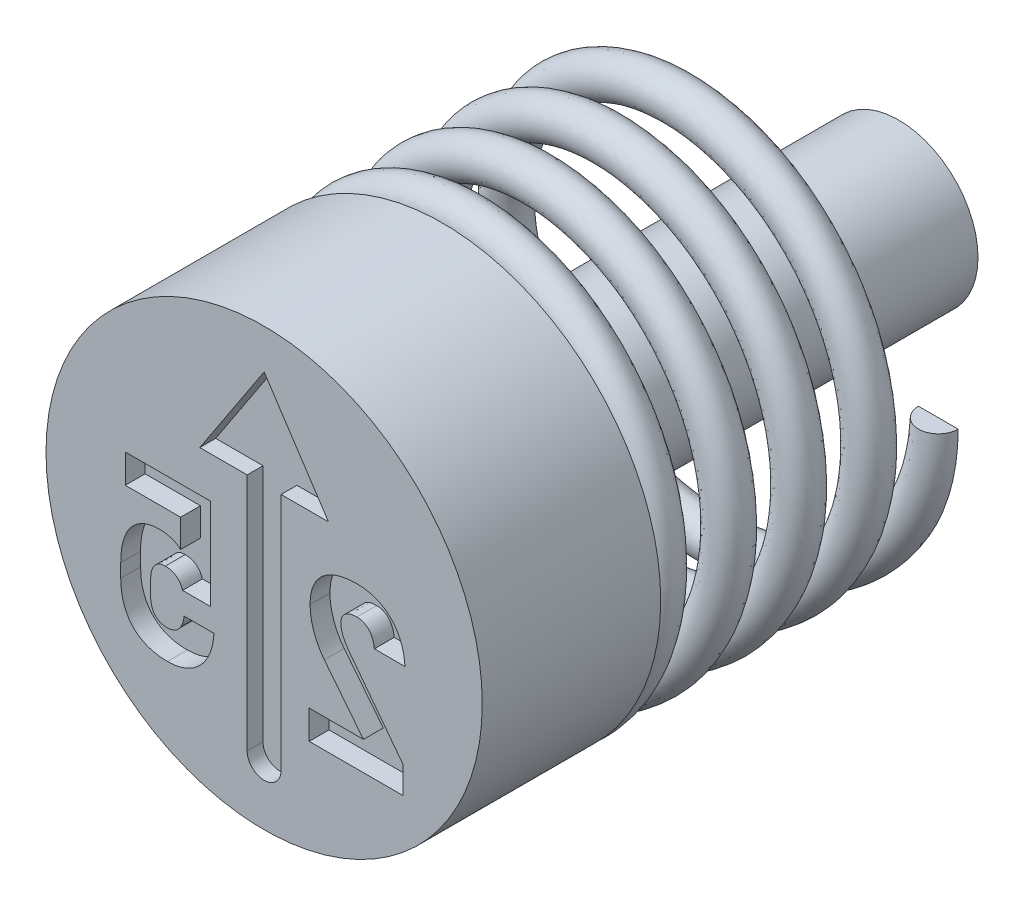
ISO-10303-21;
HEADER;
FILE_DESCRIPTION(('STEP AP214'),'2;1');
FILE_NAME('part.step','',(''),(''),'','','');
FILE_SCHEMA(('AUTOMOTIVE_DESIGN { 1 0 10303 214 1 1 1 1 }'));
ENDSEC;
DATA;
#1=APPLICATION_CONTEXT('core data for automotive mechanical design processes');
#2=APPLICATION_PROTOCOL_DEFINITION('international standard','automotive_design',2000,#1);
#3=PRODUCT_CONTEXT('',#1,'mechanical');
#4=PRODUCT('Part','Part','',(#3));
#5=PRODUCT_RELATED_PRODUCT_CATEGORY('part','',(#4));
#6=PRODUCT_DEFINITION_FORMATION('','',#4);
#7=PRODUCT_DEFINITION_CONTEXT('part definition',#1,'design');
#8=PRODUCT_DEFINITION('design','',#6,#7);
#9=PRODUCT_DEFINITION_SHAPE('','',#8);
#10=(LENGTH_UNIT() NAMED_UNIT(*) SI_UNIT(.MILLI.,.METRE.));
#11=(NAMED_UNIT(*) PLANE_ANGLE_UNIT() SI_UNIT($,.RADIAN.));
#12=(NAMED_UNIT(*) SI_UNIT($,.STERADIAN.) SOLID_ANGLE_UNIT());
#13=UNCERTAINTY_MEASURE_WITH_UNIT(LENGTH_MEASURE(1.E-05),#10,'distance_accuracy_value','');
#14=(GEOMETRIC_REPRESENTATION_CONTEXT(3) GLOBAL_UNCERTAINTY_ASSIGNED_CONTEXT((#13)) GLOBAL_UNIT_ASSIGNED_CONTEXT((#10,
#11,#12)) REPRESENTATION_CONTEXT('',''));
#15=CARTESIAN_POINT('',(0.,0.,0.));
#16=DIRECTION('',(0.,0.,1.));
#17=DIRECTION('',(1.,0.,0.));
#18=AXIS2_PLACEMENT_3D('',#15,#16,#17);
#19=CARTESIAN_POINT('',(5.,0.,-12.5));
#20=DIRECTION('',(0.,-1.,0.));
#21=DIRECTION('',(0.,0.,-1.));
#22=AXIS2_PLACEMENT_3D('',#19,#20,#21);
#23=PLANE('',#22);
#24=CARTESIAN_POINT('',(5.,0.,-12.));
#25=DIRECTION('',(0.,1.,0.));
#26=DIRECTION('',(0.,0.,1.));
#27=AXIS2_PLACEMENT_3D('',#24,#25,#26);
#28=CIRCLE('',#27,0.500000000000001);
#29=CARTESIAN_POINT('',(4.5,0.,-12.));
#30=VERTEX_POINT('',#29);
#31=CARTESIAN_POINT('',(5.5,0.,-12.));
#32=VERTEX_POINT('',#31);
#33=EDGE_CURVE('E88',#30,#32,#28,.T.);
#34=ORIENTED_EDGE('',*,*,#33,.T.);
#35=DIRECTION('',(-1.,0.,0.));
#36=VECTOR('',#35,1.);
#37=CARTESIAN_POINT('',(5.,0.,-12.));
#38=LINE('',#37,#36);
#39=EDGE_CURVE('E75',#32,#30,#38,.T.);
#40=ORIENTED_EDGE('',*,*,#39,.T.);
#41=EDGE_LOOP('',(#34,#40));
#42=FACE_BOUND('',#41,.T.);
#43=ADVANCED_FACE('F49',(#42),#23,.F.);
#44=CARTESIAN_POINT('',(-4.21831895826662E-13,-5.,-4.99999999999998));
#45=DIRECTION('',(-1.,0.,0.));
#46=DIRECTION('',(0.,-1.,0.));
#47=AXIS2_PLACEMENT_3D('',#44,#45,#46);
#48=PLANE('',#47);
#49=DIRECTION('',(0.,-1.,0.));
#50=VECTOR('',#49,1.);
#51=CARTESIAN_POINT('',(-4.21831895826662E-13,-5.,-4.5));
#52=LINE('',#51,#50);
#53=CARTESIAN_POINT('',(-3.79682048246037E-13,-4.5,-4.5));
#54=VERTEX_POINT('',#53);
#55=CARTESIAN_POINT('',(-4.63981743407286E-13,-5.5,-4.5));
#56=VERTEX_POINT('',#55);
#57=EDGE_CURVE('E69',#54,#56,#52,.T.);
#58=ORIENTED_EDGE('',*,*,#57,.F.);
#59=CARTESIAN_POINT('',(-4.21831895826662E-13,-5.,-4.49999999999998));
#60=DIRECTION('',(-1.,0.,0.));
#61=DIRECTION('',(0.,-1.,0.));
#62=AXIS2_PLACEMENT_3D('',#59,#60,#61);
#63=CIRCLE('',#62,0.500000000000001);
#64=EDGE_CURVE('E85',#54,#56,#63,.T.);
#65=ORIENTED_EDGE('',*,*,#64,.T.);
#66=EDGE_LOOP('',(#58,#65));
#67=FACE_BOUND('',#66,.T.);
#68=ADVANCED_FACE('F51',(#67),#48,.T.);
#69=CARTESIAN_POINT('',(5.,0.,-11.5));
#70=CARTESIAN_POINT('',(5.,-1.62459848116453,-11.4117647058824));
#71=CARTESIAN_POINT('',(4.04508497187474,-2.93892626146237,-11.3235294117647));
#72=CARTESIAN_POINT('',(3.09016994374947,-4.2532540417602,-11.2352941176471));
#73=CARTESIAN_POINT('',(1.54508497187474,-4.75528258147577,-11.1470588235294));
#74=CARTESIAN_POINT('',(0.,-5.25731112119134,-11.0588235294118));
#75=CARTESIAN_POINT('',(-1.54508497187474,-4.75528258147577,-10.9705882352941));
#76=CARTESIAN_POINT('',(-3.09016994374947,-4.2532540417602,-10.8823529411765));
#77=CARTESIAN_POINT('',(-4.04508497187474,-2.93892626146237,-10.7941176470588));
#78=CARTESIAN_POINT('',(-5.,-1.62459848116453,-10.7058823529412));
#79=CARTESIAN_POINT('',(-5.,0.,-10.6176470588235));
#80=CARTESIAN_POINT('',(-5.,1.62459848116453,-10.5294117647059));
#81=CARTESIAN_POINT('',(-4.04508497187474,2.93892626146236,-10.4411764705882));
#82=CARTESIAN_POINT('',(-3.09016994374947,4.2532540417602,-10.3529411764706));
#83=CARTESIAN_POINT('',(-1.54508497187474,4.75528258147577,-10.2647058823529));
#84=CARTESIAN_POINT('',(0.,5.25731112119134,-10.1764705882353));
#85=CARTESIAN_POINT('',(1.54508497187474,4.75528258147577,-10.0882352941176));
#86=CARTESIAN_POINT('',(3.09016994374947,4.2532540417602,-10.));
#87=CARTESIAN_POINT('',(4.04508497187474,2.93892626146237,-9.91176470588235));
#88=CARTESIAN_POINT('',(5.,1.62459848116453,-9.8235294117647));
#89=CARTESIAN_POINT('',(5.,0.,-9.73529411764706));
#90=CARTESIAN_POINT('',(5.,-1.62459848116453,-9.64705882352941));
#91=CARTESIAN_POINT('',(4.04508497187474,-2.93892626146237,-9.55882352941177));
#92=CARTESIAN_POINT('',(3.09016994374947,-4.2532540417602,-9.47058823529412));
#93=CARTESIAN_POINT('',(1.54508497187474,-4.75528258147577,-9.38235294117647));
#94=CARTESIAN_POINT('',(0.,-5.25731112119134,-9.29411764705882));
#95=CARTESIAN_POINT('',(-1.54508497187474,-4.75528258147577,-9.20588235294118));
#96=CARTESIAN_POINT('',(-3.09016994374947,-4.2532540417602,-9.11764705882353));
#97=CARTESIAN_POINT('',(-4.04508497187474,-2.93892626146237,-9.02941176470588));
#98=CARTESIAN_POINT('',(-5.,-1.62459848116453,-8.94117647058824));
#99=CARTESIAN_POINT('',(-5.,0.,-8.85294117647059));
#100=CARTESIAN_POINT('',(-5.,1.62459848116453,-8.76470588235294));
#101=CARTESIAN_POINT('',(-4.04508497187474,2.93892626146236,-8.67647058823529));
#102=CARTESIAN_POINT('',(-3.09016994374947,4.2532540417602,-8.58823529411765));
#103=CARTESIAN_POINT('',(-1.54508497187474,4.75528258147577,-8.5));
#104=CARTESIAN_POINT('',(0.,5.25731112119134,-8.41176470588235));
#105=CARTESIAN_POINT('',(1.54508497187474,4.75528258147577,-8.3235294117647));
#106=CARTESIAN_POINT('',(3.09016994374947,4.2532540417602,-8.23529411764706));
#107=CARTESIAN_POINT('',(4.04508497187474,2.93892626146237,-8.14705882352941));
#108=CARTESIAN_POINT('',(5.,1.62459848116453,-8.05882352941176));
#109=CARTESIAN_POINT('',(5.,0.,-7.97058823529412));
#110=CARTESIAN_POINT('',(5.,-1.62459848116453,-7.88235294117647));
#111=CARTESIAN_POINT('',(4.04508497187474,-2.93892626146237,-7.79411764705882));
#112=CARTESIAN_POINT('',(3.09016994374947,-4.2532540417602,-7.70588235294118));
#113=CARTESIAN_POINT('',(1.54508497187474,-4.75528258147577,-7.61764705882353));
#114=CARTESIAN_POINT('',(0.,-5.25731112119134,-7.52941176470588));
#115=CARTESIAN_POINT('',(-1.54508497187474,-4.75528258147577,-7.44117647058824));
#116=CARTESIAN_POINT('',(-3.09016994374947,-4.2532540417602,-7.35294117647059));
#117=CARTESIAN_POINT('',(-4.04508497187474,-2.93892626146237,-7.26470588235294));
#118=CARTESIAN_POINT('',(-5.,-1.62459848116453,-7.17647058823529));
#119=CARTESIAN_POINT('',(-5.,0.,-7.08823529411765));
#120=CARTESIAN_POINT('',(-5.,1.62459848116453,-7.));
#121=CARTESIAN_POINT('',(-4.04508497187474,2.93892626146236,-6.91176470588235));
#122=CARTESIAN_POINT('',(-3.09016994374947,4.2532540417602,-6.82352941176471));
#123=CARTESIAN_POINT('',(-1.54508497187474,4.75528258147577,-6.73529411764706));
#124=CARTESIAN_POINT('',(0.,5.25731112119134,-6.64705882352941));
#125=CARTESIAN_POINT('',(1.54508497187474,4.75528258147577,-6.55882352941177));
#126=CARTESIAN_POINT('',(3.09016994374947,4.2532540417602,-6.47058823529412));
#127=CARTESIAN_POINT('',(4.04508497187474,2.93892626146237,-6.38235294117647));
#128=CARTESIAN_POINT('',(5.,1.62459848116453,-6.29411764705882));
#129=CARTESIAN_POINT('',(5.,0.,-6.20588235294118));
#130=CARTESIAN_POINT('',(5.,-1.62459848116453,-6.11764705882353));
#131=CARTESIAN_POINT('',(4.04508497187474,-2.93892626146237,-6.02941176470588));
#132=CARTESIAN_POINT('',(3.09016994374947,-4.2532540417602,-5.94117647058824));
#133=CARTESIAN_POINT('',(1.54508497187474,-4.75528258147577,-5.85294117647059));
#134=CARTESIAN_POINT('',(0.,-5.25731112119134,-5.76470588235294));
#135=CARTESIAN_POINT('',(-1.54508497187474,-4.75528258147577,-5.6764705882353));
#136=CARTESIAN_POINT('',(-3.09016994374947,-4.2532540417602,-5.58823529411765));
#137=CARTESIAN_POINT('',(-4.04508497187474,-2.93892626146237,-5.5));
#138=CARTESIAN_POINT('',(-5.,-1.62459848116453,-5.41176470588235));
#139=CARTESIAN_POINT('',(-5.,0.,-5.32352941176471));
#140=CARTESIAN_POINT('',(-5.,1.62459848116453,-5.23529411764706));
#141=CARTESIAN_POINT('',(-4.04508497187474,2.93892626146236,-5.14705882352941));
#142=CARTESIAN_POINT('',(-3.09016994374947,4.2532540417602,-5.05882352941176));
#143=CARTESIAN_POINT('',(-1.54508497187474,4.75528258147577,-4.97058823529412));
#144=CARTESIAN_POINT('',(0.,5.25731112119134,-4.88235294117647));
#145=CARTESIAN_POINT('',(1.54508497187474,4.75528258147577,-4.79411764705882));
#146=CARTESIAN_POINT('',(3.09016994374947,4.2532540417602,-4.70588235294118));
#147=CARTESIAN_POINT('',(4.04508497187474,2.93892626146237,-4.61764705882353));
#148=CARTESIAN_POINT('',(5.,1.62459848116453,-4.52941176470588));
#149=CARTESIAN_POINT('',(5.,0.,-4.44117647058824));
#150=CARTESIAN_POINT('',(5.,-1.62459848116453,-4.35294117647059));
#151=CARTESIAN_POINT('',(4.04508497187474,-2.93892626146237,-4.26470588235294));
#152=CARTESIAN_POINT('',(3.09016994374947,-4.2532540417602,-4.1764705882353));
#153=CARTESIAN_POINT('',(1.54508497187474,-4.75528258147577,-4.08823529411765));
#154=CARTESIAN_POINT('',(0.791922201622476,-5.00000000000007,-4.04522436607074));
#155=CARTESIAN_POINT('',(-4.21831895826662E-13,-5.,-3.99999999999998));
#156=CARTESIAN_POINT('',(6.,0.,-11.5));
#157=CARTESIAN_POINT('',(6.,-1.94951817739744,-11.4117647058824));
#158=CARTESIAN_POINT('',(4.85410196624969,-3.52671151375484,-11.3235294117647));
#159=CARTESIAN_POINT('',(3.70820393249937,-5.10390485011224,-11.2352941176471));
#160=CARTESIAN_POINT('',(1.85410196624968,-5.70633909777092,-11.1470588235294));
#161=CARTESIAN_POINT('',(0.,-6.3087733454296,-11.0588235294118));
#162=CARTESIAN_POINT('',(-1.85410196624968,-5.70633909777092,-10.9705882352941));
#163=CARTESIAN_POINT('',(-3.70820393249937,-5.10390485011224,-10.8823529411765));
#164=CARTESIAN_POINT('',(-4.85410196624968,-3.52671151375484,-10.7941176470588));
#165=CARTESIAN_POINT('',(-6.,-1.94951817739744,-10.7058823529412));
#166=CARTESIAN_POINT('',(-6.,0.,-10.6176470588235));
#167=CARTESIAN_POINT('',(-6.,1.94951817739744,-10.5294117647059));
#168=CARTESIAN_POINT('',(-4.85410196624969,3.52671151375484,-10.4411764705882));
#169=CARTESIAN_POINT('',(-3.70820393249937,5.10390485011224,-10.3529411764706));
#170=CARTESIAN_POINT('',(-1.85410196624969,5.70633909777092,-10.2647058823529));
#171=CARTESIAN_POINT('',(0.,6.3087733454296,-10.1764705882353));
#172=CARTESIAN_POINT('',(1.85410196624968,5.70633909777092,-10.0882352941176));
#173=CARTESIAN_POINT('',(3.70820393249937,5.10390485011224,-10.));
#174=CARTESIAN_POINT('',(4.85410196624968,3.52671151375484,-9.91176470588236));
#175=CARTESIAN_POINT('',(6.,1.94951817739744,-9.82352941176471));
#176=CARTESIAN_POINT('',(6.,0.,-9.73529411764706));
#177=CARTESIAN_POINT('',(6.,-1.94951817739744,-9.64705882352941));
#178=CARTESIAN_POINT('',(4.85410196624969,-3.52671151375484,-9.55882352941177));
#179=CARTESIAN_POINT('',(3.70820393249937,-5.10390485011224,-9.47058823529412));
#180=CARTESIAN_POINT('',(1.85410196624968,-5.70633909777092,-9.38235294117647));
#181=CARTESIAN_POINT('',(0.,-6.3087733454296,-9.29411764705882));
#182=CARTESIAN_POINT('',(-1.85410196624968,-5.70633909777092,-9.20588235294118));
#183=CARTESIAN_POINT('',(-3.70820393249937,-5.10390485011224,-9.11764705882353));
#184=CARTESIAN_POINT('',(-4.85410196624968,-3.52671151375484,-9.02941176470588));
#185=CARTESIAN_POINT('',(-6.,-1.94951817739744,-8.94117647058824));
#186=CARTESIAN_POINT('',(-6.,0.,-8.85294117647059));
#187=CARTESIAN_POINT('',(-6.,1.94951817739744,-8.76470588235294));
#188=CARTESIAN_POINT('',(-4.85410196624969,3.52671151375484,-8.6764705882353));
#189=CARTESIAN_POINT('',(-3.70820393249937,5.10390485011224,-8.58823529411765));
#190=CARTESIAN_POINT('',(-1.85410196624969,5.70633909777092,-8.5));
#191=CARTESIAN_POINT('',(0.,6.3087733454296,-8.41176470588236));
#192=CARTESIAN_POINT('',(1.85410196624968,5.70633909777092,-8.32352941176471));
#193=CARTESIAN_POINT('',(3.70820393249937,5.10390485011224,-8.23529411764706));
#194=CARTESIAN_POINT('',(4.85410196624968,3.52671151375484,-8.14705882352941));
#195=CARTESIAN_POINT('',(6.,1.94951817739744,-8.05882352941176));
#196=CARTESIAN_POINT('',(6.,0.,-7.97058823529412));
#197=CARTESIAN_POINT('',(6.,-1.94951817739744,-7.88235294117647));
#198=CARTESIAN_POINT('',(4.85410196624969,-3.52671151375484,-7.79411764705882));
#199=CARTESIAN_POINT('',(3.70820393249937,-5.10390485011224,-7.70588235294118));
#200=CARTESIAN_POINT('',(1.85410196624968,-5.70633909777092,-7.61764705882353));
#201=CARTESIAN_POINT('',(0.,-6.3087733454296,-7.52941176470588));
#202=CARTESIAN_POINT('',(-1.85410196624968,-5.70633909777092,-7.44117647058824));
#203=CARTESIAN_POINT('',(-3.70820393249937,-5.10390485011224,-7.35294117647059));
#204=CARTESIAN_POINT('',(-4.85410196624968,-3.52671151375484,-7.26470588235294));
#205=CARTESIAN_POINT('',(-6.,-1.94951817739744,-7.1764705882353));
#206=CARTESIAN_POINT('',(-6.,0.,-7.08823529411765));
#207=CARTESIAN_POINT('',(-6.,1.94951817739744,-7.));
#208=CARTESIAN_POINT('',(-4.85410196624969,3.52671151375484,-6.91176470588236));
#209=CARTESIAN_POINT('',(-3.70820393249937,5.10390485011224,-6.82352941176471));
#210=CARTESIAN_POINT('',(-1.85410196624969,5.70633909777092,-6.73529411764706));
#211=CARTESIAN_POINT('',(0.,6.3087733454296,-6.64705882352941));
#212=CARTESIAN_POINT('',(1.85410196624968,5.70633909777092,-6.55882352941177));
#213=CARTESIAN_POINT('',(3.70820393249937,5.10390485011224,-6.47058823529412));
#214=CARTESIAN_POINT('',(4.85410196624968,3.52671151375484,-6.38235294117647));
#215=CARTESIAN_POINT('',(6.,1.94951817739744,-6.29411764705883));
#216=CARTESIAN_POINT('',(6.,0.,-6.20588235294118));
#217=CARTESIAN_POINT('',(6.,-1.94951817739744,-6.11764705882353));
#218=CARTESIAN_POINT('',(4.85410196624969,-3.52671151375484,-6.02941176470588));
#219=CARTESIAN_POINT('',(3.70820393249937,-5.10390485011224,-5.94117647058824));
#220=CARTESIAN_POINT('',(1.85410196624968,-5.70633909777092,-5.85294117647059));
#221=CARTESIAN_POINT('',(0.,-6.3087733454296,-5.76470588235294));
#222=CARTESIAN_POINT('',(-1.85410196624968,-5.70633909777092,-5.6764705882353));
#223=CARTESIAN_POINT('',(-3.70820393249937,-5.10390485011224,-5.58823529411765));
#224=CARTESIAN_POINT('',(-4.85410196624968,-3.52671151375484,-5.5));
#225=CARTESIAN_POINT('',(-6.,-1.94951817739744,-5.41176470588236));
#226=CARTESIAN_POINT('',(-6.,0.,-5.32352941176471));
#227=CARTESIAN_POINT('',(-6.,1.94951817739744,-5.23529411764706));
#228=CARTESIAN_POINT('',(-4.85410196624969,3.52671151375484,-5.14705882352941));
#229=CARTESIAN_POINT('',(-3.70820393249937,5.10390485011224,-5.05882352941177));
#230=CARTESIAN_POINT('',(-1.85410196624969,5.70633909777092,-4.97058823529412));
#231=CARTESIAN_POINT('',(0.,6.3087733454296,-4.88235294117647));
#232=CARTESIAN_POINT('',(1.85410196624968,5.70633909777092,-4.79411764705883));
#233=CARTESIAN_POINT('',(3.70820393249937,5.10390485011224,-4.70588235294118));
#234=CARTESIAN_POINT('',(4.85410196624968,3.52671151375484,-4.61764705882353));
#235=CARTESIAN_POINT('',(6.,1.94951817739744,-4.52941176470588));
#236=CARTESIAN_POINT('',(6.,0.,-4.44117647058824));
#237=CARTESIAN_POINT('',(6.,-1.94951817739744,-4.35294117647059));
#238=CARTESIAN_POINT('',(4.85410196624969,-3.52671151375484,-4.26470588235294));
#239=CARTESIAN_POINT('',(3.70820393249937,-5.10390485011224,-4.1764705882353));
#240=CARTESIAN_POINT('',(1.85410196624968,-5.70633909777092,-4.08823529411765));
#241=CARTESIAN_POINT('',(0.950306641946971,-6.00000000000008,-4.04522436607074));
#242=CARTESIAN_POINT('',(-5.06131590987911E-13,-6.,-3.99999999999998));
#243=CARTESIAN_POINT('',(6.,0.,-12.5));
#244=CARTESIAN_POINT('',(6.,-1.94951817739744,-12.4117647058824));
#245=CARTESIAN_POINT('',(4.85410196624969,-3.52671151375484,-12.3235294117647));
#246=CARTESIAN_POINT('',(3.70820393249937,-5.10390485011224,-12.2352941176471));
#247=CARTESIAN_POINT('',(1.85410196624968,-5.70633909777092,-12.1470588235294));
#248=CARTESIAN_POINT('',(0.,-6.3087733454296,-12.0588235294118));
#249=CARTESIAN_POINT('',(-1.85410196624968,-5.70633909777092,-11.9705882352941));
#250=CARTESIAN_POINT('',(-3.70820393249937,-5.10390485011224,-11.8823529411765));
#251=CARTESIAN_POINT('',(-4.85410196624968,-3.52671151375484,-11.7941176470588));
#252=CARTESIAN_POINT('',(-6.,-1.94951817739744,-11.7058823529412));
#253=CARTESIAN_POINT('',(-6.,0.,-11.6176470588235));
#254=CARTESIAN_POINT('',(-6.,1.94951817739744,-11.5294117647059));
#255=CARTESIAN_POINT('',(-4.85410196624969,3.52671151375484,-11.4411764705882));
#256=CARTESIAN_POINT('',(-3.70820393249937,5.10390485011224,-11.3529411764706));
#257=CARTESIAN_POINT('',(-1.85410196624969,5.70633909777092,-11.2647058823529));
#258=CARTESIAN_POINT('',(0.,6.3087733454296,-11.1764705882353));
#259=CARTESIAN_POINT('',(1.85410196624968,5.70633909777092,-11.0882352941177));
#260=CARTESIAN_POINT('',(3.70820393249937,5.10390485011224,-11.));
#261=CARTESIAN_POINT('',(4.85410196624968,3.52671151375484,-10.9117647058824));
#262=CARTESIAN_POINT('',(6.,1.94951817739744,-10.8235294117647));
#263=CARTESIAN_POINT('',(6.,0.,-10.7352941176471));
#264=CARTESIAN_POINT('',(6.,-1.94951817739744,-10.6470588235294));
#265=CARTESIAN_POINT('',(4.85410196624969,-3.52671151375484,-10.5588235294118));
#266=CARTESIAN_POINT('',(3.70820393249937,-5.10390485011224,-10.4705882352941));
#267=CARTESIAN_POINT('',(1.85410196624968,-5.70633909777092,-10.3823529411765));
#268=CARTESIAN_POINT('',(0.,-6.3087733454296,-10.2941176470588));
#269=CARTESIAN_POINT('',(-1.85410196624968,-5.70633909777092,-10.2058823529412));
#270=CARTESIAN_POINT('',(-3.70820393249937,-5.10390485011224,-10.1176470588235));
#271=CARTESIAN_POINT('',(-4.85410196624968,-3.52671151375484,-10.0294117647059));
#272=CARTESIAN_POINT('',(-6.,-1.94951817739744,-9.94117647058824));
#273=CARTESIAN_POINT('',(-6.,0.,-9.85294117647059));
#274=CARTESIAN_POINT('',(-6.,1.94951817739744,-9.76470588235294));
#275=CARTESIAN_POINT('',(-4.85410196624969,3.52671151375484,-9.6764705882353));
#276=CARTESIAN_POINT('',(-3.70820393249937,5.10390485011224,-9.58823529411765));
#277=CARTESIAN_POINT('',(-1.85410196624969,5.70633909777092,-9.5));
#278=CARTESIAN_POINT('',(0.,6.3087733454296,-9.41176470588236));
#279=CARTESIAN_POINT('',(1.85410196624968,5.70633909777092,-9.32352941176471));
#280=CARTESIAN_POINT('',(3.70820393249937,5.10390485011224,-9.23529411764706));
#281=CARTESIAN_POINT('',(4.85410196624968,3.52671151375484,-9.14705882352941));
#282=CARTESIAN_POINT('',(6.,1.94951817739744,-9.05882352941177));
#283=CARTESIAN_POINT('',(6.,0.,-8.97058823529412));
#284=CARTESIAN_POINT('',(6.,-1.94951817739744,-8.88235294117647));
#285=CARTESIAN_POINT('',(4.85410196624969,-3.52671151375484,-8.79411764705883));
#286=CARTESIAN_POINT('',(3.70820393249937,-5.10390485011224,-8.70588235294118));
#287=CARTESIAN_POINT('',(1.85410196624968,-5.70633909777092,-8.61764705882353));
#288=CARTESIAN_POINT('',(0.,-6.3087733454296,-8.52941176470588));
#289=CARTESIAN_POINT('',(-1.85410196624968,-5.70633909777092,-8.44117647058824));
#290=CARTESIAN_POINT('',(-3.70820393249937,-5.10390485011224,-8.35294117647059));
#291=CARTESIAN_POINT('',(-4.85410196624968,-3.52671151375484,-8.26470588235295));
#292=CARTESIAN_POINT('',(-6.,-1.94951817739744,-8.1764705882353));
#293=CARTESIAN_POINT('',(-6.,0.,-8.08823529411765));
#294=CARTESIAN_POINT('',(-6.,1.94951817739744,-8.));
#295=CARTESIAN_POINT('',(-4.85410196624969,3.52671151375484,-7.91176470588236));
#296=CARTESIAN_POINT('',(-3.70820393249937,5.10390485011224,-7.82352941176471));
#297=CARTESIAN_POINT('',(-1.85410196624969,5.70633909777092,-7.73529411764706));
#298=CARTESIAN_POINT('',(0.,6.3087733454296,-7.64705882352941));
#299=CARTESIAN_POINT('',(1.85410196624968,5.70633909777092,-7.55882352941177));
#300=CARTESIAN_POINT('',(3.70820393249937,5.10390485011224,-7.47058823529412));
#301=CARTESIAN_POINT('',(4.85410196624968,3.52671151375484,-7.38235294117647));
#302=CARTESIAN_POINT('',(6.,1.94951817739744,-7.29411764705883));
#303=CARTESIAN_POINT('',(6.,0.,-7.20588235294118));
#304=CARTESIAN_POINT('',(6.,-1.94951817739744,-7.11764705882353));
#305=CARTESIAN_POINT('',(4.85410196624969,-3.52671151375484,-7.02941176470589));
#306=CARTESIAN_POINT('',(3.70820393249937,-5.10390485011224,-6.94117647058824));
#307=CARTESIAN_POINT('',(1.85410196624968,-5.70633909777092,-6.85294117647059));
#308=CARTESIAN_POINT('',(0.,-6.3087733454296,-6.76470588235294));
#309=CARTESIAN_POINT('',(-1.85410196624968,-5.70633909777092,-6.6764705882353));
#310=CARTESIAN_POINT('',(-3.70820393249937,-5.10390485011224,-6.58823529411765));
#311=CARTESIAN_POINT('',(-4.85410196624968,-3.52671151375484,-6.5));
#312=CARTESIAN_POINT('',(-6.,-1.94951817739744,-6.41176470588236));
#313=CARTESIAN_POINT('',(-6.,0.,-6.32352941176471));
#314=CARTESIAN_POINT('',(-6.,1.94951817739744,-6.23529411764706));
#315=CARTESIAN_POINT('',(-4.85410196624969,3.52671151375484,-6.14705882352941));
#316=CARTESIAN_POINT('',(-3.70820393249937,5.10390485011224,-6.05882352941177));
#317=CARTESIAN_POINT('',(-1.85410196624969,5.70633909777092,-5.97058823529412));
#318=CARTESIAN_POINT('',(0.,6.3087733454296,-5.88235294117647));
#319=CARTESIAN_POINT('',(1.85410196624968,5.70633909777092,-5.79411764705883));
#320=CARTESIAN_POINT('',(3.70820393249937,5.10390485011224,-5.70588235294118));
#321=CARTESIAN_POINT('',(4.85410196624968,3.52671151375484,-5.61764705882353));
#322=CARTESIAN_POINT('',(6.,1.94951817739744,-5.52941176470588));
#323=CARTESIAN_POINT('',(6.,0.,-5.44117647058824));
#324=CARTESIAN_POINT('',(6.,-1.94951817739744,-5.35294117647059));
#325=CARTESIAN_POINT('',(4.85410196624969,-3.52671151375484,-5.26470588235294));
#326=CARTESIAN_POINT('',(3.70820393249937,-5.10390485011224,-5.1764705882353));
#327=CARTESIAN_POINT('',(1.85410196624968,-5.70633909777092,-5.08823529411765));
#328=CARTESIAN_POINT('',(0.950306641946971,-6.00000000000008,-5.04522436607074));
#329=CARTESIAN_POINT('',(-5.06131590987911E-13,-6.,-4.99999999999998));
#330=CARTESIAN_POINT('',(5.,0.,-12.5));
#331=CARTESIAN_POINT('',(5.,-1.62459848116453,-12.4117647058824));
#332=CARTESIAN_POINT('',(4.04508497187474,-2.93892626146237,-12.3235294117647));
#333=CARTESIAN_POINT('',(3.09016994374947,-4.2532540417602,-12.2352941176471));
#334=CARTESIAN_POINT('',(1.54508497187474,-4.75528258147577,-12.1470588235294));
#335=CARTESIAN_POINT('',(0.,-5.25731112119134,-12.0588235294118));
#336=CARTESIAN_POINT('',(-1.54508497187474,-4.75528258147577,-11.9705882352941));
#337=CARTESIAN_POINT('',(-3.09016994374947,-4.2532540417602,-11.8823529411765));
#338=CARTESIAN_POINT('',(-4.04508497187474,-2.93892626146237,-11.7941176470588));
#339=CARTESIAN_POINT('',(-5.,-1.62459848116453,-11.7058823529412));
#340=CARTESIAN_POINT('',(-5.,0.,-11.6176470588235));
#341=CARTESIAN_POINT('',(-5.,1.62459848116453,-11.5294117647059));
#342=CARTESIAN_POINT('',(-4.04508497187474,2.93892626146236,-11.4411764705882));
#343=CARTESIAN_POINT('',(-3.09016994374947,4.2532540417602,-11.3529411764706));
#344=CARTESIAN_POINT('',(-1.54508497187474,4.75528258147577,-11.2647058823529));
#345=CARTESIAN_POINT('',(0.,5.25731112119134,-11.1764705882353));
#346=CARTESIAN_POINT('',(1.54508497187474,4.75528258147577,-11.0882352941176));
#347=CARTESIAN_POINT('',(3.09016994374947,4.2532540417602,-11.));
#348=CARTESIAN_POINT('',(4.04508497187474,2.93892626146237,-10.9117647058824));
#349=CARTESIAN_POINT('',(5.,1.62459848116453,-10.8235294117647));
#350=CARTESIAN_POINT('',(5.,0.,-10.7352941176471));
#351=CARTESIAN_POINT('',(5.,-1.62459848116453,-10.6470588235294));
#352=CARTESIAN_POINT('',(4.04508497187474,-2.93892626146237,-10.5588235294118));
#353=CARTESIAN_POINT('',(3.09016994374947,-4.2532540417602,-10.4705882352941));
#354=CARTESIAN_POINT('',(1.54508497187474,-4.75528258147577,-10.3823529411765));
#355=CARTESIAN_POINT('',(0.,-5.25731112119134,-10.2941176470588));
#356=CARTESIAN_POINT('',(-1.54508497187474,-4.75528258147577,-10.2058823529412));
#357=CARTESIAN_POINT('',(-3.09016994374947,-4.2532540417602,-10.1176470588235));
#358=CARTESIAN_POINT('',(-4.04508497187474,-2.93892626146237,-10.0294117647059));
#359=CARTESIAN_POINT('',(-5.,-1.62459848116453,-9.94117647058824));
#360=CARTESIAN_POINT('',(-5.,0.,-9.85294117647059));
#361=CARTESIAN_POINT('',(-5.,1.62459848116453,-9.76470588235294));
#362=CARTESIAN_POINT('',(-4.04508497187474,2.93892626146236,-9.6764705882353));
#363=CARTESIAN_POINT('',(-3.09016994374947,4.2532540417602,-9.58823529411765));
#364=CARTESIAN_POINT('',(-1.54508497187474,4.75528258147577,-9.5));
#365=CARTESIAN_POINT('',(0.,5.25731112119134,-9.41176470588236));
#366=CARTESIAN_POINT('',(1.54508497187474,4.75528258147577,-9.32352941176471));
#367=CARTESIAN_POINT('',(3.09016994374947,4.2532540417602,-9.23529411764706));
#368=CARTESIAN_POINT('',(4.04508497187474,2.93892626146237,-9.14705882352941));
#369=CARTESIAN_POINT('',(5.,1.62459848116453,-9.05882352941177));
#370=CARTESIAN_POINT('',(5.,0.,-8.97058823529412));
#371=CARTESIAN_POINT('',(5.,-1.62459848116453,-8.88235294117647));
#372=CARTESIAN_POINT('',(4.04508497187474,-2.93892626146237,-8.79411764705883));
#373=CARTESIAN_POINT('',(3.09016994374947,-4.2532540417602,-8.70588235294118));
#374=CARTESIAN_POINT('',(1.54508497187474,-4.75528258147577,-8.61764705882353));
#375=CARTESIAN_POINT('',(0.,-5.25731112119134,-8.52941176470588));
#376=CARTESIAN_POINT('',(-1.54508497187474,-4.75528258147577,-8.44117647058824));
#377=CARTESIAN_POINT('',(-3.09016994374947,-4.2532540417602,-8.35294117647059));
#378=CARTESIAN_POINT('',(-4.04508497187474,-2.93892626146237,-8.26470588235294));
#379=CARTESIAN_POINT('',(-5.,-1.62459848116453,-8.1764705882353));
#380=CARTESIAN_POINT('',(-5.,0.,-8.08823529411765));
#381=CARTESIAN_POINT('',(-5.,1.62459848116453,-8.));
#382=CARTESIAN_POINT('',(-4.04508497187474,2.93892626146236,-7.91176470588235));
#383=CARTESIAN_POINT('',(-3.09016994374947,4.2532540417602,-7.82352941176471));
#384=CARTESIAN_POINT('',(-1.54508497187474,4.75528258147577,-7.73529411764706));
#385=CARTESIAN_POINT('',(0.,5.25731112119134,-7.64705882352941));
#386=CARTESIAN_POINT('',(1.54508497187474,4.75528258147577,-7.55882352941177));
#387=CARTESIAN_POINT('',(3.09016994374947,4.2532540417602,-7.47058823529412));
#388=CARTESIAN_POINT('',(4.04508497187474,2.93892626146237,-7.38235294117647));
#389=CARTESIAN_POINT('',(5.,1.62459848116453,-7.29411764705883));
#390=CARTESIAN_POINT('',(5.,0.,-7.20588235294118));
#391=CARTESIAN_POINT('',(5.,-1.62459848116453,-7.11764705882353));
#392=CARTESIAN_POINT('',(4.04508497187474,-2.93892626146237,-7.02941176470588));
#393=CARTESIAN_POINT('',(3.09016994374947,-4.2532540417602,-6.94117647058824));
#394=CARTESIAN_POINT('',(1.54508497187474,-4.75528258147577,-6.85294117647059));
#395=CARTESIAN_POINT('',(0.,-5.25731112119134,-6.76470588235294));
#396=CARTESIAN_POINT('',(-1.54508497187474,-4.75528258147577,-6.6764705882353));
#397=CARTESIAN_POINT('',(-3.09016994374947,-4.2532540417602,-6.58823529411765));
#398=CARTESIAN_POINT('',(-4.04508497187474,-2.93892626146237,-6.5));
#399=CARTESIAN_POINT('',(-5.,-1.62459848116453,-6.41176470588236));
#400=CARTESIAN_POINT('',(-5.,0.,-6.32352941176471));
#401=CARTESIAN_POINT('',(-5.,1.62459848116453,-6.23529411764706));
#402=CARTESIAN_POINT('',(-4.04508497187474,2.93892626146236,-6.14705882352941));
#403=CARTESIAN_POINT('',(-3.09016994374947,4.2532540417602,-6.05882352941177));
#404=CARTESIAN_POINT('',(-1.54508497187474,4.75528258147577,-5.97058823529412));
#405=CARTESIAN_POINT('',(0.,5.25731112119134,-5.88235294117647));
#406=CARTESIAN_POINT('',(1.54508497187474,4.75528258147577,-5.79411764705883));
#407=CARTESIAN_POINT('',(3.09016994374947,4.2532540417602,-5.70588235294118));
#408=CARTESIAN_POINT('',(4.04508497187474,2.93892626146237,-5.61764705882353));
#409=CARTESIAN_POINT('',(5.,1.62459848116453,-5.52941176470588));
#410=CARTESIAN_POINT('',(5.,0.,-5.44117647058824));
#411=CARTESIAN_POINT('',(5.,-1.62459848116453,-5.35294117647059));
#412=CARTESIAN_POINT('',(4.04508497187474,-2.93892626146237,-5.26470588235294));
#413=CARTESIAN_POINT('',(3.09016994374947,-4.2532540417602,-5.1764705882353));
#414=CARTESIAN_POINT('',(1.54508497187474,-4.75528258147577,-5.08823529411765));
#415=CARTESIAN_POINT('',(0.791922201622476,-5.00000000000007,-5.04522436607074));
#416=CARTESIAN_POINT('',(-4.21831895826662E-13,-5.,-4.99999999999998));
#417=CARTESIAN_POINT('',(4.,0.,-12.5));
#418=CARTESIAN_POINT('',(4.,-1.29967878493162,-12.4117647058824));
#419=CARTESIAN_POINT('',(3.23606797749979,-2.35114100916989,-12.3235294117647));
#420=CARTESIAN_POINT('',(2.47213595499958,-3.40260323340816,-12.2352941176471));
#421=CARTESIAN_POINT('',(1.23606797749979,-3.80422606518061,-12.1470588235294));
#422=CARTESIAN_POINT('',(0.,-4.20584889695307,-12.0588235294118));
#423=CARTESIAN_POINT('',(-1.23606797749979,-3.80422606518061,-11.9705882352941));
#424=CARTESIAN_POINT('',(-2.47213595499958,-3.40260323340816,-11.8823529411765));
#425=CARTESIAN_POINT('',(-3.23606797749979,-2.35114100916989,-11.7941176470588));
#426=CARTESIAN_POINT('',(-4.,-1.29967878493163,-11.7058823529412));
#427=CARTESIAN_POINT('',(-4.,0.,-11.6176470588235));
#428=CARTESIAN_POINT('',(-4.,1.29967878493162,-11.5294117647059));
#429=CARTESIAN_POINT('',(-3.23606797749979,2.35114100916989,-11.4411764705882));
#430=CARTESIAN_POINT('',(-2.47213595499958,3.40260323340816,-11.3529411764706));
#431=CARTESIAN_POINT('',(-1.23606797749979,3.80422606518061,-11.2647058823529));
#432=CARTESIAN_POINT('',(0.,4.20584889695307,-11.1764705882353));
#433=CARTESIAN_POINT('',(1.23606797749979,3.80422606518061,-11.0882352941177));
#434=CARTESIAN_POINT('',(2.47213595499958,3.40260323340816,-11.));
#435=CARTESIAN_POINT('',(3.23606797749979,2.35114100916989,-10.9117647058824));
#436=CARTESIAN_POINT('',(4.,1.29967878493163,-10.8235294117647));
#437=CARTESIAN_POINT('',(4.,0.,-10.7352941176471));
#438=CARTESIAN_POINT('',(4.,-1.29967878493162,-10.6470588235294));
#439=CARTESIAN_POINT('',(3.23606797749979,-2.35114100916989,-10.5588235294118));
#440=CARTESIAN_POINT('',(2.47213595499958,-3.40260323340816,-10.4705882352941));
#441=CARTESIAN_POINT('',(1.23606797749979,-3.80422606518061,-10.3823529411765));
#442=CARTESIAN_POINT('',(0.,-4.20584889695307,-10.2941176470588));
#443=CARTESIAN_POINT('',(-1.23606797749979,-3.80422606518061,-10.2058823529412));
#444=CARTESIAN_POINT('',(-2.47213595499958,-3.40260323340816,-10.1176470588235));
#445=CARTESIAN_POINT('',(-3.23606797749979,-2.35114100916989,-10.0294117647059));
#446=CARTESIAN_POINT('',(-4.,-1.29967878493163,-9.94117647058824));
#447=CARTESIAN_POINT('',(-4.,0.,-9.85294117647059));
#448=CARTESIAN_POINT('',(-4.,1.29967878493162,-9.76470588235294));
#449=CARTESIAN_POINT('',(-3.23606797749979,2.35114100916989,-9.6764705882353));
#450=CARTESIAN_POINT('',(-2.47213595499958,3.40260323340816,-9.58823529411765));
#451=CARTESIAN_POINT('',(-1.23606797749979,3.80422606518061,-9.5));
#452=CARTESIAN_POINT('',(0.,4.20584889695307,-9.41176470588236));
#453=CARTESIAN_POINT('',(1.23606797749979,3.80422606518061,-9.32352941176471));
#454=CARTESIAN_POINT('',(2.47213595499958,3.40260323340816,-9.23529411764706));
#455=CARTESIAN_POINT('',(3.23606797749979,2.35114100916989,-9.14705882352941));
#456=CARTESIAN_POINT('',(4.,1.29967878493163,-9.05882352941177));
#457=CARTESIAN_POINT('',(4.,0.,-8.97058823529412));
#458=CARTESIAN_POINT('',(4.,-1.29967878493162,-8.88235294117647));
#459=CARTESIAN_POINT('',(3.23606797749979,-2.35114100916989,-8.79411764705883));
#460=CARTESIAN_POINT('',(2.47213595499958,-3.40260323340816,-8.70588235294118));
#461=CARTESIAN_POINT('',(1.23606797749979,-3.80422606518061,-8.61764705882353));
#462=CARTESIAN_POINT('',(0.,-4.20584889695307,-8.52941176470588));
#463=CARTESIAN_POINT('',(-1.23606797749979,-3.80422606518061,-8.44117647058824));
#464=CARTESIAN_POINT('',(-2.47213595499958,-3.40260323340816,-8.35294117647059));
#465=CARTESIAN_POINT('',(-3.23606797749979,-2.35114100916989,-8.26470588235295));
#466=CARTESIAN_POINT('',(-4.,-1.29967878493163,-8.1764705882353));
#467=CARTESIAN_POINT('',(-4.,0.,-8.08823529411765));
#468=CARTESIAN_POINT('',(-4.,1.29967878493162,-8.));
#469=CARTESIAN_POINT('',(-3.23606797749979,2.35114100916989,-7.91176470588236));
#470=CARTESIAN_POINT('',(-2.47213595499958,3.40260323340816,-7.82352941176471));
#471=CARTESIAN_POINT('',(-1.23606797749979,3.80422606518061,-7.73529411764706));
#472=CARTESIAN_POINT('',(0.,4.20584889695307,-7.64705882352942));
#473=CARTESIAN_POINT('',(1.23606797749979,3.80422606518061,-7.55882352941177));
#474=CARTESIAN_POINT('',(2.47213595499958,3.40260323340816,-7.47058823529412));
#475=CARTESIAN_POINT('',(3.23606797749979,2.35114100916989,-7.38235294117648));
#476=CARTESIAN_POINT('',(4.,1.29967878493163,-7.29411764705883));
#477=CARTESIAN_POINT('',(4.,0.,-7.20588235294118));
#478=CARTESIAN_POINT('',(4.,-1.29967878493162,-7.11764705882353));
#479=CARTESIAN_POINT('',(3.23606797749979,-2.35114100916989,-7.02941176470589));
#480=CARTESIAN_POINT('',(2.47213595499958,-3.40260323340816,-6.94117647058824));
#481=CARTESIAN_POINT('',(1.23606797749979,-3.80422606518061,-6.85294117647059));
#482=CARTESIAN_POINT('',(0.,-4.20584889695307,-6.76470588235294));
#483=CARTESIAN_POINT('',(-1.23606797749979,-3.80422606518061,-6.6764705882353));
#484=CARTESIAN_POINT('',(-2.47213595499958,-3.40260323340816,-6.58823529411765));
#485=CARTESIAN_POINT('',(-3.23606797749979,-2.35114100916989,-6.5));
#486=CARTESIAN_POINT('',(-4.,-1.29967878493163,-6.41176470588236));
#487=CARTESIAN_POINT('',(-4.,0.,-6.32352941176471));
#488=CARTESIAN_POINT('',(-4.,1.29967878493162,-6.23529411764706));
#489=CARTESIAN_POINT('',(-3.23606797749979,2.35114100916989,-6.14705882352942));
#490=CARTESIAN_POINT('',(-2.47213595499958,3.40260323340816,-6.05882352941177));
#491=CARTESIAN_POINT('',(-1.23606797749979,3.80422606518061,-5.97058823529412));
#492=CARTESIAN_POINT('',(0.,4.20584889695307,-5.88235294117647));
#493=CARTESIAN_POINT('',(1.23606797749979,3.80422606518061,-5.79411764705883));
#494=CARTESIAN_POINT('',(2.47213595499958,3.40260323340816,-5.70588235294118));
#495=CARTESIAN_POINT('',(3.23606797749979,2.35114100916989,-5.61764705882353));
#496=CARTESIAN_POINT('',(4.,1.29967878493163,-5.52941176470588));
#497=CARTESIAN_POINT('',(4.,0.,-5.44117647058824));
#498=CARTESIAN_POINT('',(4.,-1.29967878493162,-5.35294117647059));
#499=CARTESIAN_POINT('',(3.23606797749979,-2.35114100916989,-5.26470588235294));
#500=CARTESIAN_POINT('',(2.47213595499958,-3.40260323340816,-5.1764705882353));
#501=CARTESIAN_POINT('',(1.23606797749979,-3.80422606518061,-5.08823529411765));
#502=CARTESIAN_POINT('',(0.633537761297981,-4.00000000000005,-5.04522436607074));
#503=CARTESIAN_POINT('',(-3.37296028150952E-13,-4.,-4.99999999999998));
#504=CARTESIAN_POINT('',(4.,0.,-11.5));
#505=CARTESIAN_POINT('',(4.,-1.29967878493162,-11.4117647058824));
#506=CARTESIAN_POINT('',(3.23606797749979,-2.35114100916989,-11.3235294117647));
#507=CARTESIAN_POINT('',(2.47213595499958,-3.40260323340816,-11.2352941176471));
#508=CARTESIAN_POINT('',(1.23606797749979,-3.80422606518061,-11.1470588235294));
#509=CARTESIAN_POINT('',(0.,-4.20584889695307,-11.0588235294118));
#510=CARTESIAN_POINT('',(-1.23606797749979,-3.80422606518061,-10.9705882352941));
#511=CARTESIAN_POINT('',(-2.47213595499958,-3.40260323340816,-10.8823529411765));
#512=CARTESIAN_POINT('',(-3.23606797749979,-2.35114100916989,-10.7941176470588));
#513=CARTESIAN_POINT('',(-4.,-1.29967878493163,-10.7058823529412));
#514=CARTESIAN_POINT('',(-4.,0.,-10.6176470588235));
#515=CARTESIAN_POINT('',(-4.,1.29967878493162,-10.5294117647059));
#516=CARTESIAN_POINT('',(-3.23606797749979,2.35114100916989,-10.4411764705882));
#517=CARTESIAN_POINT('',(-2.47213595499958,3.40260323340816,-10.3529411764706));
#518=CARTESIAN_POINT('',(-1.23606797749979,3.80422606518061,-10.2647058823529));
#519=CARTESIAN_POINT('',(0.,4.20584889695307,-10.1764705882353));
#520=CARTESIAN_POINT('',(1.23606797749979,3.80422606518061,-10.0882352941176));
#521=CARTESIAN_POINT('',(2.47213595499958,3.40260323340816,-10.));
#522=CARTESIAN_POINT('',(3.23606797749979,2.35114100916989,-9.91176470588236));
#523=CARTESIAN_POINT('',(4.,1.29967878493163,-9.82352941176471));
#524=CARTESIAN_POINT('',(4.,0.,-9.73529411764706));
#525=CARTESIAN_POINT('',(4.,-1.29967878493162,-9.64705882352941));
#526=CARTESIAN_POINT('',(3.23606797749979,-2.35114100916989,-9.55882352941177));
#527=CARTESIAN_POINT('',(2.47213595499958,-3.40260323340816,-9.47058823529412));
#528=CARTESIAN_POINT('',(1.23606797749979,-3.80422606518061,-9.38235294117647));
#529=CARTESIAN_POINT('',(0.,-4.20584889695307,-9.29411764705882));
#530=CARTESIAN_POINT('',(-1.23606797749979,-3.80422606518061,-9.20588235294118));
#531=CARTESIAN_POINT('',(-2.47213595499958,-3.40260323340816,-9.11764705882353));
#532=CARTESIAN_POINT('',(-3.23606797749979,-2.35114100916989,-9.02941176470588));
#533=CARTESIAN_POINT('',(-4.,-1.29967878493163,-8.94117647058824));
#534=CARTESIAN_POINT('',(-4.,0.,-8.85294117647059));
#535=CARTESIAN_POINT('',(-4.,1.29967878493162,-8.76470588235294));
#536=CARTESIAN_POINT('',(-3.23606797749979,2.35114100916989,-8.6764705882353));
#537=CARTESIAN_POINT('',(-2.47213595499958,3.40260323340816,-8.58823529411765));
#538=CARTESIAN_POINT('',(-1.23606797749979,3.80422606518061,-8.5));
#539=CARTESIAN_POINT('',(0.,4.20584889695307,-8.41176470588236));
#540=CARTESIAN_POINT('',(1.23606797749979,3.80422606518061,-8.32352941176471));
#541=CARTESIAN_POINT('',(2.47213595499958,3.40260323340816,-8.23529411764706));
#542=CARTESIAN_POINT('',(3.23606797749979,2.35114100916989,-8.14705882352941));
#543=CARTESIAN_POINT('',(4.,1.29967878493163,-8.05882352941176));
#544=CARTESIAN_POINT('',(4.,0.,-7.97058823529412));
#545=CARTESIAN_POINT('',(4.,-1.29967878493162,-7.88235294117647));
#546=CARTESIAN_POINT('',(3.23606797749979,-2.35114100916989,-7.79411764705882));
#547=CARTESIAN_POINT('',(2.47213595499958,-3.40260323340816,-7.70588235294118));
#548=CARTESIAN_POINT('',(1.23606797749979,-3.80422606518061,-7.61764705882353));
#549=CARTESIAN_POINT('',(0.,-4.20584889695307,-7.52941176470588));
#550=CARTESIAN_POINT('',(-1.23606797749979,-3.80422606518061,-7.44117647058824));
#551=CARTESIAN_POINT('',(-2.47213595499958,-3.40260323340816,-7.35294117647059));
#552=CARTESIAN_POINT('',(-3.23606797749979,-2.35114100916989,-7.26470588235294));
#553=CARTESIAN_POINT('',(-4.,-1.29967878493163,-7.1764705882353));
#554=CARTESIAN_POINT('',(-4.,0.,-7.08823529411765));
#555=CARTESIAN_POINT('',(-4.,1.29967878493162,-7.));
#556=CARTESIAN_POINT('',(-3.23606797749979,2.35114100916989,-6.91176470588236));
#557=CARTESIAN_POINT('',(-2.47213595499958,3.40260323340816,-6.82352941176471));
#558=CARTESIAN_POINT('',(-1.23606797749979,3.80422606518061,-6.73529411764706));
#559=CARTESIAN_POINT('',(0.,4.20584889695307,-6.64705882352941));
#560=CARTESIAN_POINT('',(1.23606797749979,3.80422606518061,-6.55882352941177));
#561=CARTESIAN_POINT('',(2.47213595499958,3.40260323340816,-6.47058823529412));
#562=CARTESIAN_POINT('',(3.23606797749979,2.35114100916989,-6.38235294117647));
#563=CARTESIAN_POINT('',(4.,1.29967878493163,-6.29411764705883));
#564=CARTESIAN_POINT('',(4.,0.,-6.20588235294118));
#565=CARTESIAN_POINT('',(4.,-1.29967878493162,-6.11764705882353));
#566=CARTESIAN_POINT('',(3.23606797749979,-2.35114100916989,-6.02941176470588));
#567=CARTESIAN_POINT('',(2.47213595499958,-3.40260323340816,-5.94117647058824));
#568=CARTESIAN_POINT('',(1.23606797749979,-3.80422606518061,-5.85294117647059));
#569=CARTESIAN_POINT('',(0.,-4.20584889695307,-5.76470588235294));
#570=CARTESIAN_POINT('',(-1.23606797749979,-3.80422606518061,-5.6764705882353));
#571=CARTESIAN_POINT('',(-2.47213595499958,-3.40260323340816,-5.58823529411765));
#572=CARTESIAN_POINT('',(-3.23606797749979,-2.35114100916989,-5.5));
#573=CARTESIAN_POINT('',(-4.,-1.29967878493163,-5.41176470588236));
#574=CARTESIAN_POINT('',(-4.,0.,-5.32352941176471));
#575=CARTESIAN_POINT('',(-4.,1.29967878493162,-5.23529411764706));
#576=CARTESIAN_POINT('',(-3.23606797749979,2.35114100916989,-5.14705882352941));
#577=CARTESIAN_POINT('',(-2.47213595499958,3.40260323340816,-5.05882352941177));
#578=CARTESIAN_POINT('',(-1.23606797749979,3.80422606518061,-4.97058823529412));
#579=CARTESIAN_POINT('',(0.,4.20584889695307,-4.88235294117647));
#580=CARTESIAN_POINT('',(1.23606797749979,3.80422606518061,-4.79411764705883));
#581=CARTESIAN_POINT('',(2.47213595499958,3.40260323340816,-4.70588235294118));
#582=CARTESIAN_POINT('',(3.23606797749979,2.35114100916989,-4.61764705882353));
#583=CARTESIAN_POINT('',(4.,1.29967878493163,-4.52941176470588));
#584=CARTESIAN_POINT('',(4.,0.,-4.44117647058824));
#585=CARTESIAN_POINT('',(4.,-1.29967878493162,-4.35294117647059));
#586=CARTESIAN_POINT('',(3.23606797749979,-2.35114100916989,-4.26470588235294));
#587=CARTESIAN_POINT('',(2.47213595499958,-3.40260323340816,-4.1764705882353));
#588=CARTESIAN_POINT('',(1.23606797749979,-3.80422606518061,-4.08823529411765));
#589=CARTESIAN_POINT('',(0.633537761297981,-4.00000000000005,-4.04522436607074));
#590=CARTESIAN_POINT('',(-3.37296028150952E-13,-4.,-3.99999999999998));
#591=CARTESIAN_POINT('',(5.,0.,-11.5));
#592=CARTESIAN_POINT('',(5.,-1.62459848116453,-11.4117647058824));
#593=CARTESIAN_POINT('',(4.04508497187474,-2.93892626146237,-11.3235294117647));
#594=CARTESIAN_POINT('',(3.09016994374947,-4.2532540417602,-11.2352941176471));
#595=CARTESIAN_POINT('',(1.54508497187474,-4.75528258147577,-11.1470588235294));
#596=CARTESIAN_POINT('',(0.,-5.25731112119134,-11.0588235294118));
#597=CARTESIAN_POINT('',(-1.54508497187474,-4.75528258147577,-10.9705882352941));
#598=CARTESIAN_POINT('',(-3.09016994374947,-4.2532540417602,-10.8823529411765));
#599=CARTESIAN_POINT('',(-4.04508497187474,-2.93892626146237,-10.7941176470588));
#600=CARTESIAN_POINT('',(-5.,-1.62459848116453,-10.7058823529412));
#601=CARTESIAN_POINT('',(-5.,0.,-10.6176470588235));
#602=CARTESIAN_POINT('',(-5.,1.62459848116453,-10.5294117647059));
#603=CARTESIAN_POINT('',(-4.04508497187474,2.93892626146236,-10.4411764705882));
#604=CARTESIAN_POINT('',(-3.09016994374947,4.2532540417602,-10.3529411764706));
#605=CARTESIAN_POINT('',(-1.54508497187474,4.75528258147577,-10.2647058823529));
#606=CARTESIAN_POINT('',(0.,5.25731112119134,-10.1764705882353));
#607=CARTESIAN_POINT('',(1.54508497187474,4.75528258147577,-10.0882352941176));
#608=CARTESIAN_POINT('',(3.09016994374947,4.2532540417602,-10.));
#609=CARTESIAN_POINT('',(4.04508497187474,2.93892626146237,-9.91176470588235));
#610=CARTESIAN_POINT('',(5.,1.62459848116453,-9.8235294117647));
#611=CARTESIAN_POINT('',(5.,0.,-9.73529411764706));
#612=CARTESIAN_POINT('',(5.,-1.62459848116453,-9.64705882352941));
#613=CARTESIAN_POINT('',(4.04508497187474,-2.93892626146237,-9.55882352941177));
#614=CARTESIAN_POINT('',(3.09016994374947,-4.2532540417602,-9.47058823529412));
#615=CARTESIAN_POINT('',(1.54508497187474,-4.75528258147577,-9.38235294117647));
#616=CARTESIAN_POINT('',(0.,-5.25731112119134,-9.29411764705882));
#617=CARTESIAN_POINT('',(-1.54508497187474,-4.75528258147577,-9.20588235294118));
#618=CARTESIAN_POINT('',(-3.09016994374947,-4.2532540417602,-9.11764705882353));
#619=CARTESIAN_POINT('',(-4.04508497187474,-2.93892626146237,-9.02941176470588));
#620=CARTESIAN_POINT('',(-5.,-1.62459848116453,-8.94117647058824));
#621=CARTESIAN_POINT('',(-5.,0.,-8.85294117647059));
#622=CARTESIAN_POINT('',(-5.,1.62459848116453,-8.76470588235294));
#623=CARTESIAN_POINT('',(-4.04508497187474,2.93892626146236,-8.67647058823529));
#624=CARTESIAN_POINT('',(-3.09016994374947,4.2532540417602,-8.58823529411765));
#625=CARTESIAN_POINT('',(-1.54508497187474,4.75528258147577,-8.5));
#626=CARTESIAN_POINT('',(0.,5.25731112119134,-8.41176470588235));
#627=CARTESIAN_POINT('',(1.54508497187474,4.75528258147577,-8.3235294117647));
#628=CARTESIAN_POINT('',(3.09016994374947,4.2532540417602,-8.23529411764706));
#629=CARTESIAN_POINT('',(4.04508497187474,2.93892626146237,-8.14705882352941));
#630=CARTESIAN_POINT('',(5.,1.62459848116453,-8.05882352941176));
#631=CARTESIAN_POINT('',(5.,0.,-7.97058823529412));
#632=CARTESIAN_POINT('',(5.,-1.62459848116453,-7.88235294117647));
#633=CARTESIAN_POINT('',(4.04508497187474,-2.93892626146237,-7.79411764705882));
#634=CARTESIAN_POINT('',(3.09016994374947,-4.2532540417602,-7.70588235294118));
#635=CARTESIAN_POINT('',(1.54508497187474,-4.75528258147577,-7.61764705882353));
#636=CARTESIAN_POINT('',(0.,-5.25731112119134,-7.52941176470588));
#637=CARTESIAN_POINT('',(-1.54508497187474,-4.75528258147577,-7.44117647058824));
#638=CARTESIAN_POINT('',(-3.09016994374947,-4.2532540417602,-7.35294117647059));
#639=CARTESIAN_POINT('',(-4.04508497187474,-2.93892626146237,-7.26470588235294));
#640=CARTESIAN_POINT('',(-5.,-1.62459848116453,-7.17647058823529));
#641=CARTESIAN_POINT('',(-5.,0.,-7.08823529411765));
#642=CARTESIAN_POINT('',(-5.,1.62459848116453,-7.));
#643=CARTESIAN_POINT('',(-4.04508497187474,2.93892626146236,-6.91176470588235));
#644=CARTESIAN_POINT('',(-3.09016994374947,4.2532540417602,-6.82352941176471));
#645=CARTESIAN_POINT('',(-1.54508497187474,4.75528258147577,-6.73529411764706));
#646=CARTESIAN_POINT('',(0.,5.25731112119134,-6.64705882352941));
#647=CARTESIAN_POINT('',(1.54508497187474,4.75528258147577,-6.55882352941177));
#648=CARTESIAN_POINT('',(3.09016994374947,4.2532540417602,-6.47058823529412));
#649=CARTESIAN_POINT('',(4.04508497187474,2.93892626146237,-6.38235294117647));
#650=CARTESIAN_POINT('',(5.,1.62459848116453,-6.29411764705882));
#651=CARTESIAN_POINT('',(5.,0.,-6.20588235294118));
#652=CARTESIAN_POINT('',(5.,-1.62459848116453,-6.11764705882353));
#653=CARTESIAN_POINT('',(4.04508497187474,-2.93892626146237,-6.02941176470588));
#654=CARTESIAN_POINT('',(3.09016994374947,-4.2532540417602,-5.94117647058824));
#655=CARTESIAN_POINT('',(1.54508497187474,-4.75528258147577,-5.85294117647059));
#656=CARTESIAN_POINT('',(0.,-5.25731112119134,-5.76470588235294));
#657=CARTESIAN_POINT('',(-1.54508497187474,-4.75528258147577,-5.6764705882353));
#658=CARTESIAN_POINT('',(-3.09016994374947,-4.2532540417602,-5.58823529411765));
#659=CARTESIAN_POINT('',(-4.04508497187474,-2.93892626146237,-5.5));
#660=CARTESIAN_POINT('',(-5.,-1.62459848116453,-5.41176470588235));
#661=CARTESIAN_POINT('',(-5.,0.,-5.32352941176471));
#662=CARTESIAN_POINT('',(-5.,1.62459848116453,-5.23529411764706));
#663=CARTESIAN_POINT('',(-4.04508497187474,2.93892626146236,-5.14705882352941));
#664=CARTESIAN_POINT('',(-3.09016994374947,4.2532540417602,-5.05882352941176));
#665=CARTESIAN_POINT('',(-1.54508497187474,4.75528258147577,-4.97058823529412));
#666=CARTESIAN_POINT('',(0.,5.25731112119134,-4.88235294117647));
#667=CARTESIAN_POINT('',(1.54508497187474,4.75528258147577,-4.79411764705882));
#668=CARTESIAN_POINT('',(3.09016994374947,4.2532540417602,-4.70588235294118));
#669=CARTESIAN_POINT('',(4.04508497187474,2.93892626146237,-4.61764705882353));
#670=CARTESIAN_POINT('',(5.,1.62459848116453,-4.52941176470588));
#671=CARTESIAN_POINT('',(5.,0.,-4.44117647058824));
#672=CARTESIAN_POINT('',(5.,-1.62459848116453,-4.35294117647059));
#673=CARTESIAN_POINT('',(4.04508497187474,-2.93892626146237,-4.26470588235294));
#674=CARTESIAN_POINT('',(3.09016994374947,-4.2532540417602,-4.1764705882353));
#675=CARTESIAN_POINT('',(1.54508497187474,-4.75528258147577,-4.08823529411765));
#676=CARTESIAN_POINT('',(0.791922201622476,-5.00000000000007,-4.04522436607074));
#677=CARTESIAN_POINT('',(-4.21831895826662E-13,-5.,-3.99999999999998));
#678=(BOUNDED_SURFACE() B_SPLINE_SURFACE(3,2,((#69,#70,#71,#72,#73,#74,#75,#76,#77,#78,#79,#80,
#81,#82,#83,#84,#85,#86,#87,#88,#89,#90,#91,#92,#93,#94,#95,#96,#97,#98,#99,#100,#101,#102,#103,
#104,#105,#106,#107,#108,#109,#110,#111,#112,#113,#114,#115,#116,#117,#118,#119,#120,#121,#122,
#123,#124,#125,#126,#127,#128,#129,#130,#131,#132,#133,#134,#135,#136,#137,#138,#139,#140,#141,
#142,#143,#144,#145,#146,#147,#148,#149,#150,#151,#152,#153,#154,#155),(#156,#157,#158,#159,
#160,#161,#162,#163,#164,#165,#166,#167,#168,#169,#170,#171,#172,#173,#174,#175,#176,#177,#178,
#179,#180,#181,#182,#183,#184,#185,#186,#187,#188,#189,#190,#191,#192,#193,#194,#195,#196,#197,
#198,#199,#200,#201,#202,#203,#204,#205,#206,#207,#208,#209,#210,#211,#212,#213,#214,#215,#216,
#217,#218,#219,#220,#221,#222,#223,#224,#225,#226,#227,#228,#229,#230,#231,#232,#233,#234,#235,
#236,#237,#238,#239,#240,#241,#242),(#243,#244,#245,#246,#247,#248,#249,#250,#251,#252,#253,
#254,#255,#256,#257,#258,#259,#260,#261,#262,#263,#264,#265,#266,#267,#268,#269,#270,#271,#272,
#273,#274,#275,#276,#277,#278,#279,#280,#281,#282,#283,#284,#285,#286,#287,#288,#289,#290,#291,
#292,#293,#294,#295,#296,#297,#298,#299,#300,#301,#302,#303,#304,#305,#306,#307,#308,#309,#310,
#311,#312,#313,#314,#315,#316,#317,#318,#319,#320,#321,#322,#323,#324,#325,#326,#327,#328,#329),
(#330,#331,#332,#333,#334,#335,#336,#337,#338,#339,#340,#341,#342,#343,#344,#345,#346,#347,#348,
#349,#350,#351,#352,#353,#354,#355,#356,#357,#358,#359,#360,#361,#362,#363,#364,#365,#366,#367,
#368,#369,#370,#371,#372,#373,#374,#375,#376,#377,#378,#379,#380,#381,#382,#383,#384,#385,#386,
#387,#388,#389,#390,#391,#392,#393,#394,#395,#396,#397,#398,#399,#400,#401,#402,#403,#404,#405,
#406,#407,#408,#409,#410,#411,#412,#413,#414,#415,#416),(#417,#418,#419,#420,#421,#422,#423,
#424,#425,#426,#427,#428,#429,#430,#431,#432,#433,#434,#435,#436,#437,#438,#439,#440,#441,#442,
#443,#444,#445,#446,#447,#448,#449,#450,#451,#452,#453,#454,#455,#456,#457,#458,#459,#460,#461,
#462,#463,#464,#465,#466,#467,#468,#469,#470,#471,#472,#473,#474,#475,#476,#477,#478,#479,#480,
#481,#482,#483,#484,#485,#486,#487,#488,#489,#490,#491,#492,#493,#494,#495,#496,#497,#498,#499,
#500,#501,#502,#503),(#504,#505,#506,#507,#508,#509,#510,#511,#512,#513,#514,#515,#516,#517,
#518,#519,#520,#521,#522,#523,#524,#525,#526,#527,#528,#529,#530,#531,#532,#533,#534,#535,#536,
#537,#538,#539,#540,#541,#542,#543,#544,#545,#546,#547,#548,#549,#550,#551,#552,#553,#554,#555,
#556,#557,#558,#559,#560,#561,#562,#563,#564,#565,#566,#567,#568,#569,#570,#571,#572,#573,#574,
#575,#576,#577,#578,#579,#580,#581,#582,#583,#584,#585,#586,#587,#588,#589,#590),(#591,#592,
#593,#594,#595,#596,#597,#598,#599,#600,#601,#602,#603,#604,#605,#606,#607,#608,#609,#610,#611,
#612,#613,#614,#615,#616,#617,#618,#619,#620,#621,#622,#623,#624,#625,#626,#627,#628,#629,#630,
#631,#632,#633,#634,#635,#636,#637,#638,#639,#640,#641,#642,#643,#644,#645,#646,#647,#648,#649,
#650,#651,#652,#653,#654,#655,#656,#657,#658,#659,#660,#661,#662,#663,#664,#665,#666,#667,#668,
#669,#670,#671,#672,#673,#674,#675,#676,#677)),.UNSPECIFIED.,.T.,.F.,
.F.) B_SPLINE_SURFACE_WITH_KNOTS((4,3,4),(3,2,2,2,2,2,2,2,2,2,2,2,2,2,2,2,2,2,2,2,2,2,2,2,2,2,2,
2,2,2,2,2,2,2,2,2,2,2,2,2,2,2,2,3),(0.,0.5,1.),(0.,0.02,0.04,0.06,0.08,0.1,0.12,0.14,0.16,0.18,
0.2,0.22,0.24,0.26,0.28,0.3,0.32,0.34,0.36,0.38,0.4,0.42,0.44,0.46,0.48,0.5,0.52,0.54,0.56,0.58,
0.6,0.62,0.64,0.66,0.68,0.7,0.72,0.74,0.76,0.78,0.8,0.82,0.84,0.850000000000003),
.UNSPECIFIED.) GEOMETRIC_REPRESENTATION_ITEM() RATIONAL_B_SPLINE_SURFACE(((1.,0.951056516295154,
1.,0.951056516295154,1.,0.951056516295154,1.,0.951056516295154,1.,0.951056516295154,1.,
0.951056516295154,1.,0.951056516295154,1.,0.951056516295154,1.,0.951056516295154,1.,
0.951056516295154,1.,0.951056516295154,1.,0.951056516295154,1.,0.951056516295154,1.,
0.951056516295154,1.,0.951056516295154,1.,0.951056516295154,1.,0.951056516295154,1.,
0.951056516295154,1.,0.951056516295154,1.,0.951056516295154,1.,0.951056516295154,1.,
0.951056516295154,1.,0.951056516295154,1.,0.951056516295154,1.,0.951056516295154,1.,
0.951056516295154,1.,0.951056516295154,1.,0.951056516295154,1.,0.951056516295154,1.,
0.951056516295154,1.,0.951056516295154,1.,0.951056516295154,1.,0.951056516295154,1.,
0.951056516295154,1.,0.951056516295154,1.,0.951056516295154,1.,0.951056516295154,1.,
0.951056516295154,1.,0.951056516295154,1.,0.951056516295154,1.,0.951056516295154,1.,
0.951056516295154,1.,0.97552825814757,0.975528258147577),(0.333333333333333,0.317018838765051,
0.333333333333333,0.317018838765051,0.333333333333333,0.317018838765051,0.333333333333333,
0.317018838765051,0.333333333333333,0.317018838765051,0.333333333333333,0.317018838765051,
0.333333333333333,0.317018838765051,0.333333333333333,0.317018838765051,0.333333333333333,
0.317018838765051,0.333333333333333,0.317018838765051,0.333333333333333,0.317018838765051,
0.333333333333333,0.317018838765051,0.333333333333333,0.317018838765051,0.333333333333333,
0.317018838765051,0.333333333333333,0.317018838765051,0.333333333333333,0.317018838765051,
0.333333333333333,0.317018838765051,0.333333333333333,0.317018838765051,0.333333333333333,
0.317018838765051,0.333333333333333,0.317018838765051,0.333333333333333,0.317018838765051,
0.333333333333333,0.317018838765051,0.333333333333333,0.317018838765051,0.333333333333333,
0.317018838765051,0.333333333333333,0.317018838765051,0.333333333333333,0.317018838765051,
0.333333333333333,0.317018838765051,0.333333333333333,0.317018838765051,0.333333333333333,
0.317018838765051,0.333333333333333,0.317018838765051,0.333333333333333,0.317018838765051,
0.333333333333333,0.317018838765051,0.333333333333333,0.317018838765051,0.333333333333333,
0.317018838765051,0.333333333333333,0.317018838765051,0.333333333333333,0.317018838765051,
0.333333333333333,0.317018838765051,0.333333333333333,0.317018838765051,0.333333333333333,
0.317018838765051,0.333333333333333,0.317018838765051,0.333333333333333,0.317018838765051,
0.333333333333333,0.317018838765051,0.333333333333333,0.32517608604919,0.325176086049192),
(0.333333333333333,0.317018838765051,0.333333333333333,0.317018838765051,0.333333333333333,
0.317018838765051,0.333333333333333,0.317018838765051,0.333333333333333,0.317018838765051,
0.333333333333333,0.317018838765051,0.333333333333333,0.317018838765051,0.333333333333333,
0.317018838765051,0.333333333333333,0.317018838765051,0.333333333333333,0.317018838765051,
0.333333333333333,0.317018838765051,0.333333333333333,0.317018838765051,0.333333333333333,
0.317018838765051,0.333333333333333,0.317018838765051,0.333333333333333,0.317018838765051,
0.333333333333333,0.317018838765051,0.333333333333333,0.317018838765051,0.333333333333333,
0.317018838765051,0.333333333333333,0.317018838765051,0.333333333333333,0.317018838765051,
0.333333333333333,0.317018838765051,0.333333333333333,0.317018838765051,0.333333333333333,
0.317018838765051,0.333333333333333,0.317018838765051,0.333333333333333,0.317018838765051,
0.333333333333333,0.317018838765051,0.333333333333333,0.317018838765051,0.333333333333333,
0.317018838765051,0.333333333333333,0.317018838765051,0.333333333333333,0.317018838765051,
0.333333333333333,0.317018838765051,0.333333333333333,0.317018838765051,0.333333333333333,
0.317018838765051,0.333333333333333,0.317018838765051,0.333333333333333,0.317018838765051,
0.333333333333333,0.317018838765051,0.333333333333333,0.317018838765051,0.333333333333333,
0.317018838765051,0.333333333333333,0.317018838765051,0.333333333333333,0.317018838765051,
0.333333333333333,0.317018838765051,0.333333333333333,0.317018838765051,0.333333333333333,
0.32517608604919,0.325176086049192),(1.,0.951056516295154,1.,0.951056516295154,1.,
0.951056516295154,1.,0.951056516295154,1.,0.951056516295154,1.,0.951056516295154,1.,
0.951056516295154,1.,0.951056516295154,1.,0.951056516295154,1.,0.951056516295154,1.,
0.951056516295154,1.,0.951056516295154,1.,0.951056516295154,1.,0.951056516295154,1.,
0.951056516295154,1.,0.951056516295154,1.,0.951056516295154,1.,0.951056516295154,1.,
0.951056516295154,1.,0.951056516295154,1.,0.951056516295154,1.,0.951056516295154,1.,
0.951056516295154,1.,0.951056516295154,1.,0.951056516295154,1.,0.951056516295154,1.,
0.951056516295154,1.,0.951056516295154,1.,0.951056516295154,1.,0.951056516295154,1.,
0.951056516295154,1.,0.951056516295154,1.,0.951056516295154,1.,0.951056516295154,1.,
0.951056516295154,1.,0.951056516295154,1.,0.951056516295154,1.,0.951056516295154,1.,
0.951056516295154,1.,0.951056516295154,1.,0.951056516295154,1.,0.951056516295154,1.,
0.97552825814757,0.975528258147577),(0.333333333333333,0.317018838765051,0.333333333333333,
0.317018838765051,0.333333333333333,0.317018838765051,0.333333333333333,0.317018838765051,
0.333333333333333,0.317018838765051,0.333333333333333,0.317018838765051,0.333333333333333,
0.317018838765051,0.333333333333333,0.317018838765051,0.333333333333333,0.317018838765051,
0.333333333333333,0.317018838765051,0.333333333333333,0.317018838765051,0.333333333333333,
0.317018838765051,0.333333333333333,0.317018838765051,0.333333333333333,0.317018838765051,
0.333333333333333,0.317018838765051,0.333333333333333,0.317018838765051,0.333333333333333,
0.317018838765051,0.333333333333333,0.317018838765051,0.333333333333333,0.317018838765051,
0.333333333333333,0.317018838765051,0.333333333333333,0.317018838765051,0.333333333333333,
0.317018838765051,0.333333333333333,0.317018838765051,0.333333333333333,0.317018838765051,
0.333333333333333,0.317018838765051,0.333333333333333,0.317018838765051,0.333333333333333,
0.317018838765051,0.333333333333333,0.317018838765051,0.333333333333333,0.317018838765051,
0.333333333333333,0.317018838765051,0.333333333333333,0.317018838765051,0.333333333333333,
0.317018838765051,0.333333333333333,0.317018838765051,0.333333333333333,0.317018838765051,
0.333333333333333,0.317018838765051,0.333333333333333,0.317018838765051,0.333333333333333,
0.317018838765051,0.333333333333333,0.317018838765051,0.333333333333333,0.317018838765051,
0.333333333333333,0.317018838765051,0.333333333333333,0.317018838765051,0.333333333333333,
0.317018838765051,0.333333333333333,0.32517608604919,0.325176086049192),(0.333333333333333,
0.317018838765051,0.333333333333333,0.317018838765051,0.333333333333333,0.317018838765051,
0.333333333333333,0.317018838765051,0.333333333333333,0.317018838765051,0.333333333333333,
0.317018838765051,0.333333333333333,0.317018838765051,0.333333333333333,0.317018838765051,
0.333333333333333,0.317018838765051,0.333333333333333,0.317018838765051,0.333333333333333,
0.317018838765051,0.333333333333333,0.317018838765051,0.333333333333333,0.317018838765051,
0.333333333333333,0.317018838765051,0.333333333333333,0.317018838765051,0.333333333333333,
0.317018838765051,0.333333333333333,0.317018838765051,0.333333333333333,0.317018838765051,
0.333333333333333,0.317018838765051,0.333333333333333,0.317018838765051,0.333333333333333,
0.317018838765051,0.333333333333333,0.317018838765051,0.333333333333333,0.317018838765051,
0.333333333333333,0.317018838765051,0.333333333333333,0.317018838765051,0.333333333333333,
0.317018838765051,0.333333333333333,0.317018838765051,0.333333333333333,0.317018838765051,
0.333333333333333,0.317018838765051,0.333333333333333,0.317018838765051,0.333333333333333,
0.317018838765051,0.333333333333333,0.317018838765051,0.333333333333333,0.317018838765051,
0.333333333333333,0.317018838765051,0.333333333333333,0.317018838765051,0.333333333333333,
0.317018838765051,0.333333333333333,0.317018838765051,0.333333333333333,0.317018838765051,
0.333333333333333,0.317018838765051,0.333333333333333,0.317018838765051,0.333333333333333,
0.317018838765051,0.333333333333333,0.317018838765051,0.333333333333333,0.32517608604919,
0.325176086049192),(1.,0.951056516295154,1.,0.951056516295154,1.,0.951056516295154,1.,
0.951056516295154,1.,0.951056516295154,1.,0.951056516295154,1.,0.951056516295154,1.,
0.951056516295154,1.,0.951056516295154,1.,0.951056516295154,1.,0.951056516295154,1.,
0.951056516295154,1.,0.951056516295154,1.,0.951056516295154,1.,0.951056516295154,1.,
0.951056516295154,1.,0.951056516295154,1.,0.951056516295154,1.,0.951056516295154,1.,
0.951056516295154,1.,0.951056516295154,1.,0.951056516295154,1.,0.951056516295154,1.,
0.951056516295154,1.,0.951056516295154,1.,0.951056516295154,1.,0.951056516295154,1.,
0.951056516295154,1.,0.951056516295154,1.,0.951056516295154,1.,0.951056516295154,1.,
0.951056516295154,1.,0.951056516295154,1.,0.951056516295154,1.,0.951056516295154,1.,
0.951056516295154,1.,0.951056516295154,1.,0.951056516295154,1.,0.951056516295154,1.,
0.951056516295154,1.,0.951056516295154,1.,0.951056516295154,1.,0.97552825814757,0.975528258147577))) REPRESENTATION_ITEM('') SURFACE());
#679=CARTESIAN_POINT('',(4.5,0.,-12.));
#680=CARTESIAN_POINT('',(4.50001793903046,-0.167352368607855,-12.0000000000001));
#681=CARTESIAN_POINT('',(4.49096849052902,-0.334630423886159,-12.0000000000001));
#682=CARTESIAN_POINT('',(4.45497642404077,-0.667472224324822,-11.9999999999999));
#683=CARTESIAN_POINT('',(4.42801051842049,-0.833033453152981,-11.9999999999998));
#684=CARTESIAN_POINT('',(4.33599404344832,-1.25389223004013,-11.9999999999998));
#685=CARTESIAN_POINT('',(4.25798958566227,-1.50645578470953,-11.9999999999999));
#686=CARTESIAN_POINT('',(4.06060899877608,-1.99514079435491,-12.0000000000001));
#687=CARTESIAN_POINT('',(3.94120136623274,-2.2312495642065,-12.));
#688=CARTESIAN_POINT('',(3.73380744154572,-2.56757242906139,-12.));
#689=CARTESIAN_POINT('',(3.65994773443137,-2.67672335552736,-12.));
#690=CARTESIAN_POINT('',(3.50341774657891,-2.8885563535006,-12.));
#691=CARTESIAN_POINT('',(3.42074713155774,-2.99123817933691,-12.));
#692=CARTESIAN_POINT('',(3.2472866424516,-3.18937828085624,-12.));
#693=CARTESIAN_POINT('',(3.15650156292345,-3.2848407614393,-12.));
#694=CARTESIAN_POINT('',(2.96742135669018,-3.46801584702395,-12.));
#695=CARTESIAN_POINT('',(2.86912611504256,-3.5557283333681,-12.));
#696=CARTESIAN_POINT('',(2.66372542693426,-3.72450466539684,-12.));
#697=CARTESIAN_POINT('',(2.55648487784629,-3.80540412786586,-12.));
#698=CARTESIAN_POINT('',(2.33570985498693,-3.95808006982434,-12.));
#699=CARTESIAN_POINT('',(2.2221756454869,-4.02985693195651,-12.));
#700=CARTESIAN_POINT('',(1.98946941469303,-4.16394602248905,-12.));
#701=CARTESIAN_POINT('',(1.87029142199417,-4.22624791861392,-12.));
#702=CARTESIAN_POINT('',(1.68804965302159,-4.31227483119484,-12.));
#703=CARTESIAN_POINT('',(1.6267136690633,-4.3397164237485,-12.));
#704=CARTESIAN_POINT('',(1.50297304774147,-4.39207245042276,-12.));
#705=CARTESIAN_POINT('',(1.44056845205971,-4.41698698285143,-12.));
#706=CARTESIAN_POINT('',(1.29172845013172,-4.47309114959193,-12.));
#707=CARTESIAN_POINT('',(1.20489221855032,-4.50322071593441,-12.));
#708=CARTESIAN_POINT('',(1.02978142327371,-4.55895275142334,-12.));
#709=CARTESIAN_POINT('',(0.94150683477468,-4.58455514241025,-12.));
#710=CARTESIAN_POINT('',(0.763796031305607,-4.63128584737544,-12.));
#711=CARTESIAN_POINT('',(0.674359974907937,-4.65241476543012,-12.));
#712=CARTESIAN_POINT('',(0.494689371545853,-4.69030355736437,-12.));
#713=CARTESIAN_POINT('',(0.404455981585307,-4.70706894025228,-12.));
#714=CARTESIAN_POINT('',(0.223332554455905,-4.73648876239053,-12.));
#715=CARTESIAN_POINT('',(0.132442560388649,-4.74914346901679,-12.));
#716=CARTESIAN_POINT('',(-0.0497401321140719,-4.77072317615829,-12.));
#717=CARTESIAN_POINT('',(-0.141032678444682,-4.77964948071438,-12.));
#718=CARTESIAN_POINT('',(-0.270589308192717,-4.79022331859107,-12.));
#719=CARTESIAN_POINT('',(-0.308761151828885,-4.7930816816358,-12.));
#720=CARTESIAN_POINT('',(-0.38514332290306,-4.79839630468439,-12.));
#721=CARTESIAN_POINT('',(-0.423353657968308,-4.80085245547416,-12.));
#722=CARTESIAN_POINT('',(-0.499831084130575,-4.80551205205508,-12.));
#723=CARTESIAN_POINT('',(-0.538098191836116,-4.80771522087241,-12.));
#724=CARTESIAN_POINT('',(-0.614563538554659,-4.81211845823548,-12.));
#725=CARTESIAN_POINT('',(-0.652761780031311,-4.8143185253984,-12.));
#726=CARTESIAN_POINT('',(-0.729100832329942,-4.81915062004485,-12.));
#727=CARTESIAN_POINT('',(-0.767241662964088,-4.82178222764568,-12.));
#728=CARTESIAN_POINT('',(-0.824316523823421,-4.82689181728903,-12.));
#729=CARTESIAN_POINT('',(-0.843301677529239,-4.82878647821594,-12.));
#730=CARTESIAN_POINT('',(-0.881186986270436,-4.83328044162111,-12.));
#731=CARTESIAN_POINT('',(-0.900087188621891,-4.83587928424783,-12.));
#732=CARTESIAN_POINT('',(-0.92389339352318,-4.84007912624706,-12.));
#733=CARTESIAN_POINT('',(-0.928914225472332,-4.84101766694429,-12.));
#734=CARTESIAN_POINT('',(-0.938928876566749,-4.84302977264,-12.));
#735=CARTESIAN_POINT('',(-0.943922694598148,-4.84410334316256,-12.));
#736=CARTESIAN_POINT('',(-0.958814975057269,-4.84756559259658,-12.));
#737=CARTESIAN_POINT('',(-0.968658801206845,-4.85020145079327,-12.));
#738=CARTESIAN_POINT('',(-0.985908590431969,-4.85596169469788,-12.));
#739=CARTESIAN_POINT('',(-0.993382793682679,-4.85885842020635,-12.));
#740=CARTESIAN_POINT('',(-1.00414598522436,-4.86425060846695,-12.));
#741=CARTESIAN_POINT('',(-1.00768068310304,-4.86623907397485,-12.));
#742=CARTESIAN_POINT('',(-1.01440299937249,-4.8707219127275,-12.));
#743=CARTESIAN_POINT('',(-1.01759247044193,-4.87321335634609,-12.));
#744=CARTESIAN_POINT('',(-1.02301790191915,-4.87864756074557,-12.));
#745=CARTESIAN_POINT('',(-1.02531639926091,-4.88152294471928,-12.));
#746=CARTESIAN_POINT('',(-1.02881964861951,-4.88796280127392,-12.));
#747=CARTESIAN_POINT('',(-1.03001457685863,-4.89153312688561,-12.));
#748=CARTESIAN_POINT('',(-1.03085104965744,-4.89841728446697,-12.));
#749=CARTESIAN_POINT('',(-1.03065503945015,-4.90171356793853,-12.));
#750=CARTESIAN_POINT('',(-1.02908429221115,-4.90966106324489,-12.));
#751=CARTESIAN_POINT('',(-1.02718115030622,-4.91418874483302,-12.));
#752=CARTESIAN_POINT('',(-1.02254172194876,-4.92252182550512,-12.));
#753=CARTESIAN_POINT('',(-1.01983436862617,-4.92634584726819,-12.));
#754=CARTESIAN_POINT('',(-1.01394472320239,-4.93362183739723,-12.));
#755=CARTESIAN_POINT('',(-1.01076095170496,-4.93707258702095,-12.));
#756=CARTESIAN_POINT('',(-1.00158540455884,-4.94620616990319,-12.));
#757=CARTESIAN_POINT('',(-0.995301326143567,-4.9515880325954,-12.));
#758=CARTESIAN_POINT('',(-0.982311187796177,-4.96178397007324,-12.));
#759=CARTESIAN_POINT('',(-0.975605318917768,-4.96659829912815,-12.));
#760=CARTESIAN_POINT('',(-0.961884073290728,-4.97585297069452,-12.));
#761=CARTESIAN_POINT('',(-0.954867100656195,-4.98029093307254,-12.));
#762=CARTESIAN_POINT('',(-0.940651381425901,-4.98885594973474,-12.));
#763=CARTESIAN_POINT('',(-0.933452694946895,-4.99298310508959,-12.));
#764=CARTESIAN_POINT('',(-0.909784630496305,-5.00603174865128,-12.));
#765=CARTESIAN_POINT('',(-0.893041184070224,-5.01445549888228,-12.));
#766=CARTESIAN_POINT('',(-0.859150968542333,-5.03045431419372,-12.));
#767=CARTESIAN_POINT('',(-0.842003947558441,-5.03802883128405,-12.));
#768=CARTESIAN_POINT('',(-0.790094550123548,-5.05979573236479,-12.));
#769=CARTESIAN_POINT('',(-0.754919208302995,-5.07300315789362,-12.));
#770=CARTESIAN_POINT('',(-0.683925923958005,-5.09754791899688,-12.));
#771=CARTESIAN_POINT('',(-0.648107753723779,-5.10888457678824,-12.));
#772=CARTESIAN_POINT('',(-0.576058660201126,-5.12999432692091,-12.));
#773=CARTESIAN_POINT('',(-0.539828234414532,-5.13976912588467,-11.9999999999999));
#774=CARTESIAN_POINT('',(-0.451348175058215,-5.1618852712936,-11.9999999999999));
#775=CARTESIAN_POINT('',(-0.398921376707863,-5.1735182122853,-12.));
#776=CARTESIAN_POINT('',(-0.293578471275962,-5.19433101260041,-12.));
#777=CARTESIAN_POINT('',(-0.240662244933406,-5.20351025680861,-12.));
#778=CARTESIAN_POINT('',(-0.0812811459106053,-5.22766989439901,-12.));
#779=CARTESIAN_POINT('',(0.0257120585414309,-5.23924720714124,-12.));
#780=CARTESIAN_POINT('',(0.24023903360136,-5.25414999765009,-12.));
#781=CARTESIAN_POINT('',(0.34777277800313,-5.25747587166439,-12.));
#782=CARTESIAN_POINT('',(0.562756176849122,-5.25632174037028,-12.));
#783=CARTESIAN_POINT('',(0.670205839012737,-5.25184256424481,-12.));
#784=CARTESIAN_POINT('',(1.00043542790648,-5.22649541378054,-12.));
#785=CARTESIAN_POINT('',(1.22241692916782,-5.19315056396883,-12.));
#786=CARTESIAN_POINT('',(1.55011393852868,-5.12038683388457,-12.));
#787=CARTESIAN_POINT('',(1.65854109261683,-5.09231355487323,-12.));
#788=CARTESIAN_POINT('',(1.87332492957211,-5.02901534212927,-12.));
#789=CARTESIAN_POINT('',(1.979681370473,-4.99378957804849,-11.9999999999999));
#790=CARTESIAN_POINT('',(2.21268618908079,-4.90797114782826,-11.9999999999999));
#791=CARTESIAN_POINT('',(2.33871935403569,-4.85570258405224,-12.));
#792=CARTESIAN_POINT('',(2.58617475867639,-4.74127727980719,-12.));
#793=CARTESIAN_POINT('',(2.70759792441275,-4.67912253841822,-12.));
#794=CARTESIAN_POINT('',(2.94517923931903,-4.54532648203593,-12.));
#795=CARTESIAN_POINT('',(3.06133507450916,-4.47368105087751,-12.));
#796=CARTESIAN_POINT('',(3.28762255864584,-4.32143264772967,-12.));
#797=CARTESIAN_POINT('',(3.39775257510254,-4.24082726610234,-12.));
#798=CARTESIAN_POINT('',(3.73048823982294,-3.97650271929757,-12.));
#799=CARTESIAN_POINT('',(3.94162514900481,-3.77800082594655,-12.));
#800=CARTESIAN_POINT('',(4.32828326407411,-3.34889004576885,-12.));
#801=CARTESIAN_POINT('',(4.50379555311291,-3.11827314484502,-12.));
#802=CARTESIAN_POINT('',(4.73895758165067,-2.75096701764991,-12.));
#803=CARTESIAN_POINT('',(4.81330820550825,-2.62346236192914,-12.));
#804=CARTESIAN_POINT('',(4.95118170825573,-2.36267812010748,-12.));
#805=CARTESIAN_POINT('',(5.01470387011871,-2.22939815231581,-12.));
#806=CARTESIAN_POINT('',(5.13042663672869,-1.95809555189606,-12.));
#807=CARTESIAN_POINT('',(5.18263307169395,-1.82007540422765,-12.));
#808=CARTESIAN_POINT('',(5.27542427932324,-1.54018179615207,-12.));
#809=CARTESIAN_POINT('',(5.31600720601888,-1.39830772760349,-12.));
#810=CARTESIAN_POINT('',(5.40025355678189,-1.04962126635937,-12.));
#811=CARTESIAN_POINT('',(5.43766585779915,-0.84124731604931,-12.));
#812=CARTESIAN_POINT('',(5.47506809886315,-0.526729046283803,-12.));
#813=CARTESIAN_POINT('',(5.48441614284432,-0.421602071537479,-12.));
#814=CARTESIAN_POINT('',(5.49688097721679,-0.210993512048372,-12.));
#815=CARTESIAN_POINT('',(5.49999861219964,-0.105511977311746,-12.));
#816=CARTESIAN_POINT('',(5.5,0.,-12.));
#817=B_SPLINE_CURVE_WITH_KNOTS('',3,(#679,#680,#681,#682,#683,#684,#685,#686,#687,#688,#689,
#690,#691,#692,#693,#694,#695,#696,#697,#698,#699,#700,#701,#702,#703,#704,#705,#706,#707,#708,
#709,#710,#711,#712,#713,#714,#715,#716,#717,#718,#719,#720,#721,#722,#723,#724,#725,#726,#727,
#728,#729,#730,#731,#732,#733,#734,#735,#736,#737,#738,#739,#740,#741,#742,#743,#744,#745,#746,
#747,#748,#749,#750,#751,#752,#753,#754,#755,#756,#757,#758,#759,#760,#761,#762,#763,#764,#765,
#766,#767,#768,#769,#770,#771,#772,#773,#774,#775,#776,#777,#778,#779,#780,#781,#782,#783,#784,
#785,#786,#787,#788,#789,#790,#791,#792,#793,#794,#795,#796,#797,#798,#799,#800,#801,#802,#803,
#804,#805,#806,#807,#808,#809,#810,#811,#812,#813,#814,#815,#816),.UNSPECIFIED.,.F.,.F.,(4,2,2,
2,2,2,2,2,2,2,2,2,2,2,2,2,2,2,2,2,2,2,2,2,2,2,2,2,2,2,2,2,2,2,2,2,2,2,2,2,2,2,2,2,2,2,2,2,2,2,2,
2,2,2,2,2,2,2,2,2,2,2,2,2,2,2,2,2,4),(0.,0.501670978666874,1.00399530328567,1.79311486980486,
2.58283619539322,2.97782840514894,3.3728356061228,3.76761093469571,4.16239230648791,
4.56492603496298,4.96744287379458,5.37039555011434,5.57193323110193,5.77346306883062,
6.04907695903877,6.32469560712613,6.60027701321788,6.87550878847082,7.15072265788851,
7.42584018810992,7.54067499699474,7.6555409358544,7.77053145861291,7.88531923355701,
7.99999597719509,8.05723115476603,8.1144290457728,8.12975079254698,8.14507316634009,
8.17561309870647,8.19957219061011,8.21171190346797,8.2237828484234,8.23468088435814,
8.24567502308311,8.25540819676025,8.26988982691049,8.28390313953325,8.29796090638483,
8.32272214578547,8.34747224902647,8.37236872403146,8.39725706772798,8.4534439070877,
8.50966679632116,8.62229858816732,8.73497109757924,8.84751963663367,9.00855374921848,
9.16962819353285,9.49209711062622,9.81455054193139,10.13696971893,10.8076729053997,
11.1434948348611,11.4793557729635,11.8882326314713,12.2970269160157,12.7059990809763,
13.1150814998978,13.9801760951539,14.8454869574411,15.2878590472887,15.7302604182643,
16.172433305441,16.6146763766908,17.248081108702,17.5645528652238,17.8809817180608),.UNSPECIFIED.);
#818=EDGE_CURVE('E63',#30,#32,#817,.T.);
#819=CARTESIAN_POINT('',(-3.79682048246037E-13,-4.5,-4.5));
#820=CARTESIAN_POINT('',(0.167239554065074,-4.50003557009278,-4.5));
#821=CARTESIAN_POINT('',(0.334502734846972,-4.49101505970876,-4.5));
#822=CARTESIAN_POINT('',(0.667293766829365,-4.45508991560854,-4.5));
#823=CARTESIAN_POINT('',(0.832819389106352,-4.42816462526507,-4.5));
#824=CARTESIAN_POINT('',(1.12487958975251,-4.36432621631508,-4.5));
#825=CARTESIAN_POINT('',(1.25216345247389,-4.33079326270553,-4.5));
#826=CARTESIAN_POINT('',(1.50345921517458,-4.25309391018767,-4.5));
#827=CARTESIAN_POINT('',(1.62747090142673,-4.20892681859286,-4.5));
#828=CARTESIAN_POINT('',(1.87140739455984,-4.11034346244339,-4.5));
#829=CARTESIAN_POINT('',(1.99133046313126,-4.05592290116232,-4.5));
#830=CARTESIAN_POINT('',(2.22630482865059,-3.9371968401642,-4.5));
#831=CARTESIAN_POINT('',(2.34135199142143,-3.87288315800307,-4.5));
#832=CARTESIAN_POINT('',(2.56588048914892,-3.73476268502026,-4.5));
#833=CARTESIAN_POINT('',(2.67535154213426,-3.66093918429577,-4.5));
#834=CARTESIAN_POINT('',(2.88776028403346,-3.50442500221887,-4.5));
#835=CARTESIAN_POINT('',(2.99069798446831,-3.42173433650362,-4.5));
#836=CARTESIAN_POINT('',(3.18936644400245,-3.24805418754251,-4.5));
#837=CARTESIAN_POINT('',(3.28509493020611,-3.15706210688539,-4.5));
#838=CARTESIAN_POINT('',(3.46863595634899,-2.96747262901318,-4.5));
#839=CARTESIAN_POINT('',(3.55645199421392,-2.86887862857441,-4.5));
#840=CARTESIAN_POINT('',(3.68224436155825,-2.71523925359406,-4.5));
#841=CARTESIAN_POINT('',(3.72339624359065,-2.66276320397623,-4.5));
#842=CARTESIAN_POINT('',(3.80352317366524,-2.55618767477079,-4.5));
#843=CARTESIAN_POINT('',(3.84249854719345,-2.50208843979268,-4.5));
#844=CARTESIAN_POINT('',(3.95601054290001,-2.33758388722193,-4.5));
#845=CARTESIAN_POINT('',(4.02722464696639,-2.22485960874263,-4.5));
#846=CARTESIAN_POINT('',(4.16049968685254,-1.99389572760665,-4.5));
#847=CARTESIAN_POINT('',(4.22254518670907,-1.87564725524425,-4.49999999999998));
#848=CARTESIAN_POINT('',(4.33711202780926,-1.63457863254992,-4.50000000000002));
#849=CARTESIAN_POINT('',(4.38963030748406,-1.51175702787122,-4.50000000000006));
#850=CARTESIAN_POINT('',(4.48724319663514,-1.25647063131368,-4.50000000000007));
#851=CARTESIAN_POINT('',(4.53186517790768,-1.1238251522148,-4.50000000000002));
#852=CARTESIAN_POINT('',(4.61045004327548,-0.855457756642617,-4.49999999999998));
#853=CARTESIAN_POINT('',(4.64441507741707,-0.719736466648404,-4.5));
#854=CARTESIAN_POINT('',(4.70192361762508,-0.446306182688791,-4.5));
#855=CARTESIAN_POINT('',(4.72548183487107,-0.308600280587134,-4.5));
#856=CARTESIAN_POINT('',(4.75346528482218,-0.101108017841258,-4.5));
#857=CARTESIAN_POINT('',(4.76156723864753,-0.0317917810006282,-4.5));
#858=CARTESIAN_POINT('',(4.77568361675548,0.107052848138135,-4.5));
#859=CARTESIAN_POINT('',(4.78169803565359,0.176581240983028,-4.5));
#860=CARTESIAN_POINT('',(4.78977630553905,0.284705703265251,-4.5));
#861=CARTESIAN_POINT('',(4.79240549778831,0.323261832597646,-4.5));
#862=CARTESIAN_POINT('',(4.79726661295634,0.400410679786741,-4.5));
#863=CARTESIAN_POINT('',(4.79949841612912,0.439003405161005,-4.5));
#864=CARTESIAN_POINT('',(4.80372403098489,0.51625000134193,-4.5));
#865=CARTESIAN_POINT('',(4.80571754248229,0.554903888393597,-4.5));
#866=CARTESIAN_POINT('',(4.8097275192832,0.632123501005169,-4.5));
#867=CARTESIAN_POINT('',(4.81174392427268,0.670689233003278,-4.5));
#868=CARTESIAN_POINT('',(4.81625651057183,0.747758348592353,-4.5));
#869=CARTESIAN_POINT('',(4.81875216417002,0.786261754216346,-4.5));
#870=CARTESIAN_POINT('',(4.8237455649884,0.843871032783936,-4.5));
#871=CARTESIAN_POINT('',(4.8256157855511,0.863030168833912,-4.5));
#872=CARTESIAN_POINT('',(4.83011280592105,0.901257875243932,-4.5));
#873=CARTESIAN_POINT('',(4.83273903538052,0.920326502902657,-4.5));
#874=CARTESIAN_POINT('',(4.83701608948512,0.944136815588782,-4.5));
#875=CARTESIAN_POINT('',(4.83794380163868,0.949006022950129,-4.5));
#876=CARTESIAN_POINT('',(4.83993462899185,0.958716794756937,-4.5));
#877=CARTESIAN_POINT('',(4.84099774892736,0.963558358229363,-4.5));
#878=CARTESIAN_POINT('',(4.84442838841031,0.977991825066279,-4.50000000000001));
#879=CARTESIAN_POINT('',(4.84704302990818,0.987527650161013,-4.50000000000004));
#880=CARTESIAN_POINT('',(4.85280769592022,1.00438034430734,-4.50000000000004));
#881=CARTESIAN_POINT('',(4.85574786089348,1.01176138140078,-4.50000000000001));
#882=CARTESIAN_POINT('',(4.86123859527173,1.02235668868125,-4.5));
#883=CARTESIAN_POINT('',(4.86326745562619,1.02583224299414,-4.49999999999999));
#884=CARTESIAN_POINT('',(4.86784367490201,1.03241211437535,-4.50000000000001));
#885=CARTESIAN_POINT('',(4.8703877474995,1.03551859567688,-4.50000000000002));
#886=CARTESIAN_POINT('',(4.87594356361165,1.04075924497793,-4.50000000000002));
#887=CARTESIAN_POINT('',(4.87889095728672,1.04295648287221,-4.50000000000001));
#888=CARTESIAN_POINT('',(4.88543570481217,1.04620925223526,-4.5));
#889=CARTESIAN_POINT('',(4.88903815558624,1.04725534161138,-4.5));
#890=CARTESIAN_POINT('',(4.89594797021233,1.04785882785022,-4.5));
#891=CARTESIAN_POINT('',(4.89924498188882,1.04756532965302,-4.5));
#892=CARTESIAN_POINT('',(4.90744268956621,1.04575084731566,-4.5));
#893=CARTESIAN_POINT('',(4.91218810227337,1.04362630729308,-4.5));
#894=CARTESIAN_POINT('',(4.92101363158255,1.03847170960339,-4.5));
#895=CARTESIAN_POINT('',(4.92509910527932,1.03544957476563,-4.5));
#896=CARTESIAN_POINT('',(4.93286320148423,1.02890504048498,-4.5));
#897=CARTESIAN_POINT('',(4.9365404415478,1.02538102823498,-4.5));
#898=CARTESIAN_POINT('',(4.94641971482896,1.01509228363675,-4.50000000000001));
#899=CARTESIAN_POINT('',(4.95227316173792,1.00800105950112,-4.5));
#900=CARTESIAN_POINT('',(4.96336425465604,0.993346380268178,-4.5));
#901=CARTESIAN_POINT('',(4.96860041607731,0.985781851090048,-4.5));
#902=CARTESIAN_POINT('',(4.97865039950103,0.970326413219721,-4.5));
#903=CARTESIAN_POINT('',(4.98346204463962,0.96243409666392,-4.5));
#904=CARTESIAN_POINT('',(4.99273602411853,0.946462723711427,-4.5));
#905=CARTESIAN_POINT('',(4.99719879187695,0.938383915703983,-4.5));
#906=CARTESIAN_POINT('',(5.01126496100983,0.911893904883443,-4.5));
#907=CARTESIAN_POINT('',(5.02032015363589,0.893191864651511,-4.5));
#908=CARTESIAN_POINT('',(5.03748526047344,0.855356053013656,-4.5));
#909=CARTESIAN_POINT('',(5.04559458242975,0.836222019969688,-4.5));
#910=CARTESIAN_POINT('',(5.06884983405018,0.778299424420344,-4.5));
#911=CARTESIAN_POINT('',(5.08288618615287,0.739065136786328,-4.50000000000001));
#912=CARTESIAN_POINT('',(5.10881054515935,0.659903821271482,-4.49999999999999));
#913=CARTESIAN_POINT('',(5.12069809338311,0.619976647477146,-4.49999999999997));
#914=CARTESIAN_POINT('',(5.14265589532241,0.539680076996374,-4.50000000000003));
#915=CARTESIAN_POINT('',(5.15272833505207,0.499311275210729,-4.50000000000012));
#916=CARTESIAN_POINT('',(5.17456895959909,0.403838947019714,-4.50000000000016));
#917=CARTESIAN_POINT('',(5.185673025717,0.348583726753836,-4.50000000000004));
#918=CARTESIAN_POINT('',(5.20526429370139,0.237603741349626,-4.49999999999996));
#919=CARTESIAN_POINT('',(5.21375089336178,0.181878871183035,-4.49999999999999));
#920=CARTESIAN_POINT('',(5.22826605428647,0.0700329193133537,-4.50000000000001));
#921=CARTESIAN_POINT('',(5.23429118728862,0.0139113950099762,-4.5));
#922=CARTESIAN_POINT('',(5.24409767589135,-0.0985184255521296,-4.5));
#923=CARTESIAN_POINT('',(5.24787914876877,-0.154826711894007,-4.5));
#924=CARTESIAN_POINT('',(5.25597963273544,-0.323943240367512,-4.5));
#925=CARTESIAN_POINT('',(5.2570524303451,-0.436924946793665,-4.5));
#926=CARTESIAN_POINT('',(5.25089844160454,-0.662553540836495,-4.5));
#927=CARTESIAN_POINT('',(5.24367659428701,-0.775200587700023,-4.5));
#928=CARTESIAN_POINT('',(5.20924865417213,-1.11913895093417,-4.5));
#929=CARTESIAN_POINT('',(5.16895896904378,-1.34924049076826,-4.49999999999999));
#930=CARTESIAN_POINT('',(5.05622135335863,-1.80124262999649,-4.50000000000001));
#931=CARTESIAN_POINT('',(4.98378599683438,-2.02314639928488,-4.50000000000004));
#932=CARTESIAN_POINT('',(4.84477798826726,-2.36625287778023,-4.50000000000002));
#933=CARTESIAN_POINT('',(4.78794525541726,-2.49149067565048,-4.50000000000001));
#934=CARTESIAN_POINT('',(4.66429491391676,-2.73697759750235,-4.49999999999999));
#935=CARTESIAN_POINT('',(4.5974761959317,-2.85722616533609,-4.5));
#936=CARTESIAN_POINT('',(4.45430599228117,-3.09201676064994,-4.5));
#937=CARTESIAN_POINT('',(4.37794747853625,-3.20655449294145,-4.5));
#938=CARTESIAN_POINT('',(4.21646944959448,-3.42927638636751,-4.5));
#939=CARTESIAN_POINT('',(4.13134970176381,-3.5374603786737,-4.5));
#940=CARTESIAN_POINT('',(3.94847202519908,-3.75197578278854,-4.5));
#941=CARTESIAN_POINT('',(3.85029787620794,-3.85795280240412,-4.5));
#942=CARTESIAN_POINT('',(3.64556642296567,-4.0614720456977,-4.5));
#943=CARTESIAN_POINT('',(3.53900901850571,-4.1590141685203,-4.5));
#944=CARTESIAN_POINT('',(3.31826898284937,-4.34499964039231,-4.5));
#945=CARTESIAN_POINT('',(3.20408806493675,-4.43344502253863,-4.5));
#946=CARTESIAN_POINT('',(2.96882794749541,-4.60071290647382,-4.5));
#947=CARTESIAN_POINT('',(2.84774632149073,-4.67953199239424,-4.5));
#948=CARTESIAN_POINT('',(2.59633549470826,-4.8289079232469,-4.5));
#949=CARTESIAN_POINT('',(2.46584851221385,-4.89919999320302,-4.5));
#950=CARTESIAN_POINT('',(2.19944337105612,-5.02863712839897,-4.5));
#951=CARTESIAN_POINT('',(2.06352285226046,-5.08777728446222,-4.5));
#952=CARTESIAN_POINT('',(1.64921581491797,-5.24777913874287,-4.5));
#953=CARTESIAN_POINT('',(1.36389405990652,-5.33145305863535,-4.5));
#954=CARTESIAN_POINT('',(0.897156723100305,-5.42722207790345,-4.5));
#955=CARTESIAN_POINT('',(0.718653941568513,-5.45450816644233,-4.5));
#956=CARTESIAN_POINT('',(0.360138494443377,-5.49088670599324,-4.5));
#957=CARTESIAN_POINT('',(0.180129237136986,-5.5000127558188,-4.5));
#958=CARTESIAN_POINT('',(-4.63981743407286E-13,-5.5,-4.5));
#959=B_SPLINE_CURVE_WITH_KNOTS('',3,(#819,#820,#821,#822,#823,#824,#825,#826,#827,#828,#829,
#830,#831,#832,#833,#834,#835,#836,#837,#838,#839,#840,#841,#842,#843,#844,#845,#846,#847,#848,
#849,#850,#851,#852,#853,#854,#855,#856,#857,#858,#859,#860,#861,#862,#863,#864,#865,#866,#867,
#868,#869,#870,#871,#872,#873,#874,#875,#876,#877,#878,#879,#880,#881,#882,#883,#884,#885,#886,
#887,#888,#889,#890,#891,#892,#893,#894,#895,#896,#897,#898,#899,#900,#901,#902,#903,#904,#905,
#906,#907,#908,#909,#910,#911,#912,#913,#914,#915,#916,#917,#918,#919,#920,#921,#922,#923,#924,
#925,#926,#927,#928,#929,#930,#931,#932,#933,#934,#935,#936,#937,#938,#939,#940,#941,#942,#943,
#944,#945,#946,#947,#948,#949,#950,#951,#952,#953,#954,#955,#956,#957,#958),.UNSPECIFIED.,.F.,
.F.,(4,2,2,2,2,2,2,2,2,2,2,2,2,2,2,2,2,2,2,2,2,2,2,2,2,2,2,2,2,2,2,2,2,2,2,2,2,2,2,2,2,2,2,2,2,
2,2,2,2,2,2,2,2,2,2,2,2,2,2,2,2,2,2,2,2,2,2,2,2,4),(0.,0.501526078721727,1.00363177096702,
1.39806058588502,1.79251510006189,2.18713527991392,2.58208361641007,2.97773564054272,
3.37338696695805,3.76916251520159,4.16476223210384,4.36477524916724,4.56475827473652,
4.96429128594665,5.36448945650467,5.76481600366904,6.18420671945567,6.60351276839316,
7.02222417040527,7.231559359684,7.44089508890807,7.55683042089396,7.67280062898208,
7.78891542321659,7.90477415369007,8.02050603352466,8.0782531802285,8.13595687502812,
8.15082556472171,8.16569477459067,8.19532650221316,8.21906573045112,8.23110932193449,
8.24307838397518,8.2539489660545,8.26490806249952,8.27467899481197,8.29001111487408,
8.30521173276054,8.32046234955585,8.34798118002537,8.37556489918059,8.4032827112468,
8.43096552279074,8.49325610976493,8.55558549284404,8.68049361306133,8.80542836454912,
8.93021163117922,9.09921805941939,9.26826334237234,9.43754327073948,9.60681435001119,
9.94541140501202,10.2838069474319,10.9819756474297,11.6798714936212,12.092057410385,
12.5042891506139,12.9168263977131,13.3293746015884,13.7622653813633,14.1951613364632,
14.627960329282,15.0609124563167,15.5050046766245,15.949291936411,16.8365237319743,
17.3774454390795,17.9173654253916),.UNSPECIFIED.);
#960=EDGE_CURVE('E12',#54,#56,#959,.T.);
#961=ORIENTED_EDGE('',*,*,#33,.F.);
#962=ORIENTED_EDGE('',*,*,#818,.T.);
#963=EDGE_LOOP('',(#961,#962));
#964=FACE_BOUND('',#963,.T.);
#965=ORIENTED_EDGE('',*,*,#64,.F.);
#966=ORIENTED_EDGE('',*,*,#960,.T.);
#967=EDGE_LOOP('',(#965,#966));
#968=FACE_BOUND('',#967,.T.);
#969=ADVANCED_FACE('F87',(#964,#968),#678,.F.);
#970=CARTESIAN_POINT('',(-6.59534880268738,-5.78304223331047,-12.));
#971=DIRECTION('',(0.,0.,1.));
#972=DIRECTION('',(1.,0.,0.));
#973=AXIS2_PLACEMENT_3D('',#970,#971,#972);
#974=PLANE('',#973);
#975=ORIENTED_EDGE('',*,*,#818,.F.);
#976=ORIENTED_EDGE('',*,*,#39,.F.);
#977=EDGE_LOOP('',(#975,#976));
#978=FACE_BOUND('',#977,.T.);
#979=ADVANCED_FACE('F101',(#978),#974,.F.);
#980=CARTESIAN_POINT('',(5.5,-5.78304223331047,-4.5));
#981=DIRECTION('',(0.,0.,-1.));
#982=DIRECTION('',(-1.,0.,0.));
#983=AXIS2_PLACEMENT_3D('',#980,#981,#982);
#984=PLANE('',#983);
#985=ORIENTED_EDGE('',*,*,#57,.T.);
#986=ORIENTED_EDGE('',*,*,#960,.F.);
#987=EDGE_LOOP('',(#985,#986));
#988=FACE_BOUND('',#987,.T.);
#989=ADVANCED_FACE('F80',(#988),#984,.F.);
#990=CLOSED_SHELL('',(#43,#68,#969,#979,#989));
#991=MANIFOLD_SOLID_BREP('B2',#990);
#992=CARTESIAN_POINT('',(0.,0.,0.));
#993=DIRECTION('',(0.,0.,1.));
#994=DIRECTION('',(1.,0.,0.));
#995=AXIS2_PLACEMENT_3D('',#992,#993,#994);
#996=PLANE('',#995);
#997=CARTESIAN_POINT('',(-3.61588750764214,-1.81393927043,0.));
#998=CARTESIAN_POINT('',(-3.61410184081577,-1.87623805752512,0.));
#999=CARTESIAN_POINT('',(-3.61064741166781,-1.99675703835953,0.));
#1000=CARTESIAN_POINT('',(-3.58594462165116,-2.17103615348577,0.));
#1001=CARTESIAN_POINT('',(-3.54141247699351,-2.33090085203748,0.));
#1002=CARTESIAN_POINT('',(-3.48174596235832,-2.47738467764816,0.));
#1003=CARTESIAN_POINT('',(-3.4038339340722,-2.60757673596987,0.));
#1004=CARTESIAN_POINT('',(-3.31053890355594,-2.72257681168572,0.));
#1005=CARTESIAN_POINT('',(-3.20015832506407,-2.8197296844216,0.));
#1006=CARTESIAN_POINT('',(-3.07529724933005,-2.90149203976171,0.));
#1007=CARTESIAN_POINT('',(-2.9347676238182,-2.96419807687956,0.));
#1008=CARTESIAN_POINT('',(-2.78081511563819,-3.00975196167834,0.));
#1009=CARTESIAN_POINT('',(-2.612830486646,-3.03684762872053,0.));
#1010=CARTESIAN_POINT('',(-2.49650049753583,-3.03996257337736,0.));
#1011=CARTESIAN_POINT('',(-2.43634807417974,-3.04157326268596,0.));
#1012=B_SPLINE_CURVE_WITH_KNOTS('',3,(#997,#998,#999,#1000,#1001,#1002,#1003,#1004,#1005,#1006,
#1007,#1008,#1009,#1010,#1011),.UNSPECIFIED.,.F.,.F.,(4,1,1,1,1,1,1,1,1,1,1,1,4),(0.,
0.0965919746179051,0.1868602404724,0.272108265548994,0.35332451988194,0.431359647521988,
0.506505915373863,0.582010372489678,0.6584354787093,0.737063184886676,0.819709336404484,
0.906774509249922,1.),.UNSPECIFIED.);
#1013=CARTESIAN_POINT('',(-3.61588750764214,-1.81393927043,0.));
#1014=VERTEX_POINT('',#1013);
#1015=CARTESIAN_POINT('',(-2.43634807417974,-3.04157326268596,0.));
#1016=VERTEX_POINT('',#1015);
#1017=EDGE_CURVE('E166',#1014,#1016,#1012,.T.);
#1018=ORIENTED_EDGE('',*,*,#1017,.F.);
#1019=DIRECTION('',(0.,-1.,0.));
#1020=VECTOR('',#1019,1.);
#1021=CARTESIAN_POINT('',(-3.61588750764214,-1.47890768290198,0.));
#1022=LINE('',#1021,#1020);
#1023=CARTESIAN_POINT('',(-3.61588750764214,-1.47890768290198,0.));
#1024=VERTEX_POINT('',#1023);
#1025=EDGE_CURVE('E447',#1024,#1014,#1022,.T.);
#1026=ORIENTED_EDGE('',*,*,#1025,.F.);
#1027=CARTESIAN_POINT('',(-2.63117179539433,-0.254534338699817,0.));
#1028=CARTESIAN_POINT('',(-2.68130309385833,-0.25612151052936,0.));
#1029=CARTESIAN_POINT('',(-2.77853184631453,-0.259199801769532,0.));
#1030=CARTESIAN_POINT('',(-2.91877640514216,-0.286889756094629,0.));
#1031=CARTESIAN_POINT('',(-3.04802479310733,-0.331251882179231,0.));
#1032=CARTESIAN_POINT('',(-3.16521049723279,-0.395164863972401,0.));
#1033=CARTESIAN_POINT('',(-3.270466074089,-0.47527010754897,0.));
#1034=CARTESIAN_POINT('',(-3.36188848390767,-0.573152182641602,0.));
#1035=CARTESIAN_POINT('',(-3.44004764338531,-0.687215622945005,0.));
#1036=CARTESIAN_POINT('',(-3.50401421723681,-0.817536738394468,0.));
#1037=CARTESIAN_POINT('',(-3.55435860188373,-0.96297354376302,0.));
#1038=CARTESIAN_POINT('',(-3.59092523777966,-1.12251048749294,0.));
#1039=CARTESIAN_POINT('',(-3.61176372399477,-1.29630240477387,0.));
#1040=CARTESIAN_POINT('',(-3.61448102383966,-1.41662716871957,0.));
#1041=CARTESIAN_POINT('',(-3.61588750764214,-1.47890768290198,0.));
#1042=B_SPLINE_CURVE_WITH_KNOTS('',3,(#1027,#1028,#1029,#1030,#1031,#1032,#1033,#1034,#1035,
#1036,#1037,#1038,#1039,#1040,#1041),.UNSPECIFIED.,.F.,.F.,(4,1,1,1,1,1,1,1,1,1,1,1,4),(0.,
0.084394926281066,0.163682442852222,0.239848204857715,0.313806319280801,0.3876154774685,
0.461788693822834,0.538496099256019,0.61978489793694,0.70565234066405,0.797279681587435,
0.895071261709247,1.),.UNSPECIFIED.);
#1043=CARTESIAN_POINT('',(-2.63117179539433,-0.254534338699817,0.));
#1044=VERTEX_POINT('',#1043);
#1045=EDGE_CURVE('E450',#1044,#1024,#1042,.T.);
#1046=ORIENTED_EDGE('',*,*,#1045,.F.);
#1047=CARTESIAN_POINT('',(-2.10620745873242,-0.433054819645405,0.));
#1048=CARTESIAN_POINT('',(-2.12138349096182,-0.419616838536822,0.));
#1049=CARTESIAN_POINT('',(-2.15260177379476,-0.391973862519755,0.));
#1050=CARTESIAN_POINT('',(-2.20718031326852,-0.356874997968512,0.));
#1051=CARTESIAN_POINT('',(-2.2696014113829,-0.327064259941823,0.));
#1052=CARTESIAN_POINT('',(-2.36170953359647,-0.292730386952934,0.));
#1053=CARTESIAN_POINT('',(-2.48287379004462,-0.262199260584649,0.));
#1054=CARTESIAN_POINT('',(-2.58234116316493,-0.257058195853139,0.));
#1055=CARTESIAN_POINT('',(-2.63117179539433,-0.254534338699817,0.));
#1056=B_SPLINE_CURVE_WITH_KNOTS('',3,(#1047,#1048,#1049,#1050,#1051,#1052,#1053,#1054,#1055),
.UNSPECIFIED.,.F.,.F.,(4,1,1,1,1,1,4),(0.,0.107291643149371,0.220707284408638,0.342410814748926,
0.47317918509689,0.74137254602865,1.),.UNSPECIFIED.);
#1057=CARTESIAN_POINT('',(-2.10620745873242,-0.433054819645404,0.));
#1058=VERTEX_POINT('',#1057);
#1059=EDGE_CURVE('E1262',#1058,#1044,#1056,.T.);
#1060=ORIENTED_EDGE('',*,*,#1059,.F.);
#1061=DIRECTION('',(0.,-1.,0.));
#1062=VECTOR('',#1061,1.);
#1063=CARTESIAN_POINT('',(-2.10620745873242,0.273690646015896,0.));
#1064=LINE('',#1063,#1062);
#1065=CARTESIAN_POINT('',(-2.10620745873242,0.273690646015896,0.));
#1066=VERTEX_POINT('',#1065);
#1067=EDGE_CURVE('E1259',#1066,#1058,#1064,.T.);
#1068=ORIENTED_EDGE('',*,*,#1067,.F.);
#1069=DIRECTION('',(1.,0.,0.));
#1070=VECTOR('',#1069,1.);
#1071=CARTESIAN_POINT('',(-3.50094966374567,0.273690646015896,0.));
#1072=LINE('',#1071,#1070);
#1073=CARTESIAN_POINT('',(-3.50094966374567,0.273690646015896,0.));
#1074=VERTEX_POINT('',#1073);
#1075=EDGE_CURVE('E1256',#1074,#1066,#1072,.T.);
#1076=ORIENTED_EDGE('',*,*,#1075,.F.);
#1077=DIRECTION('',(0.,-1.,0.));
#1078=VECTOR('',#1077,1.);
#1079=CARTESIAN_POINT('',(-3.50094966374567,1.,0.));
#1080=LINE('',#1079,#1078);
#1081=CARTESIAN_POINT('',(-3.50094966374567,1.,0.));
#1082=VERTEX_POINT('',#1081);
#1083=EDGE_CURVE('E1253',#1082,#1074,#1080,.T.);
#1084=ORIENTED_EDGE('',*,*,#1083,.F.);
#1085=DIRECTION('',(-1.,0.,0.));
#1086=VECTOR('',#1085,1.);
#1087=CARTESIAN_POINT('',(-1.35218259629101,1.,0.));
#1088=LINE('',#1087,#1086);
#1089=CARTESIAN_POINT('',(-1.35218259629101,1.,0.));
#1090=VERTEX_POINT('',#1089);
#1091=EDGE_CURVE('E1250',#1090,#1082,#1088,.T.);
#1092=ORIENTED_EDGE('',*,*,#1091,.F.);
#1093=DIRECTION('',(0.,1.,0.));
#1094=VECTOR('',#1093,1.);
#1095=CARTESIAN_POINT('',(-1.35218259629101,-1.29957203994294,0.));
#1096=LINE('',#1095,#1094);
#1097=CARTESIAN_POINT('',(-1.35218259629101,-1.29957203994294,0.));
#1098=VERTEX_POINT('',#1097);
#1099=EDGE_CURVE('E1247',#1098,#1090,#1096,.T.);
#1100=ORIENTED_EDGE('',*,*,#1099,.F.);
#1101=DIRECTION('',(1.,0.,0.));
#1102=VECTOR('',#1101,1.);
#1103=CARTESIAN_POINT('',(-2.05648257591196,-1.29957203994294,0.));
#1104=LINE('',#1103,#1102);
#1105=CARTESIAN_POINT('',(-2.05648257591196,-1.29957203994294,0.));
#1106=VERTEX_POINT('',#1105);
#1107=EDGE_CURVE('E1241',#1106,#1098,#1104,.T.);
#1108=ORIENTED_EDGE('',*,*,#1107,.F.);
#1109=CARTESIAN_POINT('',(-2.4909639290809,-0.985734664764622,0.));
#1110=CARTESIAN_POINT('',(-2.4647932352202,-0.986532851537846,0.));
#1111=CARTESIAN_POINT('',(-2.41412773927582,-0.988078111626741,0.));
#1112=CARTESIAN_POINT('',(-2.34117735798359,-1.00407847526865,0.));
#1113=CARTESIAN_POINT('',(-2.27412875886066,-1.03025714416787,0.));
#1114=CARTESIAN_POINT('',(-2.21374307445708,-1.06726958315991,0.));
#1115=CARTESIAN_POINT('',(-2.16040934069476,-1.11263285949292,0.));
#1116=CARTESIAN_POINT('',(-2.11649895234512,-1.16744624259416,0.));
#1117=CARTESIAN_POINT('',(-2.07968950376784,-1.22938233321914,0.));
#1118=CARTESIAN_POINT('',(-2.06433061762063,-1.27583551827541,0.));
#1119=CARTESIAN_POINT('',(-2.05648257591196,-1.29957203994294,0.));
#1120=B_SPLINE_CURVE_WITH_KNOTS('',3,(#1109,#1110,#1111,#1112,#1113,#1114,#1115,#1116,#1117,
#1118,#1119),.UNSPECIFIED.,.F.,.F.,(4,1,1,1,1,1,1,1,4),(0.,0.135635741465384,0.262585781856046,
0.385395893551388,0.507524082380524,0.628507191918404,0.746772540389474,0.870606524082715,1.),.UNSPECIFIED.);
#1121=CARTESIAN_POINT('',(-2.4909639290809,-0.985734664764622,0.));
#1122=VERTEX_POINT('',#1121);
#1123=EDGE_CURVE('E1233',#1122,#1106,#1120,.T.);
#1124=ORIENTED_EDGE('',*,*,#1123,.F.);
#1125=CARTESIAN_POINT('',(-2.86267780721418,-1.47890768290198,0.));
#1126=CARTESIAN_POINT('',(-2.86187275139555,-1.44158258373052,0.));
#1127=CARTESIAN_POINT('',(-2.86034487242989,-1.37074496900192,0.));
#1128=CARTESIAN_POINT('',(-2.84133811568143,-1.27165369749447,0.));
#1129=CARTESIAN_POINT('',(-2.8117863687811,-1.18519992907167,0.));
#1130=CARTESIAN_POINT('',(-2.76814255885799,-1.11343199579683,0.));
#1131=CARTESIAN_POINT('',(-2.71388881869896,-1.05550412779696,0.));
#1132=CARTESIAN_POINT('',(-2.64823508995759,-1.01436152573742,0.));
#1133=CARTESIAN_POINT('',(-2.57250005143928,-0.990062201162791,0.));
#1134=CARTESIAN_POINT('',(-2.51886237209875,-0.987215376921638,0.));
#1135=CARTESIAN_POINT('',(-2.4909639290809,-0.985734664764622,0.));
#1136=B_SPLINE_CURVE_WITH_KNOTS('',3,(#1125,#1126,#1127,#1128,#1129,#1130,#1131,#1132,#1133,
#1134,#1135),.UNSPECIFIED.,.F.,.F.,(4,1,1,1,1,1,1,1,4),(0.,0.160198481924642,0.304033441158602,
0.431843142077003,0.550810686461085,0.662316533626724,0.769888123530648,0.880312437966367,1.),.UNSPECIFIED.);
#1137=CARTESIAN_POINT('',(-2.86267780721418,-1.47890768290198,0.));
#1138=VERTEX_POINT('',#1137);
#1139=EDGE_CURVE('E1228',#1138,#1122,#1136,.T.);
#1140=ORIENTED_EDGE('',*,*,#1139,.F.);
#1141=DIRECTION('',(0.,1.,0.));
#1142=VECTOR('',#1141,1.);
#1143=CARTESIAN_POINT('',(-2.86267780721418,-1.81393927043,0.));
#1144=LINE('',#1143,#1142);
#1145=CARTESIAN_POINT('',(-2.86267780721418,-1.81393927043,0.));
#1146=VERTEX_POINT('',#1145);
#1147=EDGE_CURVE('E1222',#1146,#1138,#1144,.T.);
#1148=ORIENTED_EDGE('',*,*,#1147,.F.);
#1149=CARTESIAN_POINT('',(-2.44694518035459,-2.3095577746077,0.));
#1150=CARTESIAN_POINT('',(-2.47838381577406,-2.30818816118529,0.));
#1151=CARTESIAN_POINT('',(-2.53851777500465,-2.30556844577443,0.));
#1152=CARTESIAN_POINT('',(-2.62280547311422,-2.28028436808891,0.));
#1153=CARTESIAN_POINT('',(-2.69618109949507,-2.23980439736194,0.));
#1154=CARTESIAN_POINT('',(-2.75678948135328,-2.18155576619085,0.));
#1155=CARTESIAN_POINT('',(-2.80513952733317,-2.10897871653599,0.));
#1156=CARTESIAN_POINT('',(-2.83936446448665,-2.02206746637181,0.));
#1157=CARTESIAN_POINT('',(-2.85963356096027,-1.92220131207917,0.));
#1158=CARTESIAN_POINT('',(-2.86162818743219,-1.85126673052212,0.));
#1159=CARTESIAN_POINT('',(-2.86267780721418,-1.81393927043,0.));
#1160=B_SPLINE_CURVE_WITH_KNOTS('',3,(#1149,#1150,#1151,#1152,#1153,#1154,#1155,#1156,#1157,
#1158,#1159),.UNSPECIFIED.,.F.,.F.,(4,1,1,1,1,1,1,1,4),(0.,0.128261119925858,0.245330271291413,
0.356275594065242,0.467886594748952,0.585607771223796,0.710231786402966,0.847517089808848,1.),.UNSPECIFIED.);
#1161=CARTESIAN_POINT('',(-2.44694518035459,-2.3095577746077,0.));
#1162=VERTEX_POINT('',#1161);
#1163=EDGE_CURVE('E1214',#1162,#1146,#1160,.T.);
#1164=ORIENTED_EDGE('',*,*,#1163,.F.);
#1165=CARTESIAN_POINT('',(-2.0181699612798,-1.84410026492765,0.));
#1166=CARTESIAN_POINT('',(-2.02247447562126,-1.87911098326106,0.));
#1167=CARTESIAN_POINT('',(-2.03067776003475,-1.94583230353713,0.));
#1168=CARTESIAN_POINT('',(-2.06025884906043,-2.03842248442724,0.));
#1169=CARTESIAN_POINT('',(-2.09887887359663,-2.11980878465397,0.));
#1170=CARTESIAN_POINT('',(-2.14989289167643,-2.18809911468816,0.));
#1171=CARTESIAN_POINT('',(-2.21047228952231,-2.24354113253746,0.));
#1172=CARTESIAN_POINT('',(-2.28225686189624,-2.28114323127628,0.));
#1173=CARTESIAN_POINT('',(-2.36159336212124,-2.30623471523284,0.));
#1174=CARTESIAN_POINT('',(-2.41794048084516,-2.30842851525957,0.));
#1175=CARTESIAN_POINT('',(-2.44694518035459,-2.3095577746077,0.));
#1176=B_SPLINE_CURVE_WITH_KNOTS('',3,(#1165,#1166,#1167,#1168,#1169,#1170,#1171,#1172,#1173,
#1174,#1175),.UNSPECIFIED.,.F.,.F.,(4,1,1,1,1,1,1,1,4),(0.,0.150277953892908,0.28639068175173,
0.412971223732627,0.533144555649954,0.648163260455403,0.760273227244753,0.876600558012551,1.),.UNSPECIFIED.);
#1177=CARTESIAN_POINT('',(-2.0181699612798,-1.84410026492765,0.));
#1178=VERTEX_POINT('',#1177);
#1179=EDGE_CURVE('E1209',#1178,#1162,#1176,.T.);
#1180=ORIENTED_EDGE('',*,*,#1179,.F.);
#1181=DIRECTION('',(0.,-1.,0.));
#1182=VECTOR('',#1181,1.);
#1183=CARTESIAN_POINT('',(-2.0181699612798,-1.8416547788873,0.));
#1184=LINE('',#1183,#1182);
#1185=CARTESIAN_POINT('',(-2.0181699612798,-1.8416547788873,0.));
#1186=VERTEX_POINT('',#1185);
#1187=EDGE_CURVE('E1206',#1186,#1178,#1184,.T.);
#1188=ORIENTED_EDGE('',*,*,#1187,.F.);
#1189=DIRECTION('',(-1.,0.,0.));
#1190=VECTOR('',#1189,1.);
#1191=CARTESIAN_POINT('',(-1.26414509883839,-1.8416547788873,0.));
#1192=LINE('',#1191,#1190);
#1193=CARTESIAN_POINT('',(-1.26414509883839,-1.8416547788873,0.));
#1194=VERTEX_POINT('',#1193);
#1195=EDGE_CURVE('E1203',#1194,#1186,#1192,.T.);
#1196=ORIENTED_EDGE('',*,*,#1195,.F.);
#1197=DIRECTION('',(0.,1.,0.));
#1198=VECTOR('',#1197,1.);
#1199=CARTESIAN_POINT('',(-1.26414509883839,-1.84410026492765,0.));
#1200=LINE('',#1199,#1198);
#1201=CARTESIAN_POINT('',(-1.26414509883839,-1.84410026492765,0.));
#1202=VERTEX_POINT('',#1201);
#1203=EDGE_CURVE('E1197',#1202,#1194,#1200,.T.);
#1204=ORIENTED_EDGE('',*,*,#1203,.F.);
#1205=CARTESIAN_POINT('',(-2.43634807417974,-3.04157326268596,0.));
#1206=CARTESIAN_POINT('',(-2.3837761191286,-3.03996936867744,0.));
#1207=CARTESIAN_POINT('',(-2.28090182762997,-3.03683082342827,0.));
#1208=CARTESIAN_POINT('',(-2.13094768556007,-3.00865533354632,0.));
#1209=CARTESIAN_POINT('',(-1.98878628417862,-2.96502048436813,0.));
#1210=CARTESIAN_POINT('',(-1.85547473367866,-2.9027723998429,0.));
#1211=CARTESIAN_POINT('',(-1.73246160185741,-2.8236880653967,0.));
#1212=CARTESIAN_POINT('',(-1.62246645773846,-2.72698155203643,0.));
#1213=CARTESIAN_POINT('',(-1.52448039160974,-2.61518480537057,0.));
#1214=CARTESIAN_POINT('',(-1.44046827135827,-2.48731919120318,0.));
#1215=CARTESIAN_POINT('',(-1.37128091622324,-2.34475260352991,0.));
#1216=CARTESIAN_POINT('',(-1.31741735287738,-2.18916526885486,0.));
#1217=CARTESIAN_POINT('',(-1.28042174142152,-2.02083686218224,0.));
#1218=CARTESIAN_POINT('',(-1.26966652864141,-1.90405358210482,0.));
#1219=CARTESIAN_POINT('',(-1.26414509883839,-1.84410026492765,0.));
#1220=B_SPLINE_CURVE_WITH_KNOTS('',3,(#1205,#1206,#1207,#1208,#1209,#1210,#1211,#1212,#1213,
#1214,#1215,#1216,#1217,#1218,#1219),.UNSPECIFIED.,.F.,.F.,(4,1,1,1,1,1,1,1,1,1,1,1,4),(0.,
0.0844304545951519,0.165215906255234,0.244369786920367,0.322918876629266,0.400936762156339,
0.478631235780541,0.557558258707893,0.639203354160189,0.723781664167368,0.811629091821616,
0.903295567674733,1.),.UNSPECIFIED.);
#1221=EDGE_CURVE('E1190',#1016,#1202,#1220,.T.);
#1222=ORIENTED_EDGE('',*,*,#1221,.F.);
#1223=EDGE_LOOP('',(#1018,#1026,#1046,#1060,#1068,#1076,#1084,#1092,#1100,#1108,#1124,#1140,
#1148,#1164,#1180,#1188,#1196,#1204,#1222));
#1224=FACE_BOUND('',#1223,.T.);
#1225=DIRECTION('',(0.,1.,0.));
#1226=VECTOR('',#1225,1.);
#1227=CARTESIAN_POINT('',(3.50246586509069,-3.,0.));
#1228=LINE('',#1227,#1226);
#1229=CARTESIAN_POINT('',(3.50246586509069,-3.,0.));
#1230=VERTEX_POINT('',#1229);
#1231=CARTESIAN_POINT('',(3.50246586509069,-2.32015488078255,0.));
#1232=VERTEX_POINT('',#1231);
#1233=EDGE_CURVE('E174',#1230,#1232,#1228,.T.);
#1234=ORIENTED_EDGE('',*,*,#1233,.F.);
#1235=DIRECTION('',(1.,0.,0.));
#1236=VECTOR('',#1235,1.);
#1237=CARTESIAN_POINT('',(1.13686570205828,-3.,0.));
#1238=LINE('',#1237,#1236);
#1239=CARTESIAN_POINT('',(1.13686570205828,-3.,0.));
#1240=VERTEX_POINT('',#1239);
#1241=EDGE_CURVE('E599',#1240,#1230,#1238,.T.);
#1242=ORIENTED_EDGE('',*,*,#1241,.F.);
#1243=DIRECTION('',(0.,-1.,0.));
#1244=VECTOR('',#1243,1.);
#1245=CARTESIAN_POINT('',(1.13686570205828,-2.2736906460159,0.));
#1246=LINE('',#1245,#1244);
#1247=CARTESIAN_POINT('',(1.13686570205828,-2.2736906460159,0.));
#1248=VERTEX_POINT('',#1247);
#1249=EDGE_CURVE('E596',#1248,#1240,#1246,.T.);
#1250=ORIENTED_EDGE('',*,*,#1249,.F.);
#1251=DIRECTION('',(-1.,0.,0.));
#1252=VECTOR('',#1251,1.);
#1253=CARTESIAN_POINT('',(2.50389239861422,-2.2736906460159,0.));
#1254=LINE('',#1253,#1252);
#1255=CARTESIAN_POINT('',(2.50389239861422,-2.2736906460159,0.));
#1256=VERTEX_POINT('',#1255);
#1257=EDGE_CURVE('E593',#1256,#1248,#1254,.T.);
#1258=ORIENTED_EDGE('',*,*,#1257,.F.);
#1259=DIRECTION('',(0.620676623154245,-0.78406666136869,0.));
#1260=VECTOR('',#1259,1.);
#1261=CARTESIAN_POINT('',(1.51917668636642,-1.02975341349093,0.));
#1262=LINE('',#1261,#1260);
#1263=CARTESIAN_POINT('',(1.51917668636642,-1.02975341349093,0.));
#1264=VERTEX_POINT('',#1263);
#1265=EDGE_CURVE('E587',#1264,#1256,#1262,.T.);
#1266=ORIENTED_EDGE('',*,*,#1265,.F.);
#1267=CARTESIAN_POINT('',(1.15887507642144,-0.00427960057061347,0.));
#1268=CARTESIAN_POINT('',(1.15992014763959,-0.0497142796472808,0.));
#1269=CARTESIAN_POINT('',(1.16201219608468,-0.140666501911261,0.));
#1270=CARTESIAN_POINT('',(1.18067056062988,-0.276546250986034,0.));
#1271=CARTESIAN_POINT('',(1.21117975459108,-0.411640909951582,0.));
#1272=CARTESIAN_POINT('',(1.25257662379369,-0.54547708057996,0.));
#1273=CARTESIAN_POINT('',(1.30426985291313,-0.675819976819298,0.));
#1274=CARTESIAN_POINT('',(1.36596216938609,-0.800592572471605,0.));
#1275=CARTESIAN_POINT('',(1.43639617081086,-0.919476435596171,0.));
#1276=CARTESIAN_POINT('',(1.49158704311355,-0.992999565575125,0.));
#1277=CARTESIAN_POINT('',(1.51917668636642,-1.02975341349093,0.));
#1278=B_SPLINE_CURVE_WITH_KNOTS('',3,(#1267,#1268,#1269,#1270,#1271,#1272,#1273,#1274,#1275,
#1276,#1277),.UNSPECIFIED.,.F.,.F.,(4,1,1,1,1,1,1,1,4),(0.,0.123148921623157,0.24652244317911,
0.371108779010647,0.498350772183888,0.625999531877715,0.750879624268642,0.875465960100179,1.),.UNSPECIFIED.);
#1279=CARTESIAN_POINT('',(1.15887507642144,-0.00427960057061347,0.));
#1280=VERTEX_POINT('',#1279);
#1281=EDGE_CURVE('E582',#1280,#1264,#1278,.T.);
#1282=ORIENTED_EDGE('',*,*,#1281,.F.);
#1283=DIRECTION('',(0.,-1.,0.));
#1284=VECTOR('',#1283,1.);
#1285=CARTESIAN_POINT('',(1.15887507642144,-0.00101895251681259,0.));
#1286=LINE('',#1285,#1284);
#1287=CARTESIAN_POINT('',(1.15887507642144,-0.00101895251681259,0.));
#1288=VERTEX_POINT('',#1287);
#1289=EDGE_CURVE('E576',#1288,#1280,#1286,.T.);
#1290=ORIENTED_EDGE('',*,*,#1289,.F.);
#1291=CARTESIAN_POINT('',(2.34167515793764,1.04157326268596,0.));
#1292=CARTESIAN_POINT('',(2.28155006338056,1.0403163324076,0.));
#1293=CARTESIAN_POINT('',(2.16518161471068,1.03788362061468,0.));
#1294=CARTESIAN_POINT('',(1.99761886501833,1.01498241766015,0.));
#1295=CARTESIAN_POINT('',(1.84354202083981,0.976872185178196,0.));
#1296=CARTESIAN_POINT('',(1.70333762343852,0.923328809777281,0.));
#1297=CARTESIAN_POINT('',(1.57792633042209,0.854500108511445,0.));
#1298=CARTESIAN_POINT('',(1.46672773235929,0.77280159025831,0.));
#1299=CARTESIAN_POINT('',(1.37288149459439,0.675061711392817,0.));
#1300=CARTESIAN_POINT('',(1.29481995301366,0.56402774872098,0.));
#1301=CARTESIAN_POINT('',(1.23328352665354,0.44012814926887,0.));
#1302=CARTESIAN_POINT('',(1.1901897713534,0.303469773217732,0.));
#1303=CARTESIAN_POINT('',(1.16379887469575,0.155150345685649,0.));
#1304=CARTESIAN_POINT('',(1.16054920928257,0.0520799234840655,0.));
#1305=CARTESIAN_POINT('',(1.15887507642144,-0.00101895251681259,0.));
#1306=B_SPLINE_CURVE_WITH_KNOTS('',3,(#1291,#1292,#1293,#1294,#1295,#1296,#1297,#1298,#1299,
#1300,#1301,#1302,#1303,#1304,#1305),.UNSPECIFIED.,.F.,.F.,(4,1,1,1,1,1,1,1,1,1,1,1,4),(0.,
0.100715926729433,0.194929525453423,0.2827284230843,0.366191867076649,0.44566981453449,
0.521804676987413,0.596515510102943,0.671682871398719,0.748455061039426,0.827368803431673,
0.911065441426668,1.),.UNSPECIFIED.);
#1307=CARTESIAN_POINT('',(2.34167515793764,1.04157326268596,0.));
#1308=VERTEX_POINT('',#1307);
#1309=EDGE_CURVE('E568',#1308,#1288,#1306,.T.);
#1310=ORIENTED_EDGE('',*,*,#1309,.F.);
#1311=CARTESIAN_POINT('',(3.55219074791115,-0.155084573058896,0.));
#1312=CARTESIAN_POINT('',(3.54665374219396,-0.0948653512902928,0.));
#1313=CARTESIAN_POINT('',(3.53586731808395,0.0224453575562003,0.));
#1314=CARTESIAN_POINT('',(3.49919042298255,0.191147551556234,0.));
#1315=CARTESIAN_POINT('',(3.44500800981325,0.346378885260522,0.));
#1316=CARTESIAN_POINT('',(3.37578245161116,0.488567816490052,0.));
#1317=CARTESIAN_POINT('',(3.2908998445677,0.615919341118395,0.));
#1318=CARTESIAN_POINT('',(3.1924107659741,0.728399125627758,0.));
#1319=CARTESIAN_POINT('',(3.07922438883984,0.823822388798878,0.));
#1320=CARTESIAN_POINT('',(2.95330125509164,0.903115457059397,0.));
#1321=CARTESIAN_POINT('',(2.81519136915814,0.965170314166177,0.));
#1322=CARTESIAN_POINT('',(2.66658374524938,1.01038402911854,0.));
#1323=CARTESIAN_POINT('',(2.50725456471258,1.03644923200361,0.));
#1324=CARTESIAN_POINT('',(2.39774456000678,1.03983813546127,0.));
#1325=CARTESIAN_POINT('',(2.34167515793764,1.04157326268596,0.));
#1326=B_SPLINE_CURVE_WITH_KNOTS('',3,(#1311,#1312,#1313,#1314,#1315,#1316,#1317,#1318,#1319,
#1320,#1321,#1322,#1323,#1324,#1325),.UNSPECIFIED.,.F.,.F.,(4,1,1,1,1,1,1,1,1,1,1,1,4),(0.,
0.0953291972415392,0.185707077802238,0.271513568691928,0.35413169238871,0.434493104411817,
0.512233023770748,0.58917600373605,0.667186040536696,0.746219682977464,0.827302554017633,
0.911578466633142,1.),.UNSPECIFIED.);
#1327=CARTESIAN_POINT('',(3.55219074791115,-0.155084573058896,0.));
#1328=VERTEX_POINT('',#1327);
#1329=EDGE_CURVE('E563',#1328,#1308,#1326,.T.);
#1330=ORIENTED_EDGE('',*,*,#1329,.F.);
#1331=DIRECTION('',(0.,1.,0.));
#1332=VECTOR('',#1331,1.);
#1333=CARTESIAN_POINT('',(3.55219074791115,-0.158345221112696,0.));
#1334=LINE('',#1333,#1332);
#1335=CARTESIAN_POINT('',(3.55219074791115,-0.158345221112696,0.));
#1336=VERTEX_POINT('',#1335);
#1337=EDGE_CURVE('E560',#1336,#1328,#1334,.T.);
#1338=ORIENTED_EDGE('',*,*,#1337,.F.);
#1339=DIRECTION('',(1.,0.,0.));
#1340=VECTOR('',#1339,1.);
#1341=CARTESIAN_POINT('',(2.77941715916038,-0.158345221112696,0.));
#1342=LINE('',#1341,#1340);
#1343=CARTESIAN_POINT('',(2.77941715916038,-0.158345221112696,0.));
#1344=VERTEX_POINT('',#1343);
#1345=EDGE_CURVE('E557',#1344,#1336,#1342,.T.);
#1346=ORIENTED_EDGE('',*,*,#1345,.F.);
#1347=DIRECTION('',(0.,-1.,0.));
#1348=VECTOR('',#1347,1.);
#1349=CARTESIAN_POINT('',(2.77941715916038,-0.155084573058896,0.));
#1350=LINE('',#1349,#1348);
#1351=CARTESIAN_POINT('',(2.77941715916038,-0.155084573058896,0.));
#1352=VERTEX_POINT('',#1351);
#1353=EDGE_CURVE('E551',#1352,#1344,#1350,.T.);
#1354=ORIENTED_EDGE('',*,*,#1353,.F.);
#1355=CARTESIAN_POINT('',(2.33596902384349,0.315263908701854,0.));
#1356=CARTESIAN_POINT('',(2.36573784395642,0.314006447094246,0.));
#1357=CARTESIAN_POINT('',(2.42350970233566,0.311566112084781,0.));
#1358=CARTESIAN_POINT('',(2.50569059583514,0.288312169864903,0.));
#1359=CARTESIAN_POINT('',(2.57869466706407,0.248833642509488,0.));
#1360=CARTESIAN_POINT('',(2.64189150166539,0.194273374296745,0.));
#1361=CARTESIAN_POINT('',(2.69491937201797,0.12563644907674,0.));
#1362=CARTESIAN_POINT('',(2.73400485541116,0.0429513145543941,0.));
#1363=CARTESIAN_POINT('',(2.76548103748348,-0.0510238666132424,0.));
#1364=CARTESIAN_POINT('',(2.77461537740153,-0.119229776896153,0.));
#1365=CARTESIAN_POINT('',(2.77941715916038,-0.155084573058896,0.));
#1366=B_SPLINE_CURVE_WITH_KNOTS('',3,(#1355,#1356,#1357,#1358,#1359,#1360,#1361,#1362,#1363,
#1364,#1365),.UNSPECIFIED.,.F.,.F.,(4,1,1,1,1,1,1,1,4),(0.,0.124212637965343,0.241057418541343,
0.353359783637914,0.468536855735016,0.587568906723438,0.713021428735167,0.849139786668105,1.),.UNSPECIFIED.);
#1367=CARTESIAN_POINT('',(2.33596902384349,0.315263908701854,0.));
#1368=VERTEX_POINT('',#1367);
#1369=EDGE_CURVE('E543',#1368,#1352,#1366,.T.);
#1370=ORIENTED_EDGE('',*,*,#1369,.F.);
#1371=CARTESIAN_POINT('',(1.934909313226,-0.0230283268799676,0.));
#1372=CARTESIAN_POINT('',(1.9360032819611,0.00265683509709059,0.));
#1373=CARTESIAN_POINT('',(1.93808801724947,0.0516040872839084,0.));
#1374=CARTESIAN_POINT('',(1.95821424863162,0.120467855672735,0.));
#1375=CARTESIAN_POINT('',(1.99149505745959,0.180016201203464,0.));
#1376=CARTESIAN_POINT('',(2.03811244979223,0.229934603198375,0.));
#1377=CARTESIAN_POINT('',(2.09741005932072,0.268299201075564,0.));
#1378=CARTESIAN_POINT('',(2.16735534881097,0.296324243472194,0.));
#1379=CARTESIAN_POINT('',(2.24832002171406,0.312181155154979,0.));
#1380=CARTESIAN_POINT('',(2.30573787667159,0.314200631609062,0.));
#1381=CARTESIAN_POINT('',(2.33596902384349,0.315263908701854,0.));
#1382=B_SPLINE_CURVE_WITH_KNOTS('',3,(#1371,#1372,#1373,#1374,#1375,#1376,#1377,#1378,#1379,
#1380,#1381),.UNSPECIFIED.,.F.,.F.,(4,1,1,1,1,1,1,1,4),(0.,0.129170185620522,0.246154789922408,
0.35773418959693,0.470108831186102,0.586692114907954,0.710769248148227,0.847716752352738,1.),.UNSPECIFIED.);
#1383=CARTESIAN_POINT('',(1.934909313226,-0.0230283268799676,0.));
#1384=VERTEX_POINT('',#1383);
#1385=EDGE_CURVE('E538',#1384,#1368,#1382,.T.);
#1386=ORIENTED_EDGE('',*,*,#1385,.F.);
#1387=DIRECTION('',(0.,1.,0.));
#1388=VECTOR('',#1387,1.);
#1389=CARTESIAN_POINT('',(1.934909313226,-0.0287344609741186,0.));
#1390=LINE('',#1389,#1388);
#1391=CARTESIAN_POINT('',(1.934909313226,-0.0287344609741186,0.));
#1392=VERTEX_POINT('',#1391);
#1393=EDGE_CURVE('E532',#1392,#1384,#1390,.T.);
#1394=ORIENTED_EDGE('',*,*,#1393,.F.);
#1395=CARTESIAN_POINT('',(2.1297330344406,-0.515386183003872,0.));
#1396=CARTESIAN_POINT('',(2.10094310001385,-0.475442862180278,0.));
#1397=CARTESIAN_POINT('',(2.04473915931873,-0.397465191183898,0.));
#1398=CARTESIAN_POINT('',(1.99445400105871,-0.289912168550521,0.));
#1399=CARTESIAN_POINT('',(1.96250947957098,-0.205579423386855,0.));
#1400=CARTESIAN_POINT('',(1.94774085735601,-0.144405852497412,0.));
#1401=CARTESIAN_POINT('',(1.93680799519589,-0.0859101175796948,0.));
#1402=CARTESIAN_POINT('',(1.93553350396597,-0.0475309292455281,0.));
#1403=CARTESIAN_POINT('',(1.934909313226,-0.0287344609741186,0.));
#1404=B_SPLINE_CURVE_WITH_KNOTS('',3,(#1395,#1396,#1397,#1398,#1399,#1400,#1401,#1402,#1403),
.UNSPECIFIED.,.F.,.F.,(4,1,1,1,1,1,4),(0.,0.27673722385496,0.540248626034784,0.66563356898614,
0.784034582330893,0.894229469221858,1.),.UNSPECIFIED.);
#1405=CARTESIAN_POINT('',(2.1297330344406,-0.515386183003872,0.));
#1406=VERTEX_POINT('',#1405);
#1407=EDGE_CURVE('E527',#1406,#1392,#1404,.T.);
#1408=ORIENTED_EDGE('',*,*,#1407,.F.);
#1409=DIRECTION('',(-0.60539313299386,0.795926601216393,0.));
#1410=VECTOR('',#1409,1.);
#1411=CARTESIAN_POINT('',(3.50246586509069,-2.32015488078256,0.));
#1412=LINE('',#1411,#1410);
#1413=EDGE_CURVE('E523',#1232,#1406,#1412,.T.);
#1414=ORIENTED_EDGE('',*,*,#1413,.F.);
#1415=EDGE_LOOP('',(#1234,#1242,#1250,#1258,#1266,#1282,#1290,#1310,#1330,#1338,#1346,#1354,
#1370,#1386,#1394,#1408,#1414));
#1416=FACE_BOUND('',#1415,.T.);
#1417=DIRECTION('',(1.,0.,0.));
#1418=VECTOR('',#1417,1.);
#1419=CARTESIAN_POINT('',(0.428009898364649,2.03665157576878,0.));
#1420=LINE('',#1419,#1418);
#1421=CARTESIAN_POINT('',(0.428009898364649,2.03665157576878,0.));
#1422=VERTEX_POINT('',#1421);
#1423=CARTESIAN_POINT('',(1.6222126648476,2.03665157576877,0.));
#1424=VERTEX_POINT('',#1423);
#1425=EDGE_CURVE('E605',#1422,#1424,#1420,.T.);
#1426=ORIENTED_EDGE('',*,*,#1425,.F.);
#1427=DIRECTION('',(0.,1.,0.));
#1428=VECTOR('',#1427,1.);
#1429=CARTESIAN_POINT('',(0.42800989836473,-3.99119224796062,0.));
#1430=LINE('',#1429,#1428);
#1431=CARTESIAN_POINT('',(0.42800989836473,-3.99119224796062,0.));
#1432=VERTEX_POINT('',#1431);
#1433=EDGE_CURVE('E641',#1432,#1422,#1430,.T.);
#1434=ORIENTED_EDGE('',*,*,#1433,.F.);
#1435=CARTESIAN_POINT('',(0.,-3.99119224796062,0.));
#1436=DIRECTION('',(0.,0.,1.));
#1437=DIRECTION('',(1.,0.,0.));
#1438=AXIS2_PLACEMENT_3D('',#1435,#1436,#1437);
#1439=CIRCLE('',#1438,0.42800989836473);
#1440=CARTESIAN_POINT('',(-0.42800989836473,-3.99119224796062,0.));
#1441=VERTEX_POINT('',#1440);
#1442=EDGE_CURVE('E673',#1441,#1432,#1439,.T.);
#1443=ORIENTED_EDGE('',*,*,#1442,.F.);
#1444=DIRECTION('',(0.,-1.,0.));
#1445=VECTOR('',#1444,1.);
#1446=CARTESIAN_POINT('',(-0.42800989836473,-3.99119224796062,0.));
#1447=LINE('',#1446,#1445);
#1448=CARTESIAN_POINT('',(-0.428009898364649,2.03665157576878,0.));
#1449=VERTEX_POINT('',#1448);
#1450=EDGE_CURVE('E670',#1449,#1441,#1447,.T.);
#1451=ORIENTED_EDGE('',*,*,#1450,.F.);
#1452=DIRECTION('',(1.,0.,0.));
#1453=VECTOR('',#1452,1.);
#1454=CARTESIAN_POINT('',(-0.428009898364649,2.03665157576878,0.));
#1455=LINE('',#1454,#1453);
#1456=CARTESIAN_POINT('',(-1.6222126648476,2.03665157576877,0.));
#1457=VERTEX_POINT('',#1456);
#1458=EDGE_CURVE('E667',#1457,#1449,#1455,.T.);
#1459=ORIENTED_EDGE('',*,*,#1458,.F.);
#1460=DIRECTION('',(-0.550159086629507,-0.835059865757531,0.));
#1461=VECTOR('',#1460,1.);
#1462=CARTESIAN_POINT('',(-1.6222126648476,2.03665157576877,0.));
#1463=LINE('',#1462,#1461);
#1464=CARTESIAN_POINT('',(0.,4.49892971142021,0.));
#1465=VERTEX_POINT('',#1464);
#1466=EDGE_CURVE('E664',#1465,#1457,#1463,.T.);
#1467=ORIENTED_EDGE('',*,*,#1466,.F.);
#1468=DIRECTION('',(-0.550159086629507,0.835059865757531,0.));
#1469=VECTOR('',#1468,1.);
#1470=CARTESIAN_POINT('',(1.6222126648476,2.03665157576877,0.));
#1471=LINE('',#1470,#1469);
#1472=EDGE_CURVE('E661',#1424,#1465,#1471,.T.);
#1473=ORIENTED_EDGE('',*,*,#1472,.F.);
#1474=EDGE_LOOP('',(#1426,#1434,#1443,#1451,#1459,#1467,#1473));
#1475=FACE_BOUND('',#1474,.T.);
#1476=CARTESIAN_POINT('',(0.,0.,0.));
#1477=DIRECTION('',(0.,0.,1.));
#1478=DIRECTION('',(1.,0.,0.));
#1479=AXIS2_PLACEMENT_3D('',#1476,#1477,#1478);
#1480=CIRCLE('',#1479,5.5);
#1481=CARTESIAN_POINT('',(5.5,0.,0.));
#1482=VERTEX_POINT('',#1481);
#1483=EDGE_CURVE('E47',#1482,#1482,#1480,.T.);
#1484=ORIENTED_EDGE('',*,*,#1483,.T.);
#1485=EDGE_LOOP('',(#1484));
#1486=FACE_BOUND('',#1485,.T.);
#1487=ADVANCED_FACE('F152',(#1224,#1416,#1475,#1486),#996,.T.);
#1488=CARTESIAN_POINT('',(0.,0.,0.));
#1489=DIRECTION('',(0.,0.,1.));
#1490=DIRECTION('',(1.,0.,0.));
#1491=AXIS2_PLACEMENT_3D('',#1488,#1489,#1490);
#1492=CYLINDRICAL_SURFACE('',#1491,5.5);
#1493=CARTESIAN_POINT('',(0.,0.,-4.5));
#1494=DIRECTION('',(0.,0.,1.));
#1495=DIRECTION('',(1.,0.,0.));
#1496=AXIS2_PLACEMENT_3D('',#1493,#1494,#1495);
#1497=CIRCLE('',#1496,5.5);
#1498=CARTESIAN_POINT('',(5.5,0.,-4.5));
#1499=VERTEX_POINT('',#1498);
#1500=EDGE_CURVE('E159',#1499,#1499,#1497,.T.);
#1501=ORIENTED_EDGE('',*,*,#1500,.T.);
#1502=EDGE_LOOP('',(#1501));
#1503=FACE_BOUND('',#1502,.T.);
#1504=ORIENTED_EDGE('',*,*,#1483,.F.);
#1505=EDGE_LOOP('',(#1504));
#1506=FACE_BOUND('',#1505,.T.);
#1507=ADVANCED_FACE('F700',(#1503,#1506),#1492,.T.);
#1508=CARTESIAN_POINT('',(5.5,0.,-4.5));
#1509=DIRECTION('',(0.,0.,-1.));
#1510=DIRECTION('',(-1.,0.,0.));
#1511=AXIS2_PLACEMENT_3D('',#1508,#1509,#1510);
#1512=PLANE('',#1511);
#1513=CARTESIAN_POINT('',(0.,0.,-4.5));
#1514=DIRECTION('',(0.,0.,1.));
#1515=DIRECTION('',(1.,0.,0.));
#1516=AXIS2_PLACEMENT_3D('',#1513,#1514,#1515);
#1517=CIRCLE('',#1516,2.);
#1518=CARTESIAN_POINT('',(2.,0.,-4.5));
#1519=VERTEX_POINT('',#1518);
#1520=EDGE_CURVE('E695',#1519,#1519,#1517,.T.);
#1521=ORIENTED_EDGE('',*,*,#1520,.T.);
#1522=EDGE_LOOP('',(#1521));
#1523=FACE_BOUND('',#1522,.T.);
#1524=ORIENTED_EDGE('',*,*,#1500,.F.);
#1525=EDGE_LOOP('',(#1524));
#1526=FACE_BOUND('',#1525,.T.);
#1527=ADVANCED_FACE('F703',(#1523,#1526),#1512,.T.);
#1528=CARTESIAN_POINT('',(0.,0.,0.));
#1529=DIRECTION('',(0.,0.,1.));
#1530=DIRECTION('',(1.,0.,0.));
#1531=AXIS2_PLACEMENT_3D('',#1528,#1529,#1530);
#1532=CYLINDRICAL_SURFACE('',#1531,2.);
#1533=CARTESIAN_POINT('',(0.,0.,-16.));
#1534=DIRECTION('',(0.,0.,1.));
#1535=DIRECTION('',(1.,0.,0.));
#1536=AXIS2_PLACEMENT_3D('',#1533,#1534,#1535);
#1537=CIRCLE('',#1536,2.);
#1538=CARTESIAN_POINT('',(2.,0.,-16.));
#1539=VERTEX_POINT('',#1538);
#1540=EDGE_CURVE('E680',#1539,#1539,#1537,.T.);
#1541=ORIENTED_EDGE('',*,*,#1540,.T.);
#1542=EDGE_LOOP('',(#1541));
#1543=FACE_BOUND('',#1542,.T.);
#1544=ORIENTED_EDGE('',*,*,#1520,.F.);
#1545=EDGE_LOOP('',(#1544));
#1546=FACE_BOUND('',#1545,.T.);
#1547=ADVANCED_FACE('F705',(#1543,#1546),#1532,.T.);
#1548=CARTESIAN_POINT('',(2.,0.,-16.));
#1549=DIRECTION('',(0.,0.,-1.));
#1550=DIRECTION('',(-1.,0.,0.));
#1551=AXIS2_PLACEMENT_3D('',#1548,#1549,#1550);
#1552=PLANE('',#1551);
#1553=ORIENTED_EDGE('',*,*,#1540,.F.);
#1554=EDGE_LOOP('',(#1553));
#1555=FACE_BOUND('',#1554,.T.);
#1556=ADVANCED_FACE('F712',(#1555),#1552,.T.);
#1557=CARTESIAN_POINT('',(0.428009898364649,2.03665157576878,-0.4));
#1558=DIRECTION('',(0.,-1.,0.));
#1559=DIRECTION('',(1.,0.,0.));
#1560=AXIS2_PLACEMENT_3D('',#1557,#1558,#1559);
#1561=PLANE('',#1560);
#1562=ORIENTED_EDGE('',*,*,#1425,.T.);
#1563=DIRECTION('',(0.,0.,1.));
#1564=VECTOR('',#1563,1.);
#1565=CARTESIAN_POINT('',(1.6222126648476,2.03665157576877,-0.4));
#1566=LINE('',#1565,#1564);
#1567=CARTESIAN_POINT('',(1.6222126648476,2.03665157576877,-0.4));
#1568=VERTEX_POINT('',#1567);
#1569=EDGE_CURVE('E659',#1568,#1424,#1566,.T.);
#1570=ORIENTED_EDGE('',*,*,#1569,.F.);
#1571=DIRECTION('',(1.,0.,0.));
#1572=VECTOR('',#1571,1.);
#1573=CARTESIAN_POINT('',(0.428009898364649,2.03665157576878,-0.4));
#1574=LINE('',#1573,#1572);
#1575=CARTESIAN_POINT('',(0.428009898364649,2.03665157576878,-0.4));
#1576=VERTEX_POINT('',#1575);
#1577=EDGE_CURVE('E637',#1576,#1568,#1574,.T.);
#1578=ORIENTED_EDGE('',*,*,#1577,.F.);
#1579=DIRECTION('',(0.,0.,1.));
#1580=VECTOR('',#1579,1.);
#1581=CARTESIAN_POINT('',(0.428009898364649,2.03665157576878,-0.4));
#1582=LINE('',#1581,#1580);
#1583=EDGE_CURVE('E678',#1576,#1422,#1582,.T.);
#1584=ORIENTED_EDGE('',*,*,#1583,.T.);
#1585=EDGE_LOOP('',(#1562,#1570,#1578,#1584));
#1586=FACE_BOUND('',#1585,.T.);
#1587=ADVANCED_FACE('F732',(#1586),#1561,.F.);
#1588=CARTESIAN_POINT('',(0.42800989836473,-3.99119224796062,-0.4));
#1589=DIRECTION('',(1.,0.,0.));
#1590=DIRECTION('',(0.,1.,0.));
#1591=AXIS2_PLACEMENT_3D('',#1588,#1589,#1590);
#1592=PLANE('',#1591);
#1593=ORIENTED_EDGE('',*,*,#1433,.T.);
#1594=ORIENTED_EDGE('',*,*,#1583,.F.);
#1595=DIRECTION('',(0.,1.,0.));
#1596=VECTOR('',#1595,1.);
#1597=CARTESIAN_POINT('',(0.42800989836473,-3.99119224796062,-0.4));
#1598=LINE('',#1597,#1596);
#1599=CARTESIAN_POINT('',(0.42800989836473,-3.99119224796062,-0.4));
#1600=VERTEX_POINT('',#1599);
#1601=EDGE_CURVE('E656',#1600,#1576,#1598,.T.);
#1602=ORIENTED_EDGE('',*,*,#1601,.F.);
#1603=DIRECTION('',(0.,0.,1.));
#1604=VECTOR('',#1603,1.);
#1605=CARTESIAN_POINT('',(0.42800989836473,-3.99119224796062,-0.4));
#1606=LINE('',#1605,#1604);
#1607=EDGE_CURVE('E681',#1600,#1432,#1606,.T.);
#1608=ORIENTED_EDGE('',*,*,#1607,.T.);
#1609=EDGE_LOOP('',(#1593,#1594,#1602,#1608));
#1610=FACE_BOUND('',#1609,.T.);
#1611=ADVANCED_FACE('F743',(#1610),#1592,.F.);
#1612=CARTESIAN_POINT('',(0.,-3.99119224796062,-0.4));
#1613=DIRECTION('',(0.,0.,1.));
#1614=DIRECTION('',(1.,0.,0.));
#1615=AXIS2_PLACEMENT_3D('',#1612,#1613,#1614);
#1616=CYLINDRICAL_SURFACE('',#1615,0.42800989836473);
#1617=ORIENTED_EDGE('',*,*,#1442,.T.);
#1618=ORIENTED_EDGE('',*,*,#1607,.F.);
#1619=CARTESIAN_POINT('',(0.,-3.99119224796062,-0.4));
#1620=DIRECTION('',(0.,0.,1.));
#1621=DIRECTION('',(1.,0.,0.));
#1622=AXIS2_PLACEMENT_3D('',#1619,#1620,#1621);
#1623=CIRCLE('',#1622,0.42800989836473);
#1624=CARTESIAN_POINT('',(-0.42800989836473,-3.99119224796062,-0.4));
#1625=VERTEX_POINT('',#1624);
#1626=EDGE_CURVE('E653',#1625,#1600,#1623,.T.);
#1627=ORIENTED_EDGE('',*,*,#1626,.F.);
#1628=DIRECTION('',(0.,0.,1.));
#1629=VECTOR('',#1628,1.);
#1630=CARTESIAN_POINT('',(-0.42800989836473,-3.99119224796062,-0.4));
#1631=LINE('',#1630,#1629);
#1632=EDGE_CURVE('E683',#1625,#1441,#1631,.T.);
#1633=ORIENTED_EDGE('',*,*,#1632,.T.);
#1634=EDGE_LOOP('',(#1617,#1618,#1627,#1633));
#1635=FACE_BOUND('',#1634,.T.);
#1636=ADVANCED_FACE('F745',(#1635),#1616,.F.);
#1637=CARTESIAN_POINT('',(-0.42800989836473,-3.99119224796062,-0.4));
#1638=DIRECTION('',(-1.,0.,0.));
#1639=DIRECTION('',(0.,-1.,0.));
#1640=AXIS2_PLACEMENT_3D('',#1637,#1638,#1639);
#1641=PLANE('',#1640);
#1642=ORIENTED_EDGE('',*,*,#1450,.T.);
#1643=ORIENTED_EDGE('',*,*,#1632,.F.);
#1644=DIRECTION('',(0.,-1.,0.));
#1645=VECTOR('',#1644,1.);
#1646=CARTESIAN_POINT('',(-0.42800989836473,-3.99119224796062,-0.4));
#1647=LINE('',#1646,#1645);
#1648=CARTESIAN_POINT('',(-0.428009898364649,2.03665157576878,-0.4));
#1649=VERTEX_POINT('',#1648);
#1650=EDGE_CURVE('E650',#1649,#1625,#1647,.T.);
#1651=ORIENTED_EDGE('',*,*,#1650,.F.);
#1652=DIRECTION('',(0.,0.,1.));
#1653=VECTOR('',#1652,1.);
#1654=CARTESIAN_POINT('',(-0.428009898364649,2.03665157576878,-0.4));
#1655=LINE('',#1654,#1653);
#1656=EDGE_CURVE('E685',#1649,#1449,#1655,.T.);
#1657=ORIENTED_EDGE('',*,*,#1656,.T.);
#1658=EDGE_LOOP('',(#1642,#1643,#1651,#1657));
#1659=FACE_BOUND('',#1658,.T.);
#1660=ADVANCED_FACE('F749',(#1659),#1641,.F.);
#1661=CARTESIAN_POINT('',(-0.428009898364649,2.03665157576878,-0.4));
#1662=DIRECTION('',(0.,-1.,0.));
#1663=DIRECTION('',(1.,0.,0.));
#1664=AXIS2_PLACEMENT_3D('',#1661,#1662,#1663);
#1665=PLANE('',#1664);
#1666=ORIENTED_EDGE('',*,*,#1458,.T.);
#1667=ORIENTED_EDGE('',*,*,#1656,.F.);
#1668=DIRECTION('',(1.,0.,0.));
#1669=VECTOR('',#1668,1.);
#1670=CARTESIAN_POINT('',(-0.428009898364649,2.03665157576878,-0.4));
#1671=LINE('',#1670,#1669);
#1672=CARTESIAN_POINT('',(-1.6222126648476,2.03665157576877,-0.4));
#1673=VERTEX_POINT('',#1672);
#1674=EDGE_CURVE('E647',#1673,#1649,#1671,.T.);
#1675=ORIENTED_EDGE('',*,*,#1674,.F.);
#1676=DIRECTION('',(0.,0.,1.));
#1677=VECTOR('',#1676,1.);
#1678=CARTESIAN_POINT('',(-1.6222126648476,2.03665157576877,-0.4));
#1679=LINE('',#1678,#1677);
#1680=EDGE_CURVE('E687',#1673,#1457,#1679,.T.);
#1681=ORIENTED_EDGE('',*,*,#1680,.T.);
#1682=EDGE_LOOP('',(#1666,#1667,#1675,#1681));
#1683=FACE_BOUND('',#1682,.T.);
#1684=ADVANCED_FACE('F753',(#1683),#1665,.F.);
#1685=CARTESIAN_POINT('',(-1.6222126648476,2.03665157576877,-0.4));
#1686=DIRECTION('',(-0.835059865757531,0.550159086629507,0.));
#1687=DIRECTION('',(-0.550159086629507,-0.835059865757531,0.));
#1688=AXIS2_PLACEMENT_3D('',#1685,#1686,#1687);
#1689=PLANE('',#1688);
#1690=ORIENTED_EDGE('',*,*,#1466,.T.);
#1691=ORIENTED_EDGE('',*,*,#1680,.F.);
#1692=DIRECTION('',(-0.550159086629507,-0.835059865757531,0.));
#1693=VECTOR('',#1692,1.);
#1694=CARTESIAN_POINT('',(-1.6222126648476,2.03665157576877,-0.4));
#1695=LINE('',#1694,#1693);
#1696=CARTESIAN_POINT('',(0.,4.49892971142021,-0.4));
#1697=VERTEX_POINT('',#1696);
#1698=EDGE_CURVE('E644',#1697,#1673,#1695,.T.);
#1699=ORIENTED_EDGE('',*,*,#1698,.F.);
#1700=DIRECTION('',(0.,0.,1.));
#1701=VECTOR('',#1700,1.);
#1702=CARTESIAN_POINT('',(0.,4.49892971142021,-0.4));
#1703=LINE('',#1702,#1701);
#1704=EDGE_CURVE('E689',#1697,#1465,#1703,.T.);
#1705=ORIENTED_EDGE('',*,*,#1704,.T.);
#1706=EDGE_LOOP('',(#1690,#1691,#1699,#1705));
#1707=FACE_BOUND('',#1706,.T.);
#1708=ADVANCED_FACE('F755',(#1707),#1689,.F.);
#1709=CARTESIAN_POINT('',(1.6222126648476,2.03665157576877,-0.4));
#1710=DIRECTION('',(0.835059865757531,0.550159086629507,0.));
#1711=DIRECTION('',(-0.550159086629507,0.835059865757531,0.));
#1712=AXIS2_PLACEMENT_3D('',#1709,#1710,#1711);
#1713=PLANE('',#1712);
#1714=ORIENTED_EDGE('',*,*,#1472,.T.);
#1715=ORIENTED_EDGE('',*,*,#1704,.F.);
#1716=DIRECTION('',(-0.550159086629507,0.835059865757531,0.));
#1717=VECTOR('',#1716,1.);
#1718=CARTESIAN_POINT('',(1.6222126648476,2.03665157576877,-0.4));
#1719=LINE('',#1718,#1717);
#1720=EDGE_CURVE('E640',#1568,#1697,#1719,.T.);
#1721=ORIENTED_EDGE('',*,*,#1720,.F.);
#1722=ORIENTED_EDGE('',*,*,#1569,.T.);
#1723=EDGE_LOOP('',(#1714,#1715,#1721,#1722));
#1724=FACE_BOUND('',#1723,.T.);
#1725=ADVANCED_FACE('F736',(#1724),#1713,.F.);
#1726=CARTESIAN_POINT('',(0.,-3.99119224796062,-0.4));
#1727=DIRECTION('',(0.,0.,1.));
#1728=DIRECTION('',(1.,0.,0.));
#1729=AXIS2_PLACEMENT_3D('',#1726,#1727,#1728);
#1730=PLANE('',#1729);
#1731=ORIENTED_EDGE('',*,*,#1577,.T.);
#1732=ORIENTED_EDGE('',*,*,#1720,.T.);
#1733=ORIENTED_EDGE('',*,*,#1698,.T.);
#1734=ORIENTED_EDGE('',*,*,#1674,.T.);
#1735=ORIENTED_EDGE('',*,*,#1650,.T.);
#1736=ORIENTED_EDGE('',*,*,#1626,.T.);
#1737=ORIENTED_EDGE('',*,*,#1601,.T.);
#1738=EDGE_LOOP('',(#1731,#1732,#1733,#1734,#1735,#1736,#1737));
#1739=FACE_BOUND('',#1738,.T.);
#1740=ADVANCED_FACE('F739',(#1739),#1730,.T.);
#1741=CARTESIAN_POINT('',(3.50246586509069,-3.,-0.5));
#1742=DIRECTION('',(1.,0.,0.));
#1743=DIRECTION('',(0.,0.,-1.));
#1744=AXIS2_PLACEMENT_3D('',#1741,#1742,#1743);
#1745=PLANE('',#1744);
#1746=ORIENTED_EDGE('',*,*,#1233,.T.);
#1747=DIRECTION('',(0.,0.,1.));
#1748=VECTOR('',#1747,1.);
#1749=CARTESIAN_POINT('',(3.50246586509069,-2.32015488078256,-0.5));
#1750=LINE('',#1749,#1748);
#1751=CARTESIAN_POINT('',(3.50246586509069,-2.32015488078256,-0.5));
#1752=VERTEX_POINT('',#1751);
#1753=EDGE_CURVE('E521',#1752,#1232,#1750,.T.);
#1754=ORIENTED_EDGE('',*,*,#1753,.F.);
#1755=DIRECTION('',(0.,1.,0.));
#1756=VECTOR('',#1755,1.);
#1757=CARTESIAN_POINT('',(3.50246586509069,-3.,-0.5));
#1758=LINE('',#1757,#1756);
#1759=CARTESIAN_POINT('',(3.50246586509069,-3.,-0.5));
#1760=VERTEX_POINT('',#1759);
#1761=EDGE_CURVE('E602',#1760,#1752,#1758,.T.);
#1762=ORIENTED_EDGE('',*,*,#1761,.F.);
#1763=DIRECTION('',(0.,0.,1.));
#1764=VECTOR('',#1763,1.);
#1765=CARTESIAN_POINT('',(3.50246586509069,-3.,-0.5));
#1766=LINE('',#1765,#1764);
#1767=EDGE_CURVE('E603',#1760,#1230,#1766,.T.);
#1768=ORIENTED_EDGE('',*,*,#1767,.T.);
#1769=EDGE_LOOP('',(#1746,#1754,#1762,#1768));
#1770=FACE_BOUND('',#1769,.T.);
#1771=ADVANCED_FACE('F477',(#1770),#1745,.F.);
#1772=CARTESIAN_POINT('',(1.13686570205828,-3.,-0.5));
#1773=DIRECTION('',(0.,-1.,0.));
#1774=DIRECTION('',(0.,0.,-1.));
#1775=AXIS2_PLACEMENT_3D('',#1772,#1773,#1774);
#1776=PLANE('',#1775);
#1777=ORIENTED_EDGE('',*,*,#1241,.T.);
#1778=ORIENTED_EDGE('',*,*,#1767,.F.);
#1779=DIRECTION('',(1.,0.,0.));
#1780=VECTOR('',#1779,1.);
#1781=CARTESIAN_POINT('',(1.13686570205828,-3.,-0.5));
#1782=LINE('',#1781,#1780);
#1783=CARTESIAN_POINT('',(1.13686570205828,-3.,-0.5));
#1784=VERTEX_POINT('',#1783);
#1785=EDGE_CURVE('E518',#1784,#1760,#1782,.T.);
#1786=ORIENTED_EDGE('',*,*,#1785,.F.);
#1787=DIRECTION('',(0.,0.,1.));
#1788=VECTOR('',#1787,1.);
#1789=CARTESIAN_POINT('',(1.13686570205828,-3.,-0.5));
#1790=LINE('',#1789,#1788);
#1791=EDGE_CURVE('E606',#1784,#1240,#1790,.T.);
#1792=ORIENTED_EDGE('',*,*,#1791,.T.);
#1793=EDGE_LOOP('',(#1777,#1778,#1786,#1792));
#1794=FACE_BOUND('',#1793,.T.);
#1795=ADVANCED_FACE('F473',(#1794),#1776,.F.);
#1796=CARTESIAN_POINT('',(1.13686570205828,-2.2736906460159,-0.5));
#1797=DIRECTION('',(-1.,0.,0.));
#1798=DIRECTION('',(0.,0.,1.));
#1799=AXIS2_PLACEMENT_3D('',#1796,#1797,#1798);
#1800=PLANE('',#1799);
#1801=ORIENTED_EDGE('',*,*,#1249,.T.);
#1802=ORIENTED_EDGE('',*,*,#1791,.F.);
#1803=DIRECTION('',(0.,-1.,0.));
#1804=VECTOR('',#1803,1.);
#1805=CARTESIAN_POINT('',(1.13686570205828,-2.2736906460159,-0.5));
#1806=LINE('',#1805,#1804);
#1807=CARTESIAN_POINT('',(1.13686570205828,-2.2736906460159,-0.5));
#1808=VERTEX_POINT('',#1807);
#1809=EDGE_CURVE('E515',#1808,#1784,#1806,.T.);
#1810=ORIENTED_EDGE('',*,*,#1809,.F.);
#1811=DIRECTION('',(0.,0.,1.));
#1812=VECTOR('',#1811,1.);
#1813=CARTESIAN_POINT('',(1.13686570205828,-2.2736906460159,-0.5));
#1814=LINE('',#1813,#1812);
#1815=EDGE_CURVE('E608',#1808,#1248,#1814,.T.);
#1816=ORIENTED_EDGE('',*,*,#1815,.T.);
#1817=EDGE_LOOP('',(#1801,#1802,#1810,#1816));
#1818=FACE_BOUND('',#1817,.T.);
#1819=ADVANCED_FACE('F476',(#1818),#1800,.F.);
#1820=CARTESIAN_POINT('',(2.50389239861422,-2.2736906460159,-0.5));
#1821=DIRECTION('',(0.,1.,0.));
#1822=DIRECTION('',(0.,0.,1.));
#1823=AXIS2_PLACEMENT_3D('',#1820,#1821,#1822);
#1824=PLANE('',#1823);
#1825=ORIENTED_EDGE('',*,*,#1257,.T.);
#1826=ORIENTED_EDGE('',*,*,#1815,.F.);
#1827=DIRECTION('',(-1.,0.,0.));
#1828=VECTOR('',#1827,1.);
#1829=CARTESIAN_POINT('',(2.50389239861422,-2.2736906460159,-0.5));
#1830=LINE('',#1829,#1828);
#1831=CARTESIAN_POINT('',(2.50389239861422,-2.2736906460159,-0.5));
#1832=VERTEX_POINT('',#1831);
#1833=EDGE_CURVE('E512',#1832,#1808,#1830,.T.);
#1834=ORIENTED_EDGE('',*,*,#1833,.F.);
#1835=DIRECTION('',(0.,0.,1.));
#1836=VECTOR('',#1835,1.);
#1837=CARTESIAN_POINT('',(2.50389239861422,-2.2736906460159,-0.5));
#1838=LINE('',#1837,#1836);
#1839=EDGE_CURVE('E610',#1832,#1256,#1838,.T.);
#1840=ORIENTED_EDGE('',*,*,#1839,.T.);
#1841=EDGE_LOOP('',(#1825,#1826,#1834,#1840));
#1842=FACE_BOUND('',#1841,.T.);
#1843=ADVANCED_FACE('F481',(#1842),#1824,.F.);
#1844=CARTESIAN_POINT('',(1.51917668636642,-1.02975341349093,-0.5));
#1845=DIRECTION('',(-0.78406666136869,-0.620676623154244,0.));
#1846=DIRECTION('',(0.620676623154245,-0.78406666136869,0.));
#1847=AXIS2_PLACEMENT_3D('',#1844,#1845,#1846);
#1848=PLANE('',#1847);
#1849=ORIENTED_EDGE('',*,*,#1265,.T.);
#1850=ORIENTED_EDGE('',*,*,#1839,.F.);
#1851=DIRECTION('',(0.620676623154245,-0.78406666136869,0.));
#1852=VECTOR('',#1851,1.);
#1853=CARTESIAN_POINT('',(1.51917668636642,-1.02975341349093,-0.5));
#1854=LINE('',#1853,#1852);
#1855=CARTESIAN_POINT('',(1.51917668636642,-1.02975341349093,-0.5));
#1856=VERTEX_POINT('',#1855);
#1857=EDGE_CURVE('E504',#1856,#1832,#1854,.T.);
#1858=ORIENTED_EDGE('',*,*,#1857,.F.);
#1859=DIRECTION('',(0.,0.,1.));
#1860=VECTOR('',#1859,1.);
#1861=CARTESIAN_POINT('',(1.51917668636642,-1.02975341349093,-0.5));
#1862=LINE('',#1861,#1860);
#1863=EDGE_CURVE('E612',#1856,#1264,#1862,.T.);
#1864=ORIENTED_EDGE('',*,*,#1863,.T.);
#1865=EDGE_LOOP('',(#1849,#1850,#1858,#1864));
#1866=FACE_BOUND('',#1865,.T.);
#1867=ADVANCED_FACE('F485',(#1866),#1848,.F.);
#1868=CARTESIAN_POINT('',(1.15887507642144,-0.00427960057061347,-0.5));
#1869=CARTESIAN_POINT('',(1.15992014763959,-0.0497142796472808,-0.5));
#1870=CARTESIAN_POINT('',(1.16201219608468,-0.140666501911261,-0.5));
#1871=CARTESIAN_POINT('',(1.18067056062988,-0.276546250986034,-0.5));
#1872=CARTESIAN_POINT('',(1.21117975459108,-0.411640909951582,-0.5));
#1873=CARTESIAN_POINT('',(1.25257662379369,-0.54547708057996,-0.5));
#1874=CARTESIAN_POINT('',(1.30426985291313,-0.675819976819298,-0.5));
#1875=CARTESIAN_POINT('',(1.36596216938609,-0.800592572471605,-0.5));
#1876=CARTESIAN_POINT('',(1.43639617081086,-0.919476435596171,-0.5));
#1877=CARTESIAN_POINT('',(1.49158704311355,-0.992999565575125,-0.5));
#1878=CARTESIAN_POINT('',(1.51917668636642,-1.02975341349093,-0.5));
#1879=B_SPLINE_CURVE_WITH_KNOTS('',3,(#1868,#1869,#1870,#1871,#1872,#1873,#1874,#1875,#1876,
#1877,#1878),.UNSPECIFIED.,.F.,.F.,(4,1,1,1,1,1,1,1,4),(0.,0.123148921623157,0.24652244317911,
0.371108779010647,0.498350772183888,0.625999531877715,0.750879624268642,0.875465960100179,1.),.UNSPECIFIED.);
#1880=DIRECTION('',(0.,0.,1.));
#1881=VECTOR('',#1880,1.);
#1882=SURFACE_OF_LINEAR_EXTRUSION('',#1879,#1881);
#1883=ORIENTED_EDGE('',*,*,#1281,.T.);
#1884=ORIENTED_EDGE('',*,*,#1863,.F.);
#1885=CARTESIAN_POINT('',(1.15887507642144,-0.00427960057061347,-0.5));
#1886=VERTEX_POINT('',#1885);
#1887=EDGE_CURVE('E497',#1886,#1856,#1879,.T.);
#1888=ORIENTED_EDGE('',*,*,#1887,.F.);
#1889=DIRECTION('',(0.,0.,1.));
#1890=VECTOR('',#1889,1.);
#1891=CARTESIAN_POINT('',(1.15887507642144,-0.00427960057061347,-0.5));
#1892=LINE('',#1891,#1890);
#1893=EDGE_CURVE('E614',#1886,#1280,#1892,.T.);
#1894=ORIENTED_EDGE('',*,*,#1893,.T.);
#1895=EDGE_LOOP('',(#1883,#1884,#1888,#1894));
#1896=FACE_BOUND('',#1895,.T.);
#1897=ADVANCED_FACE('F489',(#1896),#1882,.F.);
#1898=CARTESIAN_POINT('',(1.15887507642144,-0.00101895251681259,-0.5));
#1899=DIRECTION('',(-1.,0.,0.));
#1900=DIRECTION('',(0.,0.,1.));
#1901=AXIS2_PLACEMENT_3D('',#1898,#1899,#1900);
#1902=PLANE('',#1901);
#1903=ORIENTED_EDGE('',*,*,#1289,.T.);
#1904=ORIENTED_EDGE('',*,*,#1893,.F.);
#1905=DIRECTION('',(0.,-1.,0.));
#1906=VECTOR('',#1905,1.);
#1907=CARTESIAN_POINT('',(1.15887507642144,-0.00101895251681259,-0.5));
#1908=LINE('',#1907,#1906);
#1909=CARTESIAN_POINT('',(1.15887507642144,-0.00101895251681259,-0.5));
#1910=VERTEX_POINT('',#1909);
#1911=EDGE_CURVE('E505',#1910,#1886,#1908,.T.);
#1912=ORIENTED_EDGE('',*,*,#1911,.F.);
#1913=DIRECTION('',(0.,0.,1.));
#1914=VECTOR('',#1913,1.);
#1915=CARTESIAN_POINT('',(1.15887507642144,-0.00101895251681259,-0.5));
#1916=LINE('',#1915,#1914);
#1917=EDGE_CURVE('E616',#1910,#1288,#1916,.T.);
#1918=ORIENTED_EDGE('',*,*,#1917,.T.);
#1919=EDGE_LOOP('',(#1903,#1904,#1912,#1918));
#1920=FACE_BOUND('',#1919,.T.);
#1921=ADVANCED_FACE('F494',(#1920),#1902,.F.);
#1922=CARTESIAN_POINT('',(2.34167515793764,1.04157326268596,-0.5));
#1923=CARTESIAN_POINT('',(2.28155006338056,1.0403163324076,-0.5));
#1924=CARTESIAN_POINT('',(2.16518161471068,1.03788362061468,-0.5));
#1925=CARTESIAN_POINT('',(1.99761886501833,1.01498241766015,-0.5));
#1926=CARTESIAN_POINT('',(1.84354202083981,0.976872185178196,-0.5));
#1927=CARTESIAN_POINT('',(1.70333762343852,0.923328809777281,-0.5));
#1928=CARTESIAN_POINT('',(1.57792633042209,0.854500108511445,-0.5));
#1929=CARTESIAN_POINT('',(1.46672773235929,0.77280159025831,-0.5));
#1930=CARTESIAN_POINT('',(1.37288149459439,0.675061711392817,-0.5));
#1931=CARTESIAN_POINT('',(1.29481995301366,0.56402774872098,-0.5));
#1932=CARTESIAN_POINT('',(1.23328352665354,0.44012814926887,-0.5));
#1933=CARTESIAN_POINT('',(1.1901897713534,0.303469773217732,-0.5));
#1934=CARTESIAN_POINT('',(1.16379887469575,0.155150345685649,-0.5));
#1935=CARTESIAN_POINT('',(1.16054920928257,0.0520799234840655,-0.5));
#1936=CARTESIAN_POINT('',(1.15887507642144,-0.00101895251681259,-0.5));
#1937=B_SPLINE_CURVE_WITH_KNOTS('',3,(#1922,#1923,#1924,#1925,#1926,#1927,#1928,#1929,#1930,
#1931,#1932,#1933,#1934,#1935,#1936),.UNSPECIFIED.,.F.,.F.,(4,1,1,1,1,1,1,1,1,1,1,1,4),(0.,
0.100715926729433,0.194929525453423,0.2827284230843,0.366191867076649,0.44566981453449,
0.521804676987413,0.596515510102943,0.671682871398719,0.748455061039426,0.827368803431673,
0.911065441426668,1.),.UNSPECIFIED.);
#1938=DIRECTION('',(0.,0.,1.));
#1939=VECTOR('',#1938,1.);
#1940=SURFACE_OF_LINEAR_EXTRUSION('',#1937,#1939);
#1941=ORIENTED_EDGE('',*,*,#1309,.T.);
#1942=ORIENTED_EDGE('',*,*,#1917,.F.);
#1943=CARTESIAN_POINT('',(2.34167515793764,1.04157326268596,-0.5));
#1944=VERTEX_POINT('',#1943);
#1945=EDGE_CURVE('E1359',#1944,#1910,#1937,.T.);
#1946=ORIENTED_EDGE('',*,*,#1945,.F.);
#1947=DIRECTION('',(0.,0.,1.));
#1948=VECTOR('',#1947,1.);
#1949=CARTESIAN_POINT('',(2.34167515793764,1.04157326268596,-0.5));
#1950=LINE('',#1949,#1948);
#1951=EDGE_CURVE('E618',#1944,#1308,#1950,.T.);
#1952=ORIENTED_EDGE('',*,*,#1951,.T.);
#1953=EDGE_LOOP('',(#1941,#1942,#1946,#1952));
#1954=FACE_BOUND('',#1953,.T.);
#1955=ADVANCED_FACE('F872',(#1954),#1940,.F.);
#1956=CARTESIAN_POINT('',(3.55219074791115,-0.155084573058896,-0.5));
#1957=CARTESIAN_POINT('',(3.54665374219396,-0.0948653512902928,-0.5));
#1958=CARTESIAN_POINT('',(3.53586731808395,0.0224453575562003,-0.5));
#1959=CARTESIAN_POINT('',(3.49919042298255,0.191147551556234,-0.5));
#1960=CARTESIAN_POINT('',(3.44500800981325,0.346378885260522,-0.5));
#1961=CARTESIAN_POINT('',(3.37578245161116,0.488567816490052,-0.5));
#1962=CARTESIAN_POINT('',(3.2908998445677,0.615919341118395,-0.5));
#1963=CARTESIAN_POINT('',(3.1924107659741,0.728399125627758,-0.5));
#1964=CARTESIAN_POINT('',(3.07922438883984,0.823822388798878,-0.5));
#1965=CARTESIAN_POINT('',(2.95330125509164,0.903115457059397,-0.5));
#1966=CARTESIAN_POINT('',(2.81519136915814,0.965170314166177,-0.5));
#1967=CARTESIAN_POINT('',(2.66658374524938,1.01038402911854,-0.5));
#1968=CARTESIAN_POINT('',(2.50725456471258,1.03644923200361,-0.5));
#1969=CARTESIAN_POINT('',(2.39774456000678,1.03983813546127,-0.5));
#1970=CARTESIAN_POINT('',(2.34167515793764,1.04157326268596,-0.5));
#1971=B_SPLINE_CURVE_WITH_KNOTS('',3,(#1956,#1957,#1958,#1959,#1960,#1961,#1962,#1963,#1964,
#1965,#1966,#1967,#1968,#1969,#1970),.UNSPECIFIED.,.F.,.F.,(4,1,1,1,1,1,1,1,1,1,1,1,4),(0.,
0.0953291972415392,0.185707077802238,0.271513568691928,0.35413169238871,0.434493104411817,
0.512233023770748,0.58917600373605,0.667186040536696,0.746219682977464,0.827302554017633,
0.911578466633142,1.),.UNSPECIFIED.);
#1972=DIRECTION('',(0.,0.,1.));
#1973=VECTOR('',#1972,1.);
#1974=SURFACE_OF_LINEAR_EXTRUSION('',#1971,#1973);
#1975=ORIENTED_EDGE('',*,*,#1329,.T.);
#1976=ORIENTED_EDGE('',*,*,#1951,.F.);
#1977=CARTESIAN_POINT('',(3.55219074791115,-0.155084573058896,-0.5));
#1978=VERTEX_POINT('',#1977);
#1979=EDGE_CURVE('E1354',#1978,#1944,#1971,.T.);
#1980=ORIENTED_EDGE('',*,*,#1979,.F.);
#1981=DIRECTION('',(0.,0.,1.));
#1982=VECTOR('',#1981,1.);
#1983=CARTESIAN_POINT('',(3.55219074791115,-0.155084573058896,-0.5));
#1984=LINE('',#1983,#1982);
#1985=EDGE_CURVE('E620',#1978,#1328,#1984,.T.);
#1986=ORIENTED_EDGE('',*,*,#1985,.T.);
#1987=EDGE_LOOP('',(#1975,#1976,#1980,#1986));
#1988=FACE_BOUND('',#1987,.T.);
#1989=ADVANCED_FACE('F881',(#1988),#1974,.F.);
#1990=CARTESIAN_POINT('',(3.55219074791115,-0.158345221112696,-0.5));
#1991=DIRECTION('',(1.,0.,0.));
#1992=DIRECTION('',(0.,0.,-1.));
#1993=AXIS2_PLACEMENT_3D('',#1990,#1991,#1992);
#1994=PLANE('',#1993);
#1995=ORIENTED_EDGE('',*,*,#1337,.T.);
#1996=ORIENTED_EDGE('',*,*,#1985,.F.);
#1997=DIRECTION('',(0.,1.,0.));
#1998=VECTOR('',#1997,1.);
#1999=CARTESIAN_POINT('',(3.55219074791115,-0.158345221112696,-0.5));
#2000=LINE('',#1999,#1998);
#2001=CARTESIAN_POINT('',(3.55219074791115,-0.158345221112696,-0.5));
#2002=VERTEX_POINT('',#2001);
#2003=EDGE_CURVE('E1351',#2002,#1978,#2000,.T.);
#2004=ORIENTED_EDGE('',*,*,#2003,.F.);
#2005=DIRECTION('',(0.,0.,1.));
#2006=VECTOR('',#2005,1.);
#2007=CARTESIAN_POINT('',(3.55219074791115,-0.158345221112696,-0.5));
#2008=LINE('',#2007,#2006);
#2009=EDGE_CURVE('E622',#2002,#1336,#2008,.T.);
#2010=ORIENTED_EDGE('',*,*,#2009,.T.);
#2011=EDGE_LOOP('',(#1995,#1996,#2004,#2010));
#2012=FACE_BOUND('',#2011,.T.);
#2013=ADVANCED_FACE('F890',(#2012),#1994,.F.);
#2014=CARTESIAN_POINT('',(2.77941715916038,-0.158345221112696,-0.5));
#2015=DIRECTION('',(0.,-1.,0.));
#2016=DIRECTION('',(0.,0.,-1.));
#2017=AXIS2_PLACEMENT_3D('',#2014,#2015,#2016);
#2018=PLANE('',#2017);
#2019=ORIENTED_EDGE('',*,*,#1345,.T.);
#2020=ORIENTED_EDGE('',*,*,#2009,.F.);
#2021=DIRECTION('',(1.,0.,0.));
#2022=VECTOR('',#2021,1.);
#2023=CARTESIAN_POINT('',(2.77941715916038,-0.158345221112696,-0.5));
#2024=LINE('',#2023,#2022);
#2025=CARTESIAN_POINT('',(2.77941715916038,-0.158345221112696,-0.5));
#2026=VERTEX_POINT('',#2025);
#2027=EDGE_CURVE('E1348',#2026,#2002,#2024,.T.);
#2028=ORIENTED_EDGE('',*,*,#2027,.F.);
#2029=DIRECTION('',(0.,0.,1.));
#2030=VECTOR('',#2029,1.);
#2031=CARTESIAN_POINT('',(2.77941715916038,-0.158345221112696,-0.5));
#2032=LINE('',#2031,#2030);
#2033=EDGE_CURVE('E624',#2026,#1344,#2032,.T.);
#2034=ORIENTED_EDGE('',*,*,#2033,.T.);
#2035=EDGE_LOOP('',(#2019,#2020,#2028,#2034));
#2036=FACE_BOUND('',#2035,.T.);
#2037=ADVANCED_FACE('F900',(#2036),#2018,.F.);
#2038=CARTESIAN_POINT('',(2.77941715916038,-0.155084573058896,-0.5));
#2039=DIRECTION('',(-1.,0.,0.));
#2040=DIRECTION('',(0.,0.,1.));
#2041=AXIS2_PLACEMENT_3D('',#2038,#2039,#2040);
#2042=PLANE('',#2041);
#2043=ORIENTED_EDGE('',*,*,#1353,.T.);
#2044=ORIENTED_EDGE('',*,*,#2033,.F.);
#2045=DIRECTION('',(0.,-1.,0.));
#2046=VECTOR('',#2045,1.);
#2047=CARTESIAN_POINT('',(2.77941715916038,-0.155084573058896,-0.5));
#2048=LINE('',#2047,#2046);
#2049=CARTESIAN_POINT('',(2.77941715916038,-0.155084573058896,-0.5));
#2050=VERTEX_POINT('',#2049);
#2051=EDGE_CURVE('E1342',#2050,#2026,#2048,.T.);
#2052=ORIENTED_EDGE('',*,*,#2051,.F.);
#2053=DIRECTION('',(0.,0.,1.));
#2054=VECTOR('',#2053,1.);
#2055=CARTESIAN_POINT('',(2.77941715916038,-0.155084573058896,-0.5));
#2056=LINE('',#2055,#2054);
#2057=EDGE_CURVE('E626',#2050,#1352,#2056,.T.);
#2058=ORIENTED_EDGE('',*,*,#2057,.T.);
#2059=EDGE_LOOP('',(#2043,#2044,#2052,#2058));
#2060=FACE_BOUND('',#2059,.T.);
#2061=ADVANCED_FACE('F910',(#2060),#2042,.F.);
#2062=CARTESIAN_POINT('',(2.33596902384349,0.315263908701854,-0.5));
#2063=CARTESIAN_POINT('',(2.36573784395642,0.314006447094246,-0.5));
#2064=CARTESIAN_POINT('',(2.42350970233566,0.311566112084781,-0.5));
#2065=CARTESIAN_POINT('',(2.50569059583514,0.288312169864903,-0.5));
#2066=CARTESIAN_POINT('',(2.57869466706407,0.248833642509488,-0.5));
#2067=CARTESIAN_POINT('',(2.64189150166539,0.194273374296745,-0.5));
#2068=CARTESIAN_POINT('',(2.69491937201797,0.12563644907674,-0.5));
#2069=CARTESIAN_POINT('',(2.73400485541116,0.0429513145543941,-0.5));
#2070=CARTESIAN_POINT('',(2.76548103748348,-0.0510238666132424,-0.5));
#2071=CARTESIAN_POINT('',(2.77461537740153,-0.119229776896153,-0.5));
#2072=CARTESIAN_POINT('',(2.77941715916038,-0.155084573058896,-0.5));
#2073=B_SPLINE_CURVE_WITH_KNOTS('',3,(#2062,#2063,#2064,#2065,#2066,#2067,#2068,#2069,#2070,
#2071,#2072),.UNSPECIFIED.,.F.,.F.,(4,1,1,1,1,1,1,1,4),(0.,0.124212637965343,0.241057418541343,
0.353359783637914,0.468536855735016,0.587568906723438,0.713021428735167,0.849139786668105,1.),.UNSPECIFIED.);
#2074=DIRECTION('',(0.,0.,1.));
#2075=VECTOR('',#2074,1.);
#2076=SURFACE_OF_LINEAR_EXTRUSION('',#2073,#2075);
#2077=ORIENTED_EDGE('',*,*,#1369,.T.);
#2078=ORIENTED_EDGE('',*,*,#2057,.F.);
#2079=CARTESIAN_POINT('',(2.33596902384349,0.315263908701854,-0.5));
#2080=VERTEX_POINT('',#2079);
#2081=EDGE_CURVE('E1333',#2080,#2050,#2073,.T.);
#2082=ORIENTED_EDGE('',*,*,#2081,.F.);
#2083=DIRECTION('',(0.,0.,1.));
#2084=VECTOR('',#2083,1.);
#2085=CARTESIAN_POINT('',(2.33596902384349,0.315263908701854,-0.5));
#2086=LINE('',#2085,#2084);
#2087=EDGE_CURVE('E628',#2080,#1368,#2086,.T.);
#2088=ORIENTED_EDGE('',*,*,#2087,.T.);
#2089=EDGE_LOOP('',(#2077,#2078,#2082,#2088));
#2090=FACE_BOUND('',#2089,.T.);
#2091=ADVANCED_FACE('F920',(#2090),#2076,.F.);
#2092=CARTESIAN_POINT('',(1.934909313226,-0.0230283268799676,-0.5));
#2093=CARTESIAN_POINT('',(1.9360032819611,0.00265683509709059,-0.5));
#2094=CARTESIAN_POINT('',(1.93808801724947,0.0516040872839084,-0.5));
#2095=CARTESIAN_POINT('',(1.95821424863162,0.120467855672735,-0.5));
#2096=CARTESIAN_POINT('',(1.99149505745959,0.180016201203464,-0.5));
#2097=CARTESIAN_POINT('',(2.03811244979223,0.229934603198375,-0.5));
#2098=CARTESIAN_POINT('',(2.09741005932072,0.268299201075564,-0.5));
#2099=CARTESIAN_POINT('',(2.16735534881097,0.296324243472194,-0.5));
#2100=CARTESIAN_POINT('',(2.24832002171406,0.312181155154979,-0.5));
#2101=CARTESIAN_POINT('',(2.30573787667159,0.314200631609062,-0.5));
#2102=CARTESIAN_POINT('',(2.33596902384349,0.315263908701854,-0.5));
#2103=B_SPLINE_CURVE_WITH_KNOTS('',3,(#2092,#2093,#2094,#2095,#2096,#2097,#2098,#2099,#2100,
#2101,#2102),.UNSPECIFIED.,.F.,.F.,(4,1,1,1,1,1,1,1,4),(0.,0.129170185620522,0.246154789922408,
0.35773418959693,0.470108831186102,0.586692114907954,0.710769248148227,0.847716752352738,1.),.UNSPECIFIED.);
#2104=DIRECTION('',(0.,0.,1.));
#2105=VECTOR('',#2104,1.);
#2106=SURFACE_OF_LINEAR_EXTRUSION('',#2103,#2105);
#2107=ORIENTED_EDGE('',*,*,#1385,.T.);
#2108=ORIENTED_EDGE('',*,*,#2087,.F.);
#2109=CARTESIAN_POINT('',(1.934909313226,-0.0230283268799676,-0.5));
#2110=VERTEX_POINT('',#2109);
#2111=EDGE_CURVE('E1328',#2110,#2080,#2103,.T.);
#2112=ORIENTED_EDGE('',*,*,#2111,.F.);
#2113=DIRECTION('',(0.,0.,1.));
#2114=VECTOR('',#2113,1.);
#2115=CARTESIAN_POINT('',(1.934909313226,-0.0230283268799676,-0.5));
#2116=LINE('',#2115,#2114);
#2117=EDGE_CURVE('E630',#2110,#1384,#2116,.T.);
#2118=ORIENTED_EDGE('',*,*,#2117,.T.);
#2119=EDGE_LOOP('',(#2107,#2108,#2112,#2118));
#2120=FACE_BOUND('',#2119,.T.);
#2121=ADVANCED_FACE('F930',(#2120),#2106,.F.);
#2122=CARTESIAN_POINT('',(1.934909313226,-0.0287344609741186,-0.5));
#2123=DIRECTION('',(1.,0.,0.));
#2124=DIRECTION('',(0.,0.,-1.));
#2125=AXIS2_PLACEMENT_3D('',#2122,#2123,#2124);
#2126=PLANE('',#2125);
#2127=ORIENTED_EDGE('',*,*,#1393,.T.);
#2128=ORIENTED_EDGE('',*,*,#2117,.F.);
#2129=DIRECTION('',(0.,1.,0.));
#2130=VECTOR('',#2129,1.);
#2131=CARTESIAN_POINT('',(1.934909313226,-0.0287344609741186,-0.5));
#2132=LINE('',#2131,#2130);
#2133=CARTESIAN_POINT('',(1.934909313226,-0.0287344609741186,-0.5));
#2134=VERTEX_POINT('',#2133);
#2135=EDGE_CURVE('E1322',#2134,#2110,#2132,.T.);
#2136=ORIENTED_EDGE('',*,*,#2135,.F.);
#2137=DIRECTION('',(0.,0.,1.));
#2138=VECTOR('',#2137,1.);
#2139=CARTESIAN_POINT('',(1.934909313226,-0.0287344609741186,-0.5));
#2140=LINE('',#2139,#2138);
#2141=EDGE_CURVE('E632',#2134,#1392,#2140,.T.);
#2142=ORIENTED_EDGE('',*,*,#2141,.T.);
#2143=EDGE_LOOP('',(#2127,#2128,#2136,#2142));
#2144=FACE_BOUND('',#2143,.T.);
#2145=ADVANCED_FACE('F940',(#2144),#2126,.F.);
#2146=CARTESIAN_POINT('',(2.1297330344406,-0.515386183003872,-0.5));
#2147=CARTESIAN_POINT('',(2.10094310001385,-0.475442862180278,-0.5));
#2148=CARTESIAN_POINT('',(2.04473915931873,-0.397465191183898,-0.5));
#2149=CARTESIAN_POINT('',(1.99445400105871,-0.289912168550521,-0.5));
#2150=CARTESIAN_POINT('',(1.96250947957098,-0.205579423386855,-0.5));
#2151=CARTESIAN_POINT('',(1.94774085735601,-0.144405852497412,-0.5));
#2152=CARTESIAN_POINT('',(1.93680799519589,-0.0859101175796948,-0.5));
#2153=CARTESIAN_POINT('',(1.93553350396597,-0.0475309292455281,-0.5));
#2154=CARTESIAN_POINT('',(1.934909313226,-0.0287344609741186,-0.5));
#2155=B_SPLINE_CURVE_WITH_KNOTS('',3,(#2146,#2147,#2148,#2149,#2150,#2151,#2152,#2153,#2154),
.UNSPECIFIED.,.F.,.F.,(4,1,1,1,1,1,4),(0.,0.27673722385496,0.540248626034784,0.66563356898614,
0.784034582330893,0.894229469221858,1.),.UNSPECIFIED.);
#2156=DIRECTION('',(0.,0.,1.));
#2157=VECTOR('',#2156,1.);
#2158=SURFACE_OF_LINEAR_EXTRUSION('',#2155,#2157);
#2159=ORIENTED_EDGE('',*,*,#1407,.T.);
#2160=ORIENTED_EDGE('',*,*,#2141,.F.);
#2161=CARTESIAN_POINT('',(2.1297330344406,-0.515386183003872,-0.5));
#2162=VERTEX_POINT('',#2161);
#2163=EDGE_CURVE('E1316',#2162,#2134,#2155,.T.);
#2164=ORIENTED_EDGE('',*,*,#2163,.F.);
#2165=DIRECTION('',(0.,0.,1.));
#2166=VECTOR('',#2165,1.);
#2167=CARTESIAN_POINT('',(2.1297330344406,-0.515386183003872,-0.5));
#2168=LINE('',#2167,#2166);
#2169=EDGE_CURVE('E634',#2162,#1406,#2168,.T.);
#2170=ORIENTED_EDGE('',*,*,#2169,.T.);
#2171=EDGE_LOOP('',(#2159,#2160,#2164,#2170));
#2172=FACE_BOUND('',#2171,.T.);
#2173=ADVANCED_FACE('F950',(#2172),#2158,.F.);
#2174=CARTESIAN_POINT('',(3.50246586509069,-2.32015488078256,-0.5));
#2175=DIRECTION('',(0.795926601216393,0.60539313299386,0.));
#2176=DIRECTION('',(-0.60539313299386,0.795926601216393,0.));
#2177=AXIS2_PLACEMENT_3D('',#2174,#2175,#2176);
#2178=PLANE('',#2177);
#2179=ORIENTED_EDGE('',*,*,#1413,.T.);
#2180=ORIENTED_EDGE('',*,*,#2169,.F.);
#2181=DIRECTION('',(-0.60539313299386,0.795926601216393,0.));
#2182=VECTOR('',#2181,1.);
#2183=CARTESIAN_POINT('',(3.50246586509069,-2.32015488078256,-0.5));
#2184=LINE('',#2183,#2182);
#2185=EDGE_CURVE('E1313',#1752,#2162,#2184,.T.);
#2186=ORIENTED_EDGE('',*,*,#2185,.F.);
#2187=ORIENTED_EDGE('',*,*,#1753,.T.);
#2188=EDGE_LOOP('',(#2179,#2180,#2186,#2187));
#2189=FACE_BOUND('',#2188,.T.);
#2190=ADVANCED_FACE('F471',(#2189),#2178,.F.);
#2191=CARTESIAN_POINT('',(1.99451961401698,-0.286589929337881,-0.5));
#2192=DIRECTION('',(0.,0.,1.));
#2193=DIRECTION('',(1.,0.,0.));
#2194=AXIS2_PLACEMENT_3D('',#2191,#2192,#2193);
#2195=PLANE('',#2194);
#2196=ORIENTED_EDGE('',*,*,#1761,.T.);
#2197=ORIENTED_EDGE('',*,*,#2185,.T.);
#2198=ORIENTED_EDGE('',*,*,#2163,.T.);
#2199=ORIENTED_EDGE('',*,*,#2135,.T.);
#2200=ORIENTED_EDGE('',*,*,#2111,.T.);
#2201=ORIENTED_EDGE('',*,*,#2081,.T.);
#2202=ORIENTED_EDGE('',*,*,#2051,.T.);
#2203=ORIENTED_EDGE('',*,*,#2027,.T.);
#2204=ORIENTED_EDGE('',*,*,#2003,.T.);
#2205=ORIENTED_EDGE('',*,*,#1979,.T.);
#2206=ORIENTED_EDGE('',*,*,#1945,.T.);
#2207=ORIENTED_EDGE('',*,*,#1911,.T.);
#2208=ORIENTED_EDGE('',*,*,#1887,.T.);
#2209=ORIENTED_EDGE('',*,*,#1857,.T.);
#2210=ORIENTED_EDGE('',*,*,#1833,.T.);
#2211=ORIENTED_EDGE('',*,*,#1809,.T.);
#2212=ORIENTED_EDGE('',*,*,#1785,.T.);
#2213=EDGE_LOOP('',(#2196,#2197,#2198,#2199,#2200,#2201,#2202,#2203,#2204,#2205,#2206,#2207,
#2208,#2209,#2210,#2211,#2212));
#2214=FACE_BOUND('',#2213,.T.);
#2215=ADVANCED_FACE('F467',(#2214),#2195,.T.);
#2216=CARTESIAN_POINT('',(-3.61588750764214,-1.81393927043,-0.5));
#2217=CARTESIAN_POINT('',(-3.61410184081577,-1.87623805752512,-0.5));
#2218=CARTESIAN_POINT('',(-3.61064741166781,-1.99675703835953,-0.5));
#2219=CARTESIAN_POINT('',(-3.58594462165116,-2.17103615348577,-0.5));
#2220=CARTESIAN_POINT('',(-3.54141247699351,-2.33090085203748,-0.5));
#2221=CARTESIAN_POINT('',(-3.48174596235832,-2.47738467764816,-0.5));
#2222=CARTESIAN_POINT('',(-3.4038339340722,-2.60757673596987,-0.5));
#2223=CARTESIAN_POINT('',(-3.31053890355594,-2.72257681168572,-0.5));
#2224=CARTESIAN_POINT('',(-3.20015832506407,-2.8197296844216,-0.5));
#2225=CARTESIAN_POINT('',(-3.07529724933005,-2.90149203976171,-0.5));
#2226=CARTESIAN_POINT('',(-2.9347676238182,-2.96419807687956,-0.5));
#2227=CARTESIAN_POINT('',(-2.78081511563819,-3.00975196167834,-0.5));
#2228=CARTESIAN_POINT('',(-2.612830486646,-3.03684762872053,-0.5));
#2229=CARTESIAN_POINT('',(-2.49650049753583,-3.03996257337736,-0.5));
#2230=CARTESIAN_POINT('',(-2.43634807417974,-3.04157326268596,-0.5));
#2231=B_SPLINE_CURVE_WITH_KNOTS('',3,(#2216,#2217,#2218,#2219,#2220,#2221,#2222,#2223,#2224,
#2225,#2226,#2227,#2228,#2229,#2230),.UNSPECIFIED.,.F.,.F.,(4,1,1,1,1,1,1,1,1,1,1,1,4),(0.,
0.0965919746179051,0.1868602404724,0.272108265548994,0.35332451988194,0.431359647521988,
0.506505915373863,0.582010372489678,0.6584354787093,0.737063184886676,0.819709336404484,
0.906774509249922,1.),.UNSPECIFIED.);
#2232=DIRECTION('',(0.,0.,1.));
#2233=VECTOR('',#2232,1.);
#2234=SURFACE_OF_LINEAR_EXTRUSION('',#2231,#2233);
#2235=ORIENTED_EDGE('',*,*,#1017,.T.);
#2236=DIRECTION('',(0.,0.,1.));
#2237=VECTOR('',#2236,1.);
#2238=CARTESIAN_POINT('',(-2.43634807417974,-3.04157326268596,-0.5));
#2239=LINE('',#2238,#2237);
#2240=CARTESIAN_POINT('',(-2.43634807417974,-3.04157326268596,-0.5));
#2241=VERTEX_POINT('',#2240);
#2242=EDGE_CURVE('E424',#2241,#1016,#2239,.T.);
#2243=ORIENTED_EDGE('',*,*,#2242,.F.);
#2244=CARTESIAN_POINT('',(-3.61588750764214,-1.81393927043,-0.5));
#2245=VERTEX_POINT('',#2244);
#2246=EDGE_CURVE('E428',#2245,#2241,#2231,.T.);
#2247=ORIENTED_EDGE('',*,*,#2246,.F.);
#2248=DIRECTION('',(0.,0.,1.));
#2249=VECTOR('',#2248,1.);
#2250=CARTESIAN_POINT('',(-3.61588750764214,-1.81393927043,-0.5));
#2251=LINE('',#2250,#2249);
#2252=EDGE_CURVE('E524',#2245,#1014,#2251,.T.);
#2253=ORIENTED_EDGE('',*,*,#2252,.T.);
#2254=EDGE_LOOP('',(#2235,#2243,#2247,#2253));
#2255=FACE_BOUND('',#2254,.T.);
#2256=ADVANCED_FACE('F426',(#2255),#2234,.F.);
#2257=CARTESIAN_POINT('',(-3.61588750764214,-1.47890768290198,-0.5));
#2258=DIRECTION('',(-1.,0.,0.));
#2259=DIRECTION('',(0.,0.,1.));
#2260=AXIS2_PLACEMENT_3D('',#2257,#2258,#2259);
#2261=PLANE('',#2260);
#2262=ORIENTED_EDGE('',*,*,#1025,.T.);
#2263=ORIENTED_EDGE('',*,*,#2252,.F.);
#2264=DIRECTION('',(0.,-1.,0.));
#2265=VECTOR('',#2264,1.);
#2266=CARTESIAN_POINT('',(-3.61588750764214,-1.47890768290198,-0.5));
#2267=LINE('',#2266,#2265);
#2268=CARTESIAN_POINT('',(-3.61588750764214,-1.47890768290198,-0.5));
#2269=VERTEX_POINT('',#2268);
#2270=EDGE_CURVE('E434',#2269,#2245,#2267,.T.);
#2271=ORIENTED_EDGE('',*,*,#2270,.F.);
#2272=DIRECTION('',(0.,0.,1.));
#2273=VECTOR('',#2272,1.);
#2274=CARTESIAN_POINT('',(-3.61588750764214,-1.47890768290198,-0.5));
#2275=LINE('',#2274,#2273);
#2276=EDGE_CURVE('E1278',#2269,#1024,#2275,.T.);
#2277=ORIENTED_EDGE('',*,*,#2276,.T.);
#2278=EDGE_LOOP('',(#2262,#2263,#2271,#2277));
#2279=FACE_BOUND('',#2278,.T.);
#2280=ADVANCED_FACE('F466',(#2279),#2261,.F.);
#2281=CARTESIAN_POINT('',(-2.63117179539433,-0.254534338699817,-0.5));
#2282=CARTESIAN_POINT('',(-2.68130309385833,-0.25612151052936,-0.5));
#2283=CARTESIAN_POINT('',(-2.77853184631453,-0.259199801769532,-0.5));
#2284=CARTESIAN_POINT('',(-2.91877640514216,-0.286889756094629,-0.5));
#2285=CARTESIAN_POINT('',(-3.04802479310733,-0.331251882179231,-0.5));
#2286=CARTESIAN_POINT('',(-3.16521049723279,-0.395164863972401,-0.5));
#2287=CARTESIAN_POINT('',(-3.270466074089,-0.47527010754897,-0.5));
#2288=CARTESIAN_POINT('',(-3.36188848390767,-0.573152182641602,-0.5));
#2289=CARTESIAN_POINT('',(-3.44004764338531,-0.687215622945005,-0.5));
#2290=CARTESIAN_POINT('',(-3.50401421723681,-0.817536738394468,-0.5));
#2291=CARTESIAN_POINT('',(-3.55435860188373,-0.96297354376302,-0.5));
#2292=CARTESIAN_POINT('',(-3.59092523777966,-1.12251048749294,-0.5));
#2293=CARTESIAN_POINT('',(-3.61176372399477,-1.29630240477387,-0.5));
#2294=CARTESIAN_POINT('',(-3.61448102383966,-1.41662716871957,-0.5));
#2295=CARTESIAN_POINT('',(-3.61588750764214,-1.47890768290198,-0.5));
#2296=B_SPLINE_CURVE_WITH_KNOTS('',3,(#2281,#2282,#2283,#2284,#2285,#2286,#2287,#2288,#2289,
#2290,#2291,#2292,#2293,#2294,#2295),.UNSPECIFIED.,.F.,.F.,(4,1,1,1,1,1,1,1,1,1,1,1,4),(0.,
0.084394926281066,0.163682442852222,0.239848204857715,0.313806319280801,0.3876154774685,
0.461788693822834,0.538496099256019,0.61978489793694,0.70565234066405,0.797279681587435,
0.895071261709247,1.),.UNSPECIFIED.);
#2297=DIRECTION('',(0.,0.,1.));
#2298=VECTOR('',#2297,1.);
#2299=SURFACE_OF_LINEAR_EXTRUSION('',#2296,#2298);
#2300=ORIENTED_EDGE('',*,*,#1045,.T.);
#2301=ORIENTED_EDGE('',*,*,#2276,.F.);
#2302=CARTESIAN_POINT('',(-2.63117179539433,-0.254534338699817,-0.5));
#2303=VERTEX_POINT('',#2302);
#2304=EDGE_CURVE('E1173',#2303,#2269,#2296,.T.);
#2305=ORIENTED_EDGE('',*,*,#2304,.F.);
#2306=DIRECTION('',(0.,0.,1.));
#2307=VECTOR('',#2306,1.);
#2308=CARTESIAN_POINT('',(-2.63117179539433,-0.254534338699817,-0.5));
#2309=LINE('',#2308,#2307);
#2310=EDGE_CURVE('E1280',#2303,#1044,#2309,.T.);
#2311=ORIENTED_EDGE('',*,*,#2310,.T.);
#2312=EDGE_LOOP('',(#2300,#2301,#2305,#2311));
#2313=FACE_BOUND('',#2312,.T.);
#2314=ADVANCED_FACE('F990',(#2313),#2299,.F.);
#2315=CARTESIAN_POINT('',(-2.10620745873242,-0.433054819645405,-0.5));
#2316=CARTESIAN_POINT('',(-2.12138349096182,-0.419616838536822,-0.5));
#2317=CARTESIAN_POINT('',(-2.15260177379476,-0.391973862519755,-0.5));
#2318=CARTESIAN_POINT('',(-2.20718031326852,-0.356874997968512,-0.5));
#2319=CARTESIAN_POINT('',(-2.2696014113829,-0.327064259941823,-0.5));
#2320=CARTESIAN_POINT('',(-2.36170953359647,-0.292730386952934,-0.5));
#2321=CARTESIAN_POINT('',(-2.48287379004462,-0.262199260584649,-0.5));
#2322=CARTESIAN_POINT('',(-2.58234116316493,-0.257058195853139,-0.5));
#2323=CARTESIAN_POINT('',(-2.63117179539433,-0.254534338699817,-0.5));
#2324=B_SPLINE_CURVE_WITH_KNOTS('',3,(#2315,#2316,#2317,#2318,#2319,#2320,#2321,#2322,#2323),
.UNSPECIFIED.,.F.,.F.,(4,1,1,1,1,1,4),(0.,0.107291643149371,0.220707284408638,0.342410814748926,
0.47317918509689,0.74137254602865,1.),.UNSPECIFIED.);
#2325=DIRECTION('',(0.,0.,1.));
#2326=VECTOR('',#2325,1.);
#2327=SURFACE_OF_LINEAR_EXTRUSION('',#2324,#2326);
#2328=ORIENTED_EDGE('',*,*,#1059,.T.);
#2329=ORIENTED_EDGE('',*,*,#2310,.F.);
#2330=CARTESIAN_POINT('',(-2.10620745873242,-0.433054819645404,-0.5));
#2331=VERTEX_POINT('',#2330);
#2332=EDGE_CURVE('E1178',#2331,#2303,#2324,.T.);
#2333=ORIENTED_EDGE('',*,*,#2332,.F.);
#2334=DIRECTION('',(0.,0.,1.));
#2335=VECTOR('',#2334,1.);
#2336=CARTESIAN_POINT('',(-2.10620745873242,-0.433054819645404,-0.5));
#2337=LINE('',#2336,#2335);
#2338=EDGE_CURVE('E1282',#2331,#1058,#2337,.T.);
#2339=ORIENTED_EDGE('',*,*,#2338,.T.);
#2340=EDGE_LOOP('',(#2328,#2329,#2333,#2339));
#2341=FACE_BOUND('',#2340,.T.);
#2342=ADVANCED_FACE('F1000',(#2341),#2327,.F.);
#2343=CARTESIAN_POINT('',(-2.10620745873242,0.273690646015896,-0.5));
#2344=DIRECTION('',(-1.,0.,0.));
#2345=DIRECTION('',(0.,0.,1.));
#2346=AXIS2_PLACEMENT_3D('',#2343,#2344,#2345);
#2347=PLANE('',#2346);
#2348=ORIENTED_EDGE('',*,*,#1067,.T.);
#2349=ORIENTED_EDGE('',*,*,#2338,.F.);
#2350=DIRECTION('',(0.,-1.,0.));
#2351=VECTOR('',#2350,1.);
#2352=CARTESIAN_POINT('',(-2.10620745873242,0.273690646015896,-0.5));
#2353=LINE('',#2352,#2351);
#2354=CARTESIAN_POINT('',(-2.10620745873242,0.273690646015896,-0.5));
#2355=VERTEX_POINT('',#2354);
#2356=EDGE_CURVE('E1464',#2355,#2331,#2353,.T.);
#2357=ORIENTED_EDGE('',*,*,#2356,.F.);
#2358=DIRECTION('',(0.,0.,1.));
#2359=VECTOR('',#2358,1.);
#2360=CARTESIAN_POINT('',(-2.10620745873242,0.273690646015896,-0.5));
#2361=LINE('',#2360,#2359);
#2362=EDGE_CURVE('E1284',#2355,#1066,#2361,.T.);
#2363=ORIENTED_EDGE('',*,*,#2362,.T.);
#2364=EDGE_LOOP('',(#2348,#2349,#2357,#2363));
#2365=FACE_BOUND('',#2364,.T.);
#2366=ADVANCED_FACE('F1010',(#2365),#2347,.F.);
#2367=CARTESIAN_POINT('',(-3.50094966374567,0.273690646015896,-0.5));
#2368=DIRECTION('',(0.,-1.,0.));
#2369=DIRECTION('',(0.,0.,-1.));
#2370=AXIS2_PLACEMENT_3D('',#2367,#2368,#2369);
#2371=PLANE('',#2370);
#2372=ORIENTED_EDGE('',*,*,#1075,.T.);
#2373=ORIENTED_EDGE('',*,*,#2362,.F.);
#2374=DIRECTION('',(1.,0.,0.));
#2375=VECTOR('',#2374,1.);
#2376=CARTESIAN_POINT('',(-3.50094966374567,0.273690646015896,-0.5));
#2377=LINE('',#2376,#2375);
#2378=CARTESIAN_POINT('',(-3.50094966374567,0.273690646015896,-0.5));
#2379=VERTEX_POINT('',#2378);
#2380=EDGE_CURVE('E1462',#2379,#2355,#2377,.T.);
#2381=ORIENTED_EDGE('',*,*,#2380,.F.);
#2382=DIRECTION('',(0.,0.,1.));
#2383=VECTOR('',#2382,1.);
#2384=CARTESIAN_POINT('',(-3.50094966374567,0.273690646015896,-0.5));
#2385=LINE('',#2384,#2383);
#2386=EDGE_CURVE('E1286',#2379,#1074,#2385,.T.);
#2387=ORIENTED_EDGE('',*,*,#2386,.T.);
#2388=EDGE_LOOP('',(#2372,#2373,#2381,#2387));
#2389=FACE_BOUND('',#2388,.T.);
#2390=ADVANCED_FACE('F1020',(#2389),#2371,.F.);
#2391=CARTESIAN_POINT('',(-3.50094966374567,1.,-0.5));
#2392=DIRECTION('',(-1.,0.,0.));
#2393=DIRECTION('',(0.,0.,1.));
#2394=AXIS2_PLACEMENT_3D('',#2391,#2392,#2393);
#2395=PLANE('',#2394);
#2396=ORIENTED_EDGE('',*,*,#1083,.T.);
#2397=ORIENTED_EDGE('',*,*,#2386,.F.);
#2398=DIRECTION('',(0.,-1.,0.));
#2399=VECTOR('',#2398,1.);
#2400=CARTESIAN_POINT('',(-3.50094966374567,1.,-0.5));
#2401=LINE('',#2400,#2399);
#2402=CARTESIAN_POINT('',(-3.50094966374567,1.,-0.5));
#2403=VERTEX_POINT('',#2402);
#2404=EDGE_CURVE('E1459',#2403,#2379,#2401,.T.);
#2405=ORIENTED_EDGE('',*,*,#2404,.F.);
#2406=DIRECTION('',(0.,0.,1.));
#2407=VECTOR('',#2406,1.);
#2408=CARTESIAN_POINT('',(-3.50094966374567,1.,-0.5));
#2409=LINE('',#2408,#2407);
#2410=EDGE_CURVE('E1288',#2403,#1082,#2409,.T.);
#2411=ORIENTED_EDGE('',*,*,#2410,.T.);
#2412=EDGE_LOOP('',(#2396,#2397,#2405,#2411));
#2413=FACE_BOUND('',#2412,.T.);
#2414=ADVANCED_FACE('F1030',(#2413),#2395,.F.);
#2415=CARTESIAN_POINT('',(-1.35218259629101,1.,-0.5));
#2416=DIRECTION('',(0.,1.,0.));
#2417=DIRECTION('',(0.,0.,1.));
#2418=AXIS2_PLACEMENT_3D('',#2415,#2416,#2417);
#2419=PLANE('',#2418);
#2420=ORIENTED_EDGE('',*,*,#1091,.T.);
#2421=ORIENTED_EDGE('',*,*,#2410,.F.);
#2422=DIRECTION('',(-1.,0.,0.));
#2423=VECTOR('',#2422,1.);
#2424=CARTESIAN_POINT('',(-1.35218259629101,1.,-0.5));
#2425=LINE('',#2424,#2423);
#2426=CARTESIAN_POINT('',(-1.35218259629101,1.,-0.5));
#2427=VERTEX_POINT('',#2426);
#2428=EDGE_CURVE('E1456',#2427,#2403,#2425,.T.);
#2429=ORIENTED_EDGE('',*,*,#2428,.F.);
#2430=DIRECTION('',(0.,0.,1.));
#2431=VECTOR('',#2430,1.);
#2432=CARTESIAN_POINT('',(-1.35218259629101,1.,-0.5));
#2433=LINE('',#2432,#2431);
#2434=EDGE_CURVE('E1290',#2427,#1090,#2433,.T.);
#2435=ORIENTED_EDGE('',*,*,#2434,.T.);
#2436=EDGE_LOOP('',(#2420,#2421,#2429,#2435));
#2437=FACE_BOUND('',#2436,.T.);
#2438=ADVANCED_FACE('F1040',(#2437),#2419,.F.);
#2439=CARTESIAN_POINT('',(-1.35218259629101,-1.29957203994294,-0.5));
#2440=DIRECTION('',(1.,0.,0.));
#2441=DIRECTION('',(0.,0.,-1.));
#2442=AXIS2_PLACEMENT_3D('',#2439,#2440,#2441);
#2443=PLANE('',#2442);
#2444=ORIENTED_EDGE('',*,*,#1099,.T.);
#2445=ORIENTED_EDGE('',*,*,#2434,.F.);
#2446=DIRECTION('',(0.,1.,0.));
#2447=VECTOR('',#2446,1.);
#2448=CARTESIAN_POINT('',(-1.35218259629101,-1.29957203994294,-0.5));
#2449=LINE('',#2448,#2447);
#2450=CARTESIAN_POINT('',(-1.35218259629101,-1.29957203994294,-0.5));
#2451=VERTEX_POINT('',#2450);
#2452=EDGE_CURVE('E1453',#2451,#2427,#2449,.T.);
#2453=ORIENTED_EDGE('',*,*,#2452,.F.);
#2454=DIRECTION('',(0.,0.,1.));
#2455=VECTOR('',#2454,1.);
#2456=CARTESIAN_POINT('',(-1.35218259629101,-1.29957203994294,-0.5));
#2457=LINE('',#2456,#2455);
#2458=EDGE_CURVE('E1292',#2451,#1098,#2457,.T.);
#2459=ORIENTED_EDGE('',*,*,#2458,.T.);
#2460=EDGE_LOOP('',(#2444,#2445,#2453,#2459));
#2461=FACE_BOUND('',#2460,.T.);
#2462=ADVANCED_FACE('F1050',(#2461),#2443,.F.);
#2463=CARTESIAN_POINT('',(-2.05648257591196,-1.29957203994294,-0.5));
#2464=DIRECTION('',(0.,-1.,0.));
#2465=DIRECTION('',(0.,0.,-1.));
#2466=AXIS2_PLACEMENT_3D('',#2463,#2464,#2465);
#2467=PLANE('',#2466);
#2468=ORIENTED_EDGE('',*,*,#1107,.T.);
#2469=ORIENTED_EDGE('',*,*,#2458,.F.);
#2470=DIRECTION('',(1.,0.,0.));
#2471=VECTOR('',#2470,1.);
#2472=CARTESIAN_POINT('',(-2.05648257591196,-1.29957203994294,-0.5));
#2473=LINE('',#2472,#2471);
#2474=CARTESIAN_POINT('',(-2.05648257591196,-1.29957203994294,-0.5));
#2475=VERTEX_POINT('',#2474);
#2476=EDGE_CURVE('E1447',#2475,#2451,#2473,.T.);
#2477=ORIENTED_EDGE('',*,*,#2476,.F.);
#2478=DIRECTION('',(0.,0.,1.));
#2479=VECTOR('',#2478,1.);
#2480=CARTESIAN_POINT('',(-2.05648257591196,-1.29957203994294,-0.5));
#2481=LINE('',#2480,#2479);
#2482=EDGE_CURVE('E1294',#2475,#1106,#2481,.T.);
#2483=ORIENTED_EDGE('',*,*,#2482,.T.);
#2484=EDGE_LOOP('',(#2468,#2469,#2477,#2483));
#2485=FACE_BOUND('',#2484,.T.);
#2486=ADVANCED_FACE('F1060',(#2485),#2467,.F.);
#2487=CARTESIAN_POINT('',(-2.4909639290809,-0.985734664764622,-0.5));
#2488=CARTESIAN_POINT('',(-2.4647932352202,-0.986532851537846,-0.5));
#2489=CARTESIAN_POINT('',(-2.41412773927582,-0.988078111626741,-0.5));
#2490=CARTESIAN_POINT('',(-2.34117735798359,-1.00407847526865,-0.5));
#2491=CARTESIAN_POINT('',(-2.27412875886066,-1.03025714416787,-0.5));
#2492=CARTESIAN_POINT('',(-2.21374307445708,-1.06726958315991,-0.5));
#2493=CARTESIAN_POINT('',(-2.16040934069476,-1.11263285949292,-0.5));
#2494=CARTESIAN_POINT('',(-2.11649895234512,-1.16744624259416,-0.5));
#2495=CARTESIAN_POINT('',(-2.07968950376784,-1.22938233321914,-0.5));
#2496=CARTESIAN_POINT('',(-2.06433061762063,-1.27583551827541,-0.5));
#2497=CARTESIAN_POINT('',(-2.05648257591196,-1.29957203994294,-0.5));
#2498=B_SPLINE_CURVE_WITH_KNOTS('',3,(#2487,#2488,#2489,#2490,#2491,#2492,#2493,#2494,#2495,
#2496,#2497),.UNSPECIFIED.,.F.,.F.,(4,1,1,1,1,1,1,1,4),(0.,0.135635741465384,0.262585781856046,
0.385395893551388,0.507524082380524,0.628507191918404,0.746772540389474,0.870606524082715,1.),.UNSPECIFIED.);
#2499=DIRECTION('',(0.,0.,1.));
#2500=VECTOR('',#2499,1.);
#2501=SURFACE_OF_LINEAR_EXTRUSION('',#2498,#2500);
#2502=ORIENTED_EDGE('',*,*,#1123,.T.);
#2503=ORIENTED_EDGE('',*,*,#2482,.F.);
#2504=CARTESIAN_POINT('',(-2.4909639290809,-0.985734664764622,-0.5));
#2505=VERTEX_POINT('',#2504);
#2506=EDGE_CURVE('E1437',#2505,#2475,#2498,.T.);
#2507=ORIENTED_EDGE('',*,*,#2506,.F.);
#2508=DIRECTION('',(0.,0.,1.));
#2509=VECTOR('',#2508,1.);
#2510=CARTESIAN_POINT('',(-2.4909639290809,-0.985734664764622,-0.5));
#2511=LINE('',#2510,#2509);
#2512=EDGE_CURVE('E1296',#2505,#1122,#2511,.T.);
#2513=ORIENTED_EDGE('',*,*,#2512,.T.);
#2514=EDGE_LOOP('',(#2502,#2503,#2507,#2513));
#2515=FACE_BOUND('',#2514,.T.);
#2516=ADVANCED_FACE('F1070',(#2515),#2501,.F.);
#2517=CARTESIAN_POINT('',(-2.86267780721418,-1.47890768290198,-0.5));
#2518=CARTESIAN_POINT('',(-2.86187275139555,-1.44158258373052,-0.5));
#2519=CARTESIAN_POINT('',(-2.86034487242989,-1.37074496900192,-0.5));
#2520=CARTESIAN_POINT('',(-2.84133811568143,-1.27165369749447,-0.5));
#2521=CARTESIAN_POINT('',(-2.8117863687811,-1.18519992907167,-0.5));
#2522=CARTESIAN_POINT('',(-2.76814255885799,-1.11343199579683,-0.5));
#2523=CARTESIAN_POINT('',(-2.71388881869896,-1.05550412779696,-0.5));
#2524=CARTESIAN_POINT('',(-2.64823508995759,-1.01436152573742,-0.5));
#2525=CARTESIAN_POINT('',(-2.57250005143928,-0.990062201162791,-0.5));
#2526=CARTESIAN_POINT('',(-2.51886237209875,-0.987215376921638,-0.5));
#2527=CARTESIAN_POINT('',(-2.4909639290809,-0.985734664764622,-0.5));
#2528=B_SPLINE_CURVE_WITH_KNOTS('',3,(#2517,#2518,#2519,#2520,#2521,#2522,#2523,#2524,#2525,
#2526,#2527),.UNSPECIFIED.,.F.,.F.,(4,1,1,1,1,1,1,1,4),(0.,0.160198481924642,0.304033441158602,
0.431843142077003,0.550810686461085,0.662316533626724,0.769888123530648,0.880312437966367,1.),.UNSPECIFIED.);
#2529=DIRECTION('',(0.,0.,1.));
#2530=VECTOR('',#2529,1.);
#2531=SURFACE_OF_LINEAR_EXTRUSION('',#2528,#2530);
#2532=ORIENTED_EDGE('',*,*,#1139,.T.);
#2533=ORIENTED_EDGE('',*,*,#2512,.F.);
#2534=CARTESIAN_POINT('',(-2.86267780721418,-1.47890768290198,-0.5));
#2535=VERTEX_POINT('',#2534);
#2536=EDGE_CURVE('E1432',#2535,#2505,#2528,.T.);
#2537=ORIENTED_EDGE('',*,*,#2536,.F.);
#2538=DIRECTION('',(0.,0.,1.));
#2539=VECTOR('',#2538,1.);
#2540=CARTESIAN_POINT('',(-2.86267780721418,-1.47890768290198,-0.5));
#2541=LINE('',#2540,#2539);
#2542=EDGE_CURVE('E1298',#2535,#1138,#2541,.T.);
#2543=ORIENTED_EDGE('',*,*,#2542,.T.);
#2544=EDGE_LOOP('',(#2532,#2533,#2537,#2543));
#2545=FACE_BOUND('',#2544,.T.);
#2546=ADVANCED_FACE('F1080',(#2545),#2531,.F.);
#2547=CARTESIAN_POINT('',(-2.86267780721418,-1.81393927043,-0.5));
#2548=DIRECTION('',(1.,0.,0.));
#2549=DIRECTION('',(0.,0.,-1.));
#2550=AXIS2_PLACEMENT_3D('',#2547,#2548,#2549);
#2551=PLANE('',#2550);
#2552=ORIENTED_EDGE('',*,*,#1147,.T.);
#2553=ORIENTED_EDGE('',*,*,#2542,.F.);
#2554=DIRECTION('',(0.,1.,0.));
#2555=VECTOR('',#2554,1.);
#2556=CARTESIAN_POINT('',(-2.86267780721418,-1.81393927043,-0.5));
#2557=LINE('',#2556,#2555);
#2558=CARTESIAN_POINT('',(-2.86267780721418,-1.81393927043,-0.5));
#2559=VERTEX_POINT('',#2558);
#2560=EDGE_CURVE('E1438',#2559,#2535,#2557,.T.);
#2561=ORIENTED_EDGE('',*,*,#2560,.F.);
#2562=DIRECTION('',(0.,0.,1.));
#2563=VECTOR('',#2562,1.);
#2564=CARTESIAN_POINT('',(-2.86267780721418,-1.81393927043,-0.5));
#2565=LINE('',#2564,#2563);
#2566=EDGE_CURVE('E1300',#2559,#1146,#2565,.T.);
#2567=ORIENTED_EDGE('',*,*,#2566,.T.);
#2568=EDGE_LOOP('',(#2552,#2553,#2561,#2567));
#2569=FACE_BOUND('',#2568,.T.);
#2570=ADVANCED_FACE('F1090',(#2569),#2551,.F.);
#2571=CARTESIAN_POINT('',(-2.44694518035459,-2.3095577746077,-0.5));
#2572=CARTESIAN_POINT('',(-2.47838381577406,-2.30818816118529,-0.5));
#2573=CARTESIAN_POINT('',(-2.53851777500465,-2.30556844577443,-0.5));
#2574=CARTESIAN_POINT('',(-2.62280547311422,-2.28028436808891,-0.5));
#2575=CARTESIAN_POINT('',(-2.69618109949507,-2.23980439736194,-0.5));
#2576=CARTESIAN_POINT('',(-2.75678948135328,-2.18155576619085,-0.5));
#2577=CARTESIAN_POINT('',(-2.80513952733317,-2.10897871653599,-0.5));
#2578=CARTESIAN_POINT('',(-2.83936446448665,-2.02206746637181,-0.5));
#2579=CARTESIAN_POINT('',(-2.85963356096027,-1.92220131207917,-0.5));
#2580=CARTESIAN_POINT('',(-2.86162818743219,-1.85126673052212,-0.5));
#2581=CARTESIAN_POINT('',(-2.86267780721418,-1.81393927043,-0.5));
#2582=B_SPLINE_CURVE_WITH_KNOTS('',3,(#2571,#2572,#2573,#2574,#2575,#2576,#2577,#2578,#2579,
#2580,#2581),.UNSPECIFIED.,.F.,.F.,(4,1,1,1,1,1,1,1,4),(0.,0.128261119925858,0.245330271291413,
0.356275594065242,0.467886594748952,0.585607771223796,0.710231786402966,0.847517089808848,1.),.UNSPECIFIED.);
#2583=DIRECTION('',(0.,0.,1.));
#2584=VECTOR('',#2583,1.);
#2585=SURFACE_OF_LINEAR_EXTRUSION('',#2582,#2584);
#2586=ORIENTED_EDGE('',*,*,#1163,.T.);
#2587=ORIENTED_EDGE('',*,*,#2566,.F.);
#2588=CARTESIAN_POINT('',(-2.44694518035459,-2.3095577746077,-0.5));
#2589=VERTEX_POINT('',#2588);
#2590=EDGE_CURVE('E1422',#2589,#2559,#2582,.T.);
#2591=ORIENTED_EDGE('',*,*,#2590,.F.);
#2592=DIRECTION('',(0.,0.,1.));
#2593=VECTOR('',#2592,1.);
#2594=CARTESIAN_POINT('',(-2.44694518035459,-2.3095577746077,-0.5));
#2595=LINE('',#2594,#2593);
#2596=EDGE_CURVE('E1302',#2589,#1162,#2595,.T.);
#2597=ORIENTED_EDGE('',*,*,#2596,.T.);
#2598=EDGE_LOOP('',(#2586,#2587,#2591,#2597));
#2599=FACE_BOUND('',#2598,.T.);
#2600=ADVANCED_FACE('F1100',(#2599),#2585,.F.);
#2601=CARTESIAN_POINT('',(-2.0181699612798,-1.84410026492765,-0.5));
#2602=CARTESIAN_POINT('',(-2.02247447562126,-1.87911098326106,-0.5));
#2603=CARTESIAN_POINT('',(-2.03067776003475,-1.94583230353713,-0.5));
#2604=CARTESIAN_POINT('',(-2.06025884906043,-2.03842248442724,-0.5));
#2605=CARTESIAN_POINT('',(-2.09887887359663,-2.11980878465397,-0.5));
#2606=CARTESIAN_POINT('',(-2.14989289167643,-2.18809911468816,-0.5));
#2607=CARTESIAN_POINT('',(-2.21047228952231,-2.24354113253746,-0.5));
#2608=CARTESIAN_POINT('',(-2.28225686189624,-2.28114323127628,-0.5));
#2609=CARTESIAN_POINT('',(-2.36159336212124,-2.30623471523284,-0.5));
#2610=CARTESIAN_POINT('',(-2.41794048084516,-2.30842851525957,-0.5));
#2611=CARTESIAN_POINT('',(-2.44694518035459,-2.3095577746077,-0.5));
#2612=B_SPLINE_CURVE_WITH_KNOTS('',3,(#2601,#2602,#2603,#2604,#2605,#2606,#2607,#2608,#2609,
#2610,#2611),.UNSPECIFIED.,.F.,.F.,(4,1,1,1,1,1,1,1,4),(0.,0.150277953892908,0.28639068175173,
0.412971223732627,0.533144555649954,0.648163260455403,0.760273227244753,0.876600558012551,1.),.UNSPECIFIED.);
#2613=DIRECTION('',(0.,0.,1.));
#2614=VECTOR('',#2613,1.);
#2615=SURFACE_OF_LINEAR_EXTRUSION('',#2612,#2614);
#2616=ORIENTED_EDGE('',*,*,#1179,.T.);
#2617=ORIENTED_EDGE('',*,*,#2596,.F.);
#2618=CARTESIAN_POINT('',(-2.0181699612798,-1.84410026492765,-0.5));
#2619=VERTEX_POINT('',#2618);
#2620=EDGE_CURVE('E1416',#2619,#2589,#2612,.T.);
#2621=ORIENTED_EDGE('',*,*,#2620,.F.);
#2622=DIRECTION('',(0.,0.,1.));
#2623=VECTOR('',#2622,1.);
#2624=CARTESIAN_POINT('',(-2.0181699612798,-1.84410026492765,-0.5));
#2625=LINE('',#2624,#2623);
#2626=EDGE_CURVE('E1304',#2619,#1178,#2625,.T.);
#2627=ORIENTED_EDGE('',*,*,#2626,.T.);
#2628=EDGE_LOOP('',(#2616,#2617,#2621,#2627));
#2629=FACE_BOUND('',#2628,.T.);
#2630=ADVANCED_FACE('F1110',(#2629),#2615,.F.);
#2631=CARTESIAN_POINT('',(-2.0181699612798,-1.8416547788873,-0.5));
#2632=DIRECTION('',(-1.,0.,0.));
#2633=DIRECTION('',(0.,0.,1.));
#2634=AXIS2_PLACEMENT_3D('',#2631,#2632,#2633);
#2635=PLANE('',#2634);
#2636=ORIENTED_EDGE('',*,*,#1187,.T.);
#2637=ORIENTED_EDGE('',*,*,#2626,.F.);
#2638=DIRECTION('',(0.,-1.,0.));
#2639=VECTOR('',#2638,1.);
#2640=CARTESIAN_POINT('',(-2.0181699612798,-1.8416547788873,-0.5));
#2641=LINE('',#2640,#2639);
#2642=CARTESIAN_POINT('',(-2.0181699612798,-1.8416547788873,-0.5));
#2643=VERTEX_POINT('',#2642);
#2644=EDGE_CURVE('E1412',#2643,#2619,#2641,.T.);
#2645=ORIENTED_EDGE('',*,*,#2644,.F.);
#2646=DIRECTION('',(0.,0.,1.));
#2647=VECTOR('',#2646,1.);
#2648=CARTESIAN_POINT('',(-2.0181699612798,-1.8416547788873,-0.5));
#2649=LINE('',#2648,#2647);
#2650=EDGE_CURVE('E1306',#2643,#1186,#2649,.T.);
#2651=ORIENTED_EDGE('',*,*,#2650,.T.);
#2652=EDGE_LOOP('',(#2636,#2637,#2645,#2651));
#2653=FACE_BOUND('',#2652,.T.);
#2654=ADVANCED_FACE('F1120',(#2653),#2635,.F.);
#2655=CARTESIAN_POINT('',(-1.26414509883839,-1.8416547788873,-0.5));
#2656=DIRECTION('',(0.,1.,0.));
#2657=DIRECTION('',(0.,0.,1.));
#2658=AXIS2_PLACEMENT_3D('',#2655,#2656,#2657);
#2659=PLANE('',#2658);
#2660=ORIENTED_EDGE('',*,*,#1195,.T.);
#2661=ORIENTED_EDGE('',*,*,#2650,.F.);
#2662=DIRECTION('',(-1.,0.,0.));
#2663=VECTOR('',#2662,1.);
#2664=CARTESIAN_POINT('',(-1.26414509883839,-1.8416547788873,-0.5));
#2665=LINE('',#2664,#2663);
#2666=CARTESIAN_POINT('',(-1.26414509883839,-1.8416547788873,-0.5));
#2667=VERTEX_POINT('',#2666);
#2668=EDGE_CURVE('E1410',#2667,#2643,#2665,.T.);
#2669=ORIENTED_EDGE('',*,*,#2668,.F.);
#2670=DIRECTION('',(0.,0.,1.));
#2671=VECTOR('',#2670,1.);
#2672=CARTESIAN_POINT('',(-1.26414509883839,-1.8416547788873,-0.5));
#2673=LINE('',#2672,#2671);
#2674=EDGE_CURVE('E1308',#2667,#1194,#2673,.T.);
#2675=ORIENTED_EDGE('',*,*,#2674,.T.);
#2676=EDGE_LOOP('',(#2660,#2661,#2669,#2675));
#2677=FACE_BOUND('',#2676,.T.);
#2678=ADVANCED_FACE('F1130',(#2677),#2659,.F.);
#2679=CARTESIAN_POINT('',(-1.26414509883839,-1.84410026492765,-0.5));
#2680=DIRECTION('',(1.,0.,0.));
#2681=DIRECTION('',(0.,0.,-1.));
#2682=AXIS2_PLACEMENT_3D('',#2679,#2680,#2681);
#2683=PLANE('',#2682);
#2684=ORIENTED_EDGE('',*,*,#1203,.T.);
#2685=ORIENTED_EDGE('',*,*,#2674,.F.);
#2686=DIRECTION('',(0.,1.,0.));
#2687=VECTOR('',#2686,1.);
#2688=CARTESIAN_POINT('',(-1.26414509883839,-1.84410026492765,-0.5));
#2689=LINE('',#2688,#2687);
#2690=CARTESIAN_POINT('',(-1.26414509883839,-1.84410026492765,-0.5));
#2691=VERTEX_POINT('',#2690);
#2692=EDGE_CURVE('E442',#2691,#2667,#2689,.T.);
#2693=ORIENTED_EDGE('',*,*,#2692,.F.);
#2694=DIRECTION('',(0.,0.,1.));
#2695=VECTOR('',#2694,1.);
#2696=CARTESIAN_POINT('',(-1.26414509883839,-1.84410026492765,-0.5));
#2697=LINE('',#2696,#2695);
#2698=EDGE_CURVE('E433',#2691,#1202,#2697,.T.);
#2699=ORIENTED_EDGE('',*,*,#2698,.T.);
#2700=EDGE_LOOP('',(#2684,#2685,#2693,#2699));
#2701=FACE_BOUND('',#2700,.T.);
#2702=ADVANCED_FACE('F1140',(#2701),#2683,.F.);
#2703=CARTESIAN_POINT('',(-2.43634807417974,-3.04157326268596,-0.5));
#2704=CARTESIAN_POINT('',(-2.3837761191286,-3.03996936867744,-0.5));
#2705=CARTESIAN_POINT('',(-2.28090182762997,-3.03683082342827,-0.5));
#2706=CARTESIAN_POINT('',(-2.13094768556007,-3.00865533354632,-0.5));
#2707=CARTESIAN_POINT('',(-1.98878628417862,-2.96502048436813,-0.5));
#2708=CARTESIAN_POINT('',(-1.85547473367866,-2.9027723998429,-0.5));
#2709=CARTESIAN_POINT('',(-1.73246160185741,-2.8236880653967,-0.5));
#2710=CARTESIAN_POINT('',(-1.62246645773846,-2.72698155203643,-0.5));
#2711=CARTESIAN_POINT('',(-1.52448039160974,-2.61518480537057,-0.5));
#2712=CARTESIAN_POINT('',(-1.44046827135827,-2.48731919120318,-0.5));
#2713=CARTESIAN_POINT('',(-1.37128091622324,-2.34475260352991,-0.5));
#2714=CARTESIAN_POINT('',(-1.31741735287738,-2.18916526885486,-0.5));
#2715=CARTESIAN_POINT('',(-1.28042174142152,-2.02083686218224,-0.5));
#2716=CARTESIAN_POINT('',(-1.26966652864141,-1.90405358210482,-0.5));
#2717=CARTESIAN_POINT('',(-1.26414509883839,-1.84410026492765,-0.5));
#2718=B_SPLINE_CURVE_WITH_KNOTS('',3,(#2703,#2704,#2705,#2706,#2707,#2708,#2709,#2710,#2711,
#2712,#2713,#2714,#2715,#2716,#2717),.UNSPECIFIED.,.F.,.F.,(4,1,1,1,1,1,1,1,1,1,1,1,4),(0.,
0.0844304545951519,0.165215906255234,0.244369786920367,0.322918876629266,0.400936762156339,
0.478631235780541,0.557558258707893,0.639203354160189,0.723781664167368,0.811629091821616,
0.903295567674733,1.),.UNSPECIFIED.);
#2719=DIRECTION('',(0.,0.,1.));
#2720=VECTOR('',#2719,1.);
#2721=SURFACE_OF_LINEAR_EXTRUSION('',#2718,#2720);
#2722=ORIENTED_EDGE('',*,*,#1221,.T.);
#2723=ORIENTED_EDGE('',*,*,#2698,.F.);
#2724=EDGE_CURVE('E437',#2241,#2691,#2718,.T.);
#2725=ORIENTED_EDGE('',*,*,#2724,.F.);
#2726=ORIENTED_EDGE('',*,*,#2242,.T.);
#2727=EDGE_LOOP('',(#2722,#2723,#2725,#2726));
#2728=FACE_BOUND('',#2727,.T.);
#2729=ADVANCED_FACE('F438',(#2728),#2721,.F.);
#2730=CARTESIAN_POINT('',(-3.31641367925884,-2.71043710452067,-0.5));
#2731=DIRECTION('',(0.,0.,-1.));
#2732=DIRECTION('',(-1.,0.,0.));
#2733=AXIS2_PLACEMENT_3D('',#2730,#2731,#2732);
#2734=PLANE('',#2733);
#2735=ORIENTED_EDGE('',*,*,#2246,.T.);
#2736=ORIENTED_EDGE('',*,*,#2724,.T.);
#2737=ORIENTED_EDGE('',*,*,#2692,.T.);
#2738=ORIENTED_EDGE('',*,*,#2668,.T.);
#2739=ORIENTED_EDGE('',*,*,#2644,.T.);
#2740=ORIENTED_EDGE('',*,*,#2620,.T.);
#2741=ORIENTED_EDGE('',*,*,#2590,.T.);
#2742=ORIENTED_EDGE('',*,*,#2560,.T.);
#2743=ORIENTED_EDGE('',*,*,#2536,.T.);
#2744=ORIENTED_EDGE('',*,*,#2506,.T.);
#2745=ORIENTED_EDGE('',*,*,#2476,.T.);
#2746=ORIENTED_EDGE('',*,*,#2452,.T.);
#2747=ORIENTED_EDGE('',*,*,#2428,.T.);
#2748=ORIENTED_EDGE('',*,*,#2404,.T.);
#2749=ORIENTED_EDGE('',*,*,#2380,.T.);
#2750=ORIENTED_EDGE('',*,*,#2356,.T.);
#2751=ORIENTED_EDGE('',*,*,#2332,.T.);
#2752=ORIENTED_EDGE('',*,*,#2304,.T.);
#2753=ORIENTED_EDGE('',*,*,#2270,.T.);
#2754=EDGE_LOOP('',(#2735,#2736,#2737,#2738,#2739,#2740,#2741,#2742,#2743,#2744,#2745,#2746,
#2747,#2748,#2749,#2750,#2751,#2752,#2753));
#2755=FACE_BOUND('',#2754,.T.);
#2756=ADVANCED_FACE('F444',(#2755),#2734,.F.);
#2757=CLOSED_SHELL('',(#1487,#1507,#1527,#1547,#1556,#1587,#1611,#1636,#1660,#1684,#1708,#1725,
#1740,#1771,#1795,#1819,#1843,#1867,#1897,#1921,#1955,#1989,#2013,#2037,#2061,#2091,#2121,#2145,
#2173,#2190,#2215,#2256,#2280,#2314,#2342,#2366,#2390,#2414,#2438,#2462,#2486,#2516,#2546,#2570,
#2600,#2630,#2654,#2678,#2702,#2729,#2756));
#2758=MANIFOLD_SOLID_BREP('B6',#2757);
#2759=ADVANCED_BREP_SHAPE_REPRESENTATION('',(#18,#991,#2758),#14);
#2760=SHAPE_DEFINITION_REPRESENTATION(#9,#2759);
ENDSEC;
END-ISO-10303-21;
